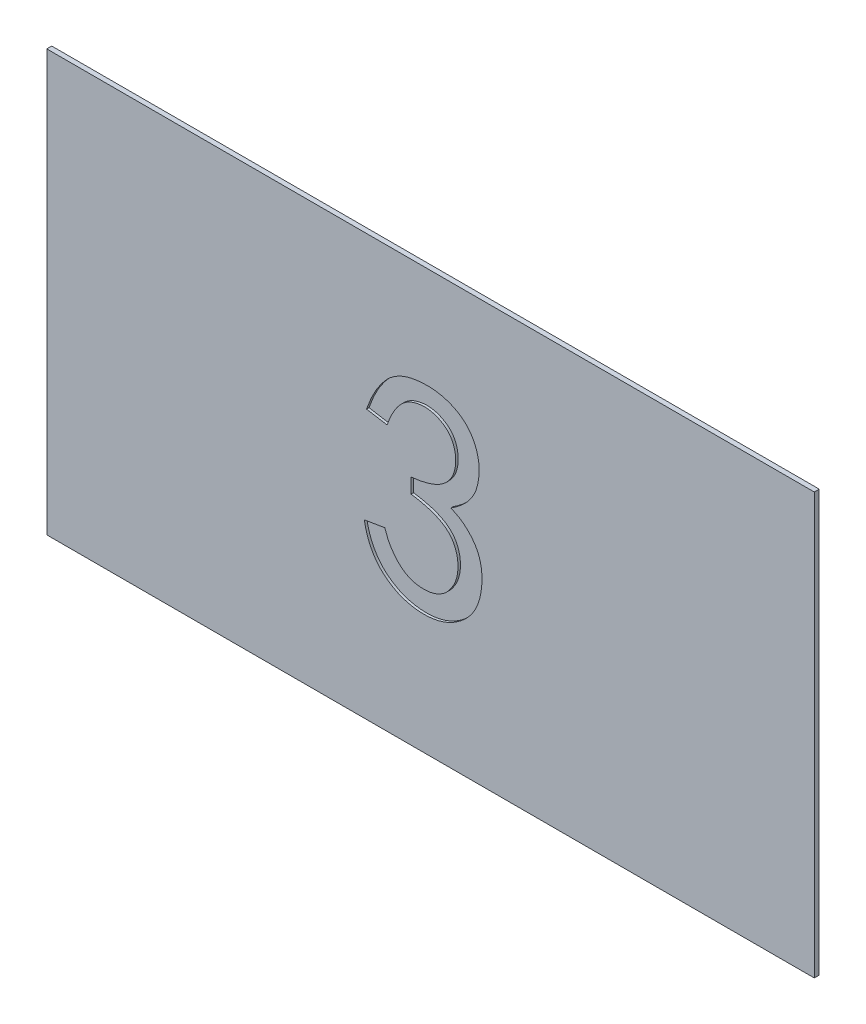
ISO-10303-21;
HEADER;
FILE_DESCRIPTION(('STEP AP214'),'2;1');
FILE_NAME('part.step','',(''),(''),'','','');
FILE_SCHEMA(('AUTOMOTIVE_DESIGN { 1 0 10303 214 1 1 1 1 }'));
ENDSEC;
DATA;
#1=APPLICATION_CONTEXT('core data for automotive mechanical design processes');
#2=APPLICATION_PROTOCOL_DEFINITION('international standard','automotive_design',2000,#1);
#3=PRODUCT_CONTEXT('',#1,'mechanical');
#4=PRODUCT('Part','Part','',(#3));
#5=PRODUCT_RELATED_PRODUCT_CATEGORY('part','',(#4));
#6=PRODUCT_DEFINITION_FORMATION('','',#4);
#7=PRODUCT_DEFINITION_CONTEXT('part definition',#1,'design');
#8=PRODUCT_DEFINITION('design','',#6,#7);
#9=PRODUCT_DEFINITION_SHAPE('','',#8);
#10=(LENGTH_UNIT() NAMED_UNIT(*) SI_UNIT(.MILLI.,.METRE.));
#11=(NAMED_UNIT(*) PLANE_ANGLE_UNIT() SI_UNIT($,.RADIAN.));
#12=(NAMED_UNIT(*) SI_UNIT($,.STERADIAN.) SOLID_ANGLE_UNIT());
#13=UNCERTAINTY_MEASURE_WITH_UNIT(LENGTH_MEASURE(1.E-05),#10,'distance_accuracy_value','');
#14=(GEOMETRIC_REPRESENTATION_CONTEXT(3) GLOBAL_UNCERTAINTY_ASSIGNED_CONTEXT((#13)) GLOBAL_UNIT_ASSIGNED_CONTEXT((#10,
#11,#12)) REPRESENTATION_CONTEXT('',''));
#15=CARTESIAN_POINT('',(0.,0.,0.));
#16=DIRECTION('',(0.,0.,1.));
#17=DIRECTION('',(1.,0.,0.));
#18=AXIS2_PLACEMENT_3D('',#15,#16,#17);
#19=CARTESIAN_POINT('',(0.991181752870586,-3.30692576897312,0.1));
#20=DIRECTION('',(0.,0.,1.));
#21=DIRECTION('',(0.,-1.,0.));
#22=AXIS2_PLACEMENT_3D('',#19,#20,#21);
#23=PLANE('',#22);
#24=CARTESIAN_POINT('',(-1.84665067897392,-1.42318815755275,0.0999999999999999));
#25=CARTESIAN_POINT('',(-1.84131235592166,-1.4389648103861,0.1));
#26=CARTESIAN_POINT('',(-1.83597390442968,-1.4547416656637,0.1));
#27=CARTESIAN_POINT('',(-1.82522817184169,-1.48627249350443,0.1));
#28=CARTESIAN_POINT('',(-1.8198208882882,-1.50202646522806,0.1));
#29=CARTESIAN_POINT('',(-1.80886116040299,-1.5335104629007,0.1));
#30=CARTESIAN_POINT('',(-1.803308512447,-1.54924041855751,0.1));
#31=CARTESIAN_POINT('',(-1.79199595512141,-1.58062694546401,0.1));
#32=CARTESIAN_POINT('',(-1.78623602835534,-1.59628351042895,0.1));
#33=CARTESIAN_POINT('',(-1.76981522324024,-1.63975196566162,0.1));
#34=CARTESIAN_POINT('',(-1.75885768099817,-1.66745430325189,0.0999999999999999));
#35=CARTESIAN_POINT('',(-1.73566598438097,-1.72232138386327,0.0999999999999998));
#36=CARTESIAN_POINT('',(-1.72343188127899,-1.74948614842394,0.0999999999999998));
#37=CARTESIAN_POINT('',(-1.69772730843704,-1.80323454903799,0.0999999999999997));
#38=CARTESIAN_POINT('',(-1.68425640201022,-1.82981797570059,0.0999999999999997));
#39=CARTESIAN_POINT('',(-1.65619960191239,-1.88239110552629,0.0999999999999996));
#40=CARTESIAN_POINT('',(-1.64161355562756,-1.908380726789,0.0999999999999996));
#41=CARTESIAN_POINT('',(-1.59630810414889,-1.98551066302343,0.0999999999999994));
#42=CARTESIAN_POINT('',(-1.56406465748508,-2.03576418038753,0.099999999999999));
#43=CARTESIAN_POINT('',(-1.49588492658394,-2.13369929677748,0.0999999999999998));
#44=CARTESIAN_POINT('',(-1.45994834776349,-2.18138069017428,0.100000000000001));
#45=CARTESIAN_POINT('',(-1.39600029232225,-2.25969549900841,0.1));
#46=CARTESIAN_POINT('',(-1.36891925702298,-2.29108903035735,0.0999999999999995));
#47=CARTESIAN_POINT('',(-1.31268834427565,-2.35195958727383,0.0999999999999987));
#48=CARTESIAN_POINT('',(-1.28353948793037,-2.38143754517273,0.0999999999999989));
#49=CARTESIAN_POINT('',(-1.2230549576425,-2.43783148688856,0.0999999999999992));
#50=CARTESIAN_POINT('',(-1.19172809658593,-2.46475686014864,0.0999999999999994));
#51=CARTESIAN_POINT('',(-1.143201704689,-2.50318593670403,0.0999999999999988));
#52=CARTESIAN_POINT('',(-1.12676844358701,-2.51567032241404,0.0999999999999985));
#53=CARTESIAN_POINT('',(-1.09340356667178,-2.53996701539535,0.0999999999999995));
#54=CARTESIAN_POINT('',(-1.07647181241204,-2.55177913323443,0.100000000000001));
#55=CARTESIAN_POINT('',(-1.04192090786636,-2.57486004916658,0.100000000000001));
#56=CARTESIAN_POINT('',(-1.02429566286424,-2.58611971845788,0.0999999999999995));
#57=CARTESIAN_POINT('',(-0.988562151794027,-2.60782886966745,0.0999999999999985));
#58=CARTESIAN_POINT('',(-0.97045414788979,-2.61827877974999,0.0999999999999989));
#59=CARTESIAN_POINT('',(-0.933639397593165,-2.63808821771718,0.0999999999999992));
#60=CARTESIAN_POINT('',(-0.914932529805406,-2.64744752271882,0.0999999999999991));
#61=CARTESIAN_POINT('',(-0.876935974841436,-2.6649124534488,0.099999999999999));
#62=CARTESIAN_POINT('',(-0.85764601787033,-2.67301748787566,0.099999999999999));
#63=CARTESIAN_POINT('',(-0.818703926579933,-2.68838242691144,0.0999999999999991));
#64=CARTESIAN_POINT('',(-0.799051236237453,-2.6956408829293,0.099999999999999));
#65=CARTESIAN_POINT('',(-0.759560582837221,-2.70963179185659,0.0999999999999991));
#66=CARTESIAN_POINT('',(-0.739722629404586,-2.71636427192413,0.0999999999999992));
#67=CARTESIAN_POINT('',(-0.69975860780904,-2.72896715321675,0.099999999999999));
#68=CARTESIAN_POINT('',(-0.679632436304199,-2.73483723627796,0.0999999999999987));
#69=CARTESIAN_POINT('',(-0.639056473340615,-2.74530214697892,0.0999999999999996));
#70=CARTESIAN_POINT('',(-0.61860680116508,-2.74989743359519,0.100000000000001));
#71=CARTESIAN_POINT('',(-0.575241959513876,-2.75842323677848,0.100000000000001));
#72=CARTESIAN_POINT('',(-0.552302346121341,-2.76222558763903,0.0999999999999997));
#73=CARTESIAN_POINT('',(-0.506281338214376,-2.7689143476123,0.0999999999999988));
#74=CARTESIAN_POINT('',(-0.483199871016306,-2.77180023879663,0.0999999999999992));
#75=CARTESIAN_POINT('',(-0.436933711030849,-2.77674255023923,0.0999999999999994));
#76=CARTESIAN_POINT('',(-0.413748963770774,-2.7787984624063,0.0999999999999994));
#77=CARTESIAN_POINT('',(-0.367326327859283,-2.78206396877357,0.0999999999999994));
#78=CARTESIAN_POINT('',(-0.344088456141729,-2.78327380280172,0.0999999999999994));
#79=CARTESIAN_POINT('',(-0.297537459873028,-2.78477772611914,0.0999999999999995));
#80=CARTESIAN_POINT('',(-0.274224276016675,-2.78507008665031,0.0999999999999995));
#81=CARTESIAN_POINT('',(-0.22760701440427,-2.78457109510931,0.0999999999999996));
#82=CARTESIAN_POINT('',(-0.20430293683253,-2.78377972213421,0.0999999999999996));
#83=CARTESIAN_POINT('',(-0.157779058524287,-2.78105901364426,0.0999999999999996));
#84=CARTESIAN_POINT('',(-0.134559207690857,-2.77913053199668,0.0999999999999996));
#85=CARTESIAN_POINT('',(-0.0882337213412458,-2.77421079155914,0.0999999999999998));
#86=CARTESIAN_POINT('',(-0.0651280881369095,-2.77121951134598,0.1));
#87=CARTESIAN_POINT('',(-0.00711243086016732,-2.76236810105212,0.1));
#88=CARTESIAN_POINT('',(0.0276957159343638,-2.75582486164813,0.1));
#89=CARTESIAN_POINT('',(0.0967576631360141,-2.74026128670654,0.0999999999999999));
#90=CARTESIAN_POINT('',(0.13101149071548,-2.73124107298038,0.1));
#91=CARTESIAN_POINT('',(0.198488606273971,-2.71034537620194,0.1));
#92=CARTESIAN_POINT('',(0.231715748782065,-2.69848256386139,0.100000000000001));
#93=CARTESIAN_POINT('',(0.296848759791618,-2.67154137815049,0.1));
#94=CARTESIAN_POINT('',(0.328754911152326,-2.65646369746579,0.0999999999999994));
#95=CARTESIAN_POINT('',(0.390853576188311,-2.62311336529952,0.0999999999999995));
#96=CARTESIAN_POINT('',(0.421045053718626,-2.60483880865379,0.1));
#97=CARTESIAN_POINT('',(0.465384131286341,-2.57600201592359,0.100000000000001));
#98=CARTESIAN_POINT('',(0.480010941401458,-2.56614842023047,0.100000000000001));
#99=CARTESIAN_POINT('',(0.508926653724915,-2.54595641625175,0.100000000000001));
#100=CARTESIAN_POINT('',(0.523215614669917,-2.53561809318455,0.100000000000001));
#101=CARTESIAN_POINT('',(0.551422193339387,-2.51428912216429,0.100000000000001));
#102=CARTESIAN_POINT('',(0.565337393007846,-2.50329525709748,0.100000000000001));
#103=CARTESIAN_POINT('',(0.592602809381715,-2.48062888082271,0.100000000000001));
#104=CARTESIAN_POINT('',(0.605953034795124,-2.46895638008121,0.100000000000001));
#105=CARTESIAN_POINT('',(0.645130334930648,-2.43302626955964,0.100000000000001));
#106=CARTESIAN_POINT('',(0.67010950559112,-2.40783678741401,0.0999999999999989));
#107=CARTESIAN_POINT('',(0.725125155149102,-2.34754162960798,0.0999999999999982));
#108=CARTESIAN_POINT('',(0.754395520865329,-2.31174671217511,0.100000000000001));
#109=CARTESIAN_POINT('',(0.810159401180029,-2.23800249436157,0.100000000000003));
#110=CARTESIAN_POINT('',(0.836648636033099,-2.20005000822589,0.100000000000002));
#111=CARTESIAN_POINT('',(0.886493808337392,-2.12218439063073,0.100000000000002));
#112=CARTESIAN_POINT('',(0.909853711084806,-2.08227382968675,0.100000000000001));
#113=CARTESIAN_POINT('',(0.942235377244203,-2.02104142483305,0.100000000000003));
#114=CARTESIAN_POINT('',(0.952582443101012,-2.00041182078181,0.100000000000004));
#115=CARTESIAN_POINT('',(0.972305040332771,-1.95869586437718,0.100000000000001));
#116=CARTESIAN_POINT('',(0.98168082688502,-1.93760963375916,0.0999999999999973));
#117=CARTESIAN_POINT('',(0.999087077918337,-1.89552453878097,0.0999999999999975));
#118=CARTESIAN_POINT('',(1.00714601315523,-1.87453745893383,0.100000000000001));
#119=CARTESIAN_POINT('',(1.02225953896,-1.83220100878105,0.100000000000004));
#120=CARTESIAN_POINT('',(1.02931383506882,-1.81085153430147,0.100000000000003));
#121=CARTESIAN_POINT('',(1.04262858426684,-1.76789918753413,0.100000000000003));
#122=CARTESIAN_POINT('',(1.04888871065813,-1.74629621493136,0.100000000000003));
#123=CARTESIAN_POINT('',(1.06059901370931,-1.70287253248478,0.100000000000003));
#124=CARTESIAN_POINT('',(1.06604930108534,-1.6810518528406,0.100000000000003));
#125=CARTESIAN_POINT('',(1.07589078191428,-1.63715634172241,0.100000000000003));
#126=CARTESIAN_POINT('',(1.08028135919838,-1.61508137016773,0.100000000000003));
#127=CARTESIAN_POINT('',(1.08794713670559,-1.57073438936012,0.100000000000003));
#128=CARTESIAN_POINT('',(1.09122201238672,-1.5484623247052,0.100000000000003));
#129=CARTESIAN_POINT('',(1.09690841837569,-1.50380422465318,0.100000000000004));
#130=CARTESIAN_POINT('',(1.09931965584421,-1.48141815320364,0.100000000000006));
#131=CARTESIAN_POINT('',(1.10341031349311,-1.43658204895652,0.100000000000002));
#132=CARTESIAN_POINT('',(1.10508983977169,-1.41413202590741,0.0999999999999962));
#133=CARTESIAN_POINT('',(1.10754526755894,-1.36929113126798,0.0999999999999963));
#134=CARTESIAN_POINT('',(1.10832559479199,-1.34690051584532,0.100000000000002));
#135=CARTESIAN_POINT('',(1.10886825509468,-1.30211832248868,0.100000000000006));
#136=CARTESIAN_POINT('',(1.10863109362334,-1.2797267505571,0.100000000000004));
#137=CARTESIAN_POINT('',(1.10730562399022,-1.2349742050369,0.100000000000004));
#138=CARTESIAN_POINT('',(1.1062173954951,-1.21261322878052,0.100000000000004));
#139=CARTESIAN_POINT('',(1.10340920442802,-1.16792471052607,0.100000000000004));
#140=CARTESIAN_POINT('',(1.10168904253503,-1.14559718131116,0.100000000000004));
#141=CARTESIAN_POINT('',(1.09749907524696,-1.1010084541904,0.100000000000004));
#142=CARTESIAN_POINT('',(1.09502923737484,-1.07874725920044,0.100000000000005));
#143=CARTESIAN_POINT('',(1.08905156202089,-1.03436873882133,0.100000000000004));
#144=CARTESIAN_POINT('',(1.08554407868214,-1.01225136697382,0.100000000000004));
#145=CARTESIAN_POINT('',(1.07740894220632,-0.968218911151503,0.100000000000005));
#146=CARTESIAN_POINT('',(1.07278101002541,-0.946303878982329,0.100000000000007));
#147=CARTESIAN_POINT('',(1.06254979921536,-0.902699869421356,0.100000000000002));
#148=CARTESIAN_POINT('',(1.05694632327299,-0.881010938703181,0.0999999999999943));
#149=CARTESIAN_POINT('',(1.04600551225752,-0.842040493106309,0.0999999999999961));
#150=CARTESIAN_POINT('',(1.04082484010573,-0.824714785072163,0.100000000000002));
#151=CARTESIAN_POINT('',(1.02987777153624,-0.790249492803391,0.100000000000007));
#152=CARTESIAN_POINT('',(1.02411137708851,-0.773109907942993,0.100000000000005));
#153=CARTESIAN_POINT('',(1.01202343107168,-0.739041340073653,0.100000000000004));
#154=CARTESIAN_POINT('',(1.0057022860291,-0.722112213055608,0.100000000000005));
#155=CARTESIAN_POINT('',(0.992399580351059,-0.688516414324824,0.100000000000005));
#156=CARTESIAN_POINT('',(0.985418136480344,-0.671849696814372,0.100000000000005));
#157=CARTESIAN_POINT('',(0.970649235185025,-0.63891940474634,0.100000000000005));
#158=CARTESIAN_POINT('',(0.962863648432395,-0.62265499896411,0.100000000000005));
#159=CARTESIAN_POINT('',(0.946399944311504,-0.59058331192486,0.100000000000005));
#160=CARTESIAN_POINT('',(0.937721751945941,-0.574776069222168,0.100000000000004));
#161=CARTESIAN_POINT('',(0.919625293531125,-0.543580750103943,0.100000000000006));
#162=CARTESIAN_POINT('',(0.910206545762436,-0.528192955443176,0.100000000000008));
#163=CARTESIAN_POINT('',(0.890767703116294,-0.497801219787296,0.100000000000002));
#164=CARTESIAN_POINT('',(0.880747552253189,-0.482797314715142,0.0999999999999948));
#165=CARTESIAN_POINT('',(0.860081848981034,-0.453141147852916,0.0999999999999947));
#166=CARTESIAN_POINT('',(0.849434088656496,-0.438490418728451,0.100000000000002));
#167=CARTESIAN_POINT('',(0.827515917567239,-0.409666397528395,0.100000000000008));
#168=CARTESIAN_POINT('',(0.816245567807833,-0.395493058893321,0.100000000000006));
#169=CARTESIAN_POINT('',(0.781505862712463,-0.35377666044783,0.100000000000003));
#170=CARTESIAN_POINT('',(0.757087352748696,-0.327007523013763,0.100000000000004));
#171=CARTESIAN_POINT('',(0.705716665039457,-0.275966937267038,0.100000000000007));
#172=CARTESIAN_POINT('',(0.678761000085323,-0.251699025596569,0.100000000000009));
#173=CARTESIAN_POINT('',(0.623024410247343,-0.205346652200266,0.100000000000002));
#174=CARTESIAN_POINT('',(0.594242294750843,-0.183263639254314,0.0999999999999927));
#175=CARTESIAN_POINT('',(0.543601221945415,-0.147096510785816,0.0999999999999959));
#176=CARTESIAN_POINT('',(0.522091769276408,-0.132519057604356,0.100000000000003));
#177=CARTESIAN_POINT('',(0.478388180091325,-0.104432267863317,0.100000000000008));
#178=CARTESIAN_POINT('',(0.45619411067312,-0.0909228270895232,0.100000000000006));
#179=CARTESIAN_POINT('',(0.411161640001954,-0.0650043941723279,0.100000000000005));
#180=CARTESIAN_POINT('',(0.38832301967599,-0.0525957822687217,0.100000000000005));
#181=CARTESIAN_POINT('',(0.342058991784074,-0.0289226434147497,0.100000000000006));
#182=CARTESIAN_POINT('',(0.318633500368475,-0.0176582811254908,0.100000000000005));
#183=CARTESIAN_POINT('',(0.271250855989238,0.00409151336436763,0.100000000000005));
#184=CARTESIAN_POINT('',(0.24729128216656,0.0145715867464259,0.100000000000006));
#185=CARTESIAN_POINT('',(0.199155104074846,0.0350189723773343,0.100000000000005));
#186=CARTESIAN_POINT('',(0.174978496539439,0.0449862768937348,0.100000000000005));
#187=CARTESIAN_POINT('',(0.126374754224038,0.0642928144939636,0.100000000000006));
#188=CARTESIAN_POINT('',(0.101947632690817,0.0736320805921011,0.100000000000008));
#189=CARTESIAN_POINT('',(0.0527898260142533,0.0914648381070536,0.100000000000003));
#190=CARTESIAN_POINT('',(0.0280591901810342,0.0999584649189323,0.0999999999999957));
#191=CARTESIAN_POINT('',(-0.0292431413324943,0.118620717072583,0.0999999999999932));
#192=CARTESIAN_POINT('',(-0.0619051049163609,0.128509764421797,0.100000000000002));
#193=CARTESIAN_POINT('',(-0.127475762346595,0.147452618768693,0.100000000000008));
#194=CARTESIAN_POINT('',(-0.160384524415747,0.156506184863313,0.100000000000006));
#195=CARTESIAN_POINT('',(-0.226400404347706,0.173923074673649,0.100000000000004));
#196=CARTESIAN_POINT('',(-0.259507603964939,0.182286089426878,0.100000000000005));
#197=CARTESIAN_POINT('',(-0.325895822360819,0.19826177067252,0.100000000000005));
#198=CARTESIAN_POINT('',(-0.359176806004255,0.205874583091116,0.100000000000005));
#199=CARTESIAN_POINT('',(-0.425138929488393,0.220187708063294,0.100000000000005));
#200=CARTESIAN_POINT('',(-0.457816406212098,0.226904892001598,0.100000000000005));
#201=CARTESIAN_POINT('',(-0.523322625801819,0.239583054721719,0.100000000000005));
#202=CARTESIAN_POINT('',(-0.556151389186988,0.245543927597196,0.100000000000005));
#203=CARTESIAN_POINT('',(-0.621871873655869,0.256801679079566,0.100000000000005));
#204=CARTESIAN_POINT('',(-0.654763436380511,0.262099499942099,0.100000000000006));
#205=CARTESIAN_POINT('',(-0.720587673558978,0.272379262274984,0.100000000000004));
#206=CARTESIAN_POINT('',(-0.753520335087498,0.277361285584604,0.100000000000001));
#207=CARTESIAN_POINT('',(-0.786447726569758,0.282355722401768,0.0999999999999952));
#208=B_SPLINE_CURVE_WITH_KNOTS('',3,(#24,#25,#26,#27,#28,#29,#30,#31,#32,#33,#34,#35,#36,#37,
#38,#39,#40,#41,#42,#43,#44,#45,#46,#47,#48,#49,#50,#51,#52,#53,#54,#55,#56,#57,#58,#59,#60,#61,
#62,#63,#64,#65,#66,#67,#68,#69,#70,#71,#72,#73,#74,#75,#76,#77,#78,#79,#80,#81,#82,#83,#84,#85,
#86,#87,#88,#89,#90,#91,#92,#93,#94,#95,#96,#97,#98,#99,#100,#101,#102,#103,#104,#105,#106,#107,
#108,#109,#110,#111,#112,#113,#114,#115,#116,#117,#118,#119,#120,#121,#122,#123,#124,#125,#126,
#127,#128,#129,#130,#131,#132,#133,#134,#135,#136,#137,#138,#139,#140,#141,#142,#143,#144,#145,
#146,#147,#148,#149,#150,#151,#152,#153,#154,#155,#156,#157,#158,#159,#160,#161,#162,#163,#164,
#165,#166,#167,#168,#169,#170,#171,#172,#173,#174,#175,#176,#177,#178,#179,#180,#181,#182,#183,
#184,#185,#186,#187,#188,#189,#190,#191,#192,#193,#194,#195,#196,#197,#198,#199,#200,#201,#202,
#203,#204,#205,#206,#207),.UNSPECIFIED.,.F.,.F.,(4,2,2,2,2,2,2,2,2,2,2,2,2,2,2,2,2,2,2,2,2,2,2,
2,2,2,2,2,2,2,2,2,2,2,2,2,2,2,2,2,2,2,2,2,2,2,2,2,2,2,2,2,2,2,2,2,2,2,2,2,2,2,2,2,2,2,2,2,2,2,2,
2,2,2,2,2,2,2,2,2,2,2,2,2,2,2,2,2,2,2,2,4),(0.,0.0499664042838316,0.0999345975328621,
0.149976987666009,0.200023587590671,0.289370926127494,0.378714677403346,0.468090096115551,
0.557477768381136,0.73641233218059,0.915361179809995,1.03967190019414,1.16392165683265,
1.28769503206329,1.34959453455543,1.41151139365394,1.47423821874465,1.53693164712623,
1.59963786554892,1.66237355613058,1.72521506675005,1.78805333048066,1.85091471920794,
1.91375344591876,1.98348333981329,2.05325257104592,2.12306444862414,2.19285652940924,
2.26278003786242,2.33270489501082,2.40257731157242,2.47245113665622,2.57861584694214,
2.68477533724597,2.79047015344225,2.89614221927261,3.00187747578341,3.05478355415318,
3.10768036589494,3.16086243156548,3.21404367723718,3.32031076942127,3.45883117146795,
3.59756170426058,3.73611474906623,3.80533310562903,3.87453323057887,3.94194780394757,
4.00938209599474,4.07684403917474,4.14429675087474,4.21178858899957,4.27930004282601,
4.34683436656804,4.41435889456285,4.48154963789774,4.54870700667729,4.61585808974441,
4.68303037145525,4.75020556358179,4.81735785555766,4.88452688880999,4.95170952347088,
5.00595057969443,5.06019145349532,5.11439290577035,5.16858479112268,5.22265333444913,
5.27672642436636,5.33083498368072,5.38494858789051,5.43926546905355,5.49357703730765,
5.60209228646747,5.71075892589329,5.81949714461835,5.89742038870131,5.97533601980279,
6.0532784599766,6.13123210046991,6.20967722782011,6.28812353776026,6.36656572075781,
6.44499532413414,6.54735340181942,6.64974090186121,6.75217396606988,6.8545870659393,
6.95466082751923,7.05474858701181,7.15469245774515,7.25461032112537),.UNSPECIFIED.);
#209=CARTESIAN_POINT('',(-1.84665067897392,-1.42318815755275,0.1));
#210=VERTEX_POINT('',#209);
#211=CARTESIAN_POINT('',(-0.786447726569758,0.282355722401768,0.0999999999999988));
#212=VERTEX_POINT('',#211);
#213=EDGE_CURVE('E144',#210,#212,#208,.T.);
#214=ORIENTED_EDGE('',*,*,#213,.F.);
#215=DIRECTION('',(0.986393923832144,0.164398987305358,0.));
#216=VECTOR('',#215,1.);
#217=CARTESIAN_POINT('',(-2.67637472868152,-1.56147549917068,0.1));
#218=LINE('',#217,#216);
#219=CARTESIAN_POINT('',(-2.67637472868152,-1.56147549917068,0.1));
#220=VERTEX_POINT('',#219);
#221=EDGE_CURVE('E148',#220,#210,#218,.T.);
#222=ORIENTED_EDGE('',*,*,#221,.F.);
#223=CARTESIAN_POINT('',(0.826904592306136,0.605026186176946,0.0999999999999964));
#224=CARTESIAN_POINT('',(0.841956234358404,0.597902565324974,0.100000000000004));
#225=CARTESIAN_POINT('',(0.857008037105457,0.590778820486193,0.100000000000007));
#226=CARTESIAN_POINT('',(0.887081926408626,0.576473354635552,0.100000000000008));
#227=CARTESIAN_POINT('',(0.902104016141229,0.569291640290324,0.100000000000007));
#228=CARTESIAN_POINT('',(0.932121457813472,0.554796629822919,0.100000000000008));
#229=CARTESIAN_POINT('',(0.947116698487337,0.547483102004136,0.10000000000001));
#230=CARTESIAN_POINT('',(0.977022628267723,0.532677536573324,0.100000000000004));
#231=CARTESIAN_POINT('',(0.991933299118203,0.525185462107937,0.0999999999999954));
#232=CARTESIAN_POINT('',(1.03269178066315,0.504306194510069,0.0999999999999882));
#233=CARTESIAN_POINT('',(1.05841972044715,0.49068180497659,0.100000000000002));
#234=CARTESIAN_POINT('',(1.10930421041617,0.462401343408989,0.100000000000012));
#235=CARTESIAN_POINT('',(1.13446080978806,0.447745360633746,0.100000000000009));
#236=CARTESIAN_POINT('',(1.18405121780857,0.417253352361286,0.100000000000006));
#237=CARTESIAN_POINT('',(1.20848499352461,0.401417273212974,0.100000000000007));
#238=CARTESIAN_POINT('',(1.25662267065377,0.368670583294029,0.100000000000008));
#239=CARTESIAN_POINT('',(1.28032646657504,0.351759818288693,0.100000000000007));
#240=CARTESIAN_POINT('',(1.35034910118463,0.299475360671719,0.100000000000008));
#241=CARTESIAN_POINT('',(1.39553963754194,0.262574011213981,0.100000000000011));
#242=CARTESIAN_POINT('',(1.48267363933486,0.185113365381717,0.100000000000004));
#243=CARTESIAN_POINT('',(1.524616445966,0.144553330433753,0.0999999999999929));
#244=CARTESIAN_POINT('',(1.6049982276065,0.0598058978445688,0.0999999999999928));
#245=CARTESIAN_POINT('',(1.64342363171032,0.0156056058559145,0.100000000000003));
#246=CARTESIAN_POINT('',(1.71632189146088,-0.0759730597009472,0.100000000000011));
#247=CARTESIAN_POINT('',(1.75079329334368,-0.123352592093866,0.100000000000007));
#248=CARTESIAN_POINT('',(1.79941021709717,-0.196390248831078,0.100000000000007));
#249=CARTESIAN_POINT('',(1.81508928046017,-0.221043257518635,0.100000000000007));
#250=CARTESIAN_POINT('',(1.84534033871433,-0.271007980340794,0.100000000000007));
#251=CARTESIAN_POINT('',(1.85991297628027,-0.296319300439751,0.100000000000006));
#252=CARTESIAN_POINT('',(1.88748640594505,-0.347751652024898,0.100000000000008));
#253=CARTESIAN_POINT('',(1.90048913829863,-0.373871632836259,0.10000000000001));
#254=CARTESIAN_POINT('',(1.9247617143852,-0.42690743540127,0.100000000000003));
#255=CARTESIAN_POINT('',(1.93603128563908,-0.453823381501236,0.0999999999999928));
#256=CARTESIAN_POINT('',(1.955624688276,-0.504572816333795,0.0999999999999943));
#257=CARTESIAN_POINT('',(1.96414083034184,-0.528332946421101,0.100000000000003));
#258=CARTESIAN_POINT('',(1.98010242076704,-0.576207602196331,0.10000000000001));
#259=CARTESIAN_POINT('',(1.98754795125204,-0.600322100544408,0.100000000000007));
#260=CARTESIAN_POINT('',(2.00145064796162,-0.648866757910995,0.100000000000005));
#261=CARTESIAN_POINT('',(2.00790651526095,-0.673297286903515,0.100000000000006));
#262=CARTESIAN_POINT('',(2.01989376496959,-0.722388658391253,0.100000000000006));
#263=CARTESIAN_POINT('',(2.0254249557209,-0.747049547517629,0.100000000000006));
#264=CARTESIAN_POINT('',(2.035611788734,-0.79657302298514,0.100000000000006));
#265=CARTESIAN_POINT('',(2.04026666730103,-0.821435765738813,0.100000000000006));
#266=CARTESIAN_POINT('',(2.04875555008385,-0.87130283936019,0.100000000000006));
#267=CARTESIAN_POINT('',(2.05258948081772,-0.89630718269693,0.100000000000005));
#268=CARTESIAN_POINT('',(2.059420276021,-0.946428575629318,0.100000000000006));
#269=CARTESIAN_POINT('',(2.06241720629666,-0.971545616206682,0.100000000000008));
#270=CARTESIAN_POINT('',(2.06751988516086,-1.02186797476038,0.100000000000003));
#271=CARTESIAN_POINT('',(2.06962570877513,-1.0470732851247,0.0999999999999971));
#272=CARTESIAN_POINT('',(2.07493103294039,-1.1275191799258,0.0999999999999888));
#273=CARTESIAN_POINT('',(2.07645815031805,-1.18287113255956,0.100000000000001));
#274=CARTESIAN_POINT('',(2.07667516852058,-1.26584107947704,0.100000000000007));
#275=CARTESIAN_POINT('',(2.07640266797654,-1.29347180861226,0.100000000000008));
#276=CARTESIAN_POINT('',(2.0751593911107,-1.3487165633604,0.100000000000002));
#277=CARTESIAN_POINT('',(2.07418870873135,-1.37633059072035,0.0999999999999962));
#278=CARTESIAN_POINT('',(2.07099670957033,-1.44188483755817,0.0999999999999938));
#279=CARTESIAN_POINT('',(2.06844265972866,-1.47980923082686,0.100000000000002));
#280=CARTESIAN_POINT('',(2.06194844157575,-1.55554595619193,0.100000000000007));
#281=CARTESIAN_POINT('',(2.05800794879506,-1.59335825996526,0.100000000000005));
#282=CARTESIAN_POINT('',(2.04895217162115,-1.66889868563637,0.100000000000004));
#283=CARTESIAN_POINT('',(2.04383511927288,-1.7066265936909,0.100000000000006));
#284=CARTESIAN_POINT('',(2.0322210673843,-1.78186978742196,0.100000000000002));
#285=CARTESIAN_POINT('',(2.02572431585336,-1.81938511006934,0.0999999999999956));
#286=CARTESIAN_POINT('',(2.01197586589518,-1.88817707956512,0.0999999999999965));
#287=CARTESIAN_POINT('',(2.00500268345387,-1.91950877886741,0.100000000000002));
#288=CARTESIAN_POINT('',(1.98965712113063,-1.98183174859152,0.100000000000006));
#289=CARTESIAN_POINT('',(1.98128450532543,-2.01282296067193,0.100000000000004));
#290=CARTESIAN_POINT('',(1.96329678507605,-2.07446445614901,0.100000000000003));
#291=CARTESIAN_POINT('',(1.95368081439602,-2.10511448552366,0.100000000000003));
#292=CARTESIAN_POINT('',(1.93325550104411,-2.16601320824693,0.100000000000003));
#293=CARTESIAN_POINT('',(1.92244622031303,-2.19626192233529,0.100000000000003));
#294=CARTESIAN_POINT('',(1.89955549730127,-2.25622059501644,0.100000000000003));
#295=CARTESIAN_POINT('',(1.88747616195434,-2.28593135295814,0.100000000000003));
#296=CARTESIAN_POINT('',(1.86197667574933,-2.34476819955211,0.100000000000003));
#297=CARTESIAN_POINT('',(1.84855652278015,-2.37389428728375,0.100000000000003));
#298=CARTESIAN_POINT('',(1.80625289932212,-2.46022139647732,0.100000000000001));
#299=CARTESIAN_POINT('',(1.77530111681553,-2.51643799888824,0.0999999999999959));
#300=CARTESIAN_POINT('',(1.72567780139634,-2.59674996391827,0.0999999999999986));
#301=CARTESIAN_POINT('',(1.70911878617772,-2.62217623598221,0.100000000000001));
#302=CARTESIAN_POINT('',(1.6747817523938,-2.67219450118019,0.100000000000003));
#303=CARTESIAN_POINT('',(1.65700377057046,-2.69678651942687,0.100000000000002));
#304=CARTESIAN_POINT('',(1.62037711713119,-2.74517004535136,0.100000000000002));
#305=CARTESIAN_POINT('',(1.60152801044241,-2.76896122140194,0.100000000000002));
#306=CARTESIAN_POINT('',(1.56299111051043,-2.8158587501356,0.100000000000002));
#307=CARTESIAN_POINT('',(1.54330316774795,-2.83896497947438,0.100000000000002));
#308=CARTESIAN_POINT('',(1.50306071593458,-2.88455794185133,0.100000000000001));
#309=CARTESIAN_POINT('',(1.48250339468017,-2.90704220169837,0.100000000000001));
#310=CARTESIAN_POINT('',(1.44044349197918,-2.95109910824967,0.100000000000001));
#311=CARTESIAN_POINT('',(1.41894121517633,-2.9726720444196,0.100000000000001));
#312=CARTESIAN_POINT('',(1.35293831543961,-3.03580171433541,0.100000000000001));
#313=CARTESIAN_POINT('',(1.30692842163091,-3.07578459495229,0.0999999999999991));
#314=CARTESIAN_POINT('',(1.23600722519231,-3.13355070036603,0.0999999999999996));
#315=CARTESIAN_POINT('',(1.21199347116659,-3.15247770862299,0.1));
#316=CARTESIAN_POINT('',(1.16336208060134,-3.18953990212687,0.100000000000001));
#317=CARTESIAN_POINT('',(1.13874454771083,-3.20767522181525,0.1));
#318=CARTESIAN_POINT('',(1.08885853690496,-3.24304602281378,0.1));
#319=CARTESIAN_POINT('',(1.0635898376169,-3.26028119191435,0.1));
#320=CARTESIAN_POINT('',(1.01241635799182,-3.29378311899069,0.1));
#321=CARTESIAN_POINT('',(0.986511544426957,-3.31004982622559,0.1));
#322=CARTESIAN_POINT('',(0.934201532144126,-3.34156325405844,0.0999999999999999));
#323=CARTESIAN_POINT('',(0.907798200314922,-3.35681307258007,0.0999999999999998));
#324=CARTESIAN_POINT('',(0.854454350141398,-3.38633851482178,0.0999999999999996));
#325=CARTESIAN_POINT('',(0.827513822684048,-3.40061412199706,0.0999999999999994));
#326=CARTESIAN_POINT('',(0.745914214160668,-3.44184722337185,0.0999999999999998));
#327=CARTESIAN_POINT('',(0.690441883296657,-3.46723236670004,0.100000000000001));
#328=CARTESIAN_POINT('',(0.602197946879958,-3.50324768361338,0.1));
#329=CARTESIAN_POINT('',(0.57007270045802,-3.51548575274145,0.0999999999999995));
#330=CARTESIAN_POINT('',(0.505278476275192,-3.53840649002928,0.0999999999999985));
#331=CARTESIAN_POINT('',(0.47260958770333,-3.54908941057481,0.0999999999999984));
#332=CARTESIAN_POINT('',(0.373862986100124,-3.57884522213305,0.0999999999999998));
#333=CARTESIAN_POINT('',(0.307074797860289,-3.59561319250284,0.100000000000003));
#334=CARTESIAN_POINT('',(0.206357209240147,-3.61641786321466,0.100000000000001));
#335=CARTESIAN_POINT('',(0.172847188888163,-3.62260998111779,0.099999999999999));
#336=CARTESIAN_POINT('',(0.105606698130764,-3.63366744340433,0.0999999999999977));
#337=CARTESIAN_POINT('',(0.0718762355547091,-3.63853283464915,0.0999999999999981));
#338=CARTESIAN_POINT('',(0.00422907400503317,-3.64689228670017,0.0999999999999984));
#339=CARTESIAN_POINT('',(-0.0296877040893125,-3.6503857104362,0.0999999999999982));
#340=CARTESIAN_POINT('',(-0.0976436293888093,-3.65583058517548,0.099999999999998));
#341=CARTESIAN_POINT('',(-0.13168276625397,-3.65778216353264,0.099999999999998));
#342=CARTESIAN_POINT('',(-0.199840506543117,-3.66020069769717,0.0999999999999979));
#343=CARTESIAN_POINT('',(-0.233959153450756,-3.66066635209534,0.0999999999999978));
#344=CARTESIAN_POINT('',(-0.302194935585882,-3.66037262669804,0.0999999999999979));
#345=CARTESIAN_POINT('',(-0.336312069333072,-3.65961301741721,0.0999999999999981));
#346=CARTESIAN_POINT('',(-0.40449058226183,-3.65690898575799,0.0999999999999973));
#347=CARTESIAN_POINT('',(-0.438551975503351,-3.65496493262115,0.0999999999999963));
#348=CARTESIAN_POINT('',(-0.506557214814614,-3.64964859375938,0.0999999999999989));
#349=CARTESIAN_POINT('',(-0.540501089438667,-3.64627668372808,0.100000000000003));
#350=CARTESIAN_POINT('',(-0.609010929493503,-3.63797248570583,0.100000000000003));
#351=CARTESIAN_POINT('',(-0.64357257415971,-3.63300511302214,0.0999999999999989));
#352=CARTESIAN_POINT('',(-0.712509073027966,-3.62195063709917,0.099999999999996));
#353=CARTESIAN_POINT('',(-0.746883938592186,-3.6158636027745,0.0999999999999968));
#354=CARTESIAN_POINT('',(-0.815399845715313,-3.60265204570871,0.0999999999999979));
#355=CARTESIAN_POINT('',(-0.849541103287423,-3.59552867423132,0.0999999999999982));
#356=CARTESIAN_POINT('',(-0.900482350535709,-3.58366634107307,0.0999999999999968));
#357=CARTESIAN_POINT('',(-0.917418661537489,-3.57951573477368,0.099999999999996));
#358=CARTESIAN_POINT('',(-0.951174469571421,-3.57076431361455,0.0999999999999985));
#359=CARTESIAN_POINT('',(-0.967993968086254,-3.56616350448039,0.100000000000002));
#360=CARTESIAN_POINT('',(-1.01616238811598,-3.55231263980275,0.100000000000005));
#361=CARTESIAN_POINT('',(-1.0473543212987,-3.54251534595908,0.0999999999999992));
#362=CARTESIAN_POINT('',(-1.10935264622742,-3.52175145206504,0.0999999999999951));
#363=CARTESIAN_POINT('',(-1.14015889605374,-3.51078443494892,0.0999999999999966));
#364=CARTESIAN_POINT('',(-1.20140696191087,-3.48781966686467,0.0999999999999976));
#365=CARTESIAN_POINT('',(-1.23184856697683,-3.47582134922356,0.0999999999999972));
#366=CARTESIAN_POINT('',(-1.2921481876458,-3.4504576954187,0.0999999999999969));
#367=CARTESIAN_POINT('',(-1.32200644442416,-3.43709293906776,0.099999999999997));
#368=CARTESIAN_POINT('',(-1.38108898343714,-3.40881927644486,0.099999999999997));
#369=CARTESIAN_POINT('',(-1.41031113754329,-3.3939059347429,0.099999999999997));
#370=CARTESIAN_POINT('',(-1.46812198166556,-3.36288447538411,0.0999999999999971));
#371=CARTESIAN_POINT('',(-1.49671043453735,-3.34677591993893,0.0999999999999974));
#372=CARTESIAN_POINT('',(-1.55330157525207,-3.3135643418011,0.0999999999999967));
#373=CARTESIAN_POINT('',(-1.58130430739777,-3.29646139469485,0.0999999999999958));
#374=CARTESIAN_POINT('',(-1.63663268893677,-3.26120664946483,0.0999999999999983));
#375=CARTESIAN_POINT('',(-1.66395846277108,-3.243055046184,0.100000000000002));
#376=CARTESIAN_POINT('',(-1.74685259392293,-3.1855631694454,0.100000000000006));
#377=CARTESIAN_POINT('',(-1.80119611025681,-3.14442577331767,0.0999999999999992));
#378=CARTESIAN_POINT('',(-1.90584079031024,-3.05725465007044,0.0999999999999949));
#379=CARTESIAN_POINT('',(-1.95614155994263,-3.01122044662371,0.0999999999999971));
#380=CARTESIAN_POINT('',(-2.05170948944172,-2.91455700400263,0.0999999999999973));
#381=CARTESIAN_POINT('',(-2.09699409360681,-2.86394487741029,0.0999999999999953));
#382=CARTESIAN_POINT('',(-2.18307114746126,-2.7590683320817,0.0999999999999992));
#383=CARTESIAN_POINT('',(-2.22386777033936,-2.70480738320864,0.100000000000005));
#384=CARTESIAN_POINT('',(-2.27797311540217,-2.62345006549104,0.100000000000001));
#385=CARTESIAN_POINT('',(-2.29391272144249,-2.59809958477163,0.0999999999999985));
#386=CARTESIAN_POINT('',(-2.32471322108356,-2.54675475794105,0.0999999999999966));
#387=CARTESIAN_POINT('',(-2.33957400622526,-2.52076034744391,0.0999999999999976));
#388=CARTESIAN_POINT('',(-2.36856537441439,-2.46833808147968,0.0999999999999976));
#389=CARTESIAN_POINT('',(-2.38269524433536,-2.44190983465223,0.0999999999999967));
#390=CARTESIAN_POINT('',(-2.41025185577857,-2.38869475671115,0.0999999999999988));
#391=CARTESIAN_POINT('',(-2.4236787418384,-2.36190800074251,0.100000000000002));
#392=CARTESIAN_POINT('',(-2.45124578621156,-2.30432209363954,0.100000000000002));
#393=CARTESIAN_POINT('',(-2.46524924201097,-2.27345670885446,0.0999999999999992));
#394=CARTESIAN_POINT('',(-2.49175435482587,-2.21108130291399,0.0999999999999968));
#395=CARTESIAN_POINT('',(-2.50425568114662,-2.179571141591,0.0999999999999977));
#396=CARTESIAN_POINT('',(-2.52809707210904,-2.11608669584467,0.0999999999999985));
#397=CARTESIAN_POINT('',(-2.53943600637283,-2.08411199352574,0.0999999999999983));
#398=CARTESIAN_POINT('',(-2.56128987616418,-2.01988608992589,0.0999999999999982));
#399=CARTESIAN_POINT('',(-2.57180487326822,-1.98763490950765,0.0999999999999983));
#400=CARTESIAN_POINT('',(-2.59181976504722,-1.92293229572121,0.0999999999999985));
#401=CARTESIAN_POINT('',(-2.60132290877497,-1.8904818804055,0.0999999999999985));
#402=CARTESIAN_POINT('',(-2.61465877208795,-1.8415552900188,0.0999999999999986));
#403=CARTESIAN_POINT('',(-2.61895106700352,-1.82520395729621,0.0999999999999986));
#404=CARTESIAN_POINT('',(-2.62719966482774,-1.79241667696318,0.0999999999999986));
#405=CARTESIAN_POINT('',(-2.63115596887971,-1.77598072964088,0.0999999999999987));
#406=CARTESIAN_POINT('',(-2.64259777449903,-1.72666390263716,0.0999999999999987));
#407=CARTESIAN_POINT('',(-2.64967843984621,-1.69369062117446,0.0999999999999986));
#408=CARTESIAN_POINT('',(-2.66329786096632,-1.62763331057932,0.0999999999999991));
#409=CARTESIAN_POINT('',(-2.6698366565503,-1.59454928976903,0.0999999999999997));
#410=CARTESIAN_POINT('',(-2.67637472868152,-1.56147549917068,0.100000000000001));
#411=B_SPLINE_CURVE_WITH_KNOTS('',3,(#223,#224,#225,#226,#227,#228,#229,#230,#231,#232,#233,
#234,#235,#236,#237,#238,#239,#240,#241,#242,#243,#244,#245,#246,#247,#248,#249,#250,#251,#252,
#253,#254,#255,#256,#257,#258,#259,#260,#261,#262,#263,#264,#265,#266,#267,#268,#269,#270,#271,
#272,#273,#274,#275,#276,#277,#278,#279,#280,#281,#282,#283,#284,#285,#286,#287,#288,#289,#290,
#291,#292,#293,#294,#295,#296,#297,#298,#299,#300,#301,#302,#303,#304,#305,#306,#307,#308,#309,
#310,#311,#312,#313,#314,#315,#316,#317,#318,#319,#320,#321,#322,#323,#324,#325,#326,#327,#328,
#329,#330,#331,#332,#333,#334,#335,#336,#337,#338,#339,#340,#341,#342,#343,#344,#345,#346,#347,
#348,#349,#350,#351,#352,#353,#354,#355,#356,#357,#358,#359,#360,#361,#362,#363,#364,#365,#366,
#367,#368,#369,#370,#371,#372,#373,#374,#375,#376,#377,#378,#379,#380,#381,#382,#383,#384,#385,
#386,#387,#388,#389,#390,#391,#392,#393,#394,#395,#396,#397,#398,#399,#400,#401,#402,#403,#404,
#405,#406,#407,#408,#409,#410),.UNSPECIFIED.,.F.,.F.,(4,2,2,2,2,2,2,2,2,2,2,2,2,2,2,2,2,2,2,2,2,
2,2,2,2,2,2,2,2,2,2,2,2,2,2,2,2,2,2,2,2,2,2,2,2,2,2,2,2,2,2,2,2,2,2,2,2,2,2,2,2,2,2,2,2,2,2,2,2,
2,2,2,2,2,2,2,2,2,2,2,2,2,2,2,2,2,2,2,2,2,2,2,2,4),(0.,0.0499571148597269,0.0999085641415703,
0.149958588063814,0.20001903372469,0.287340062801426,0.374653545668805,0.461971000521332,
0.549301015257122,0.724100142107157,0.898934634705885,1.07441750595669,1.24996469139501,
1.33759525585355,1.42517452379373,1.51264441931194,1.60012805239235,1.6758234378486,
1.75151301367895,1.82730109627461,1.90310486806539,1.97897439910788,2.05485071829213,
2.13072107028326,2.20658503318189,2.37256820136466,2.45546220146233,2.53834505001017,
2.6523482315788,2.76637811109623,2.88058047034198,2.99476231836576,3.09102370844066,
3.18730134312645,3.28364641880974,3.37998649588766,3.47616920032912,3.57235205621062,
3.76450461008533,3.85550620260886,3.94650505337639,4.03754113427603,4.12859351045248,
4.21996712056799,4.31131148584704,4.49393989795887,4.58566362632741,4.67737171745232,
4.76911140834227,4.86085590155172,4.95230675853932,5.04375916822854,5.2265406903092,
5.32963796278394,5.43271848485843,5.63897455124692,5.74118821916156,5.84339827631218,
5.94565573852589,6.04790475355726,6.15024329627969,6.25260100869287,6.35492682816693,
6.45722574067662,6.56194896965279,6.66666575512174,6.77126708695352,6.82357399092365,
6.87588022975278,6.97392916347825,7.07201317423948,7.1701514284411,7.26824821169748,
7.36663414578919,7.46505629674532,7.56347097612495,7.66186742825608,7.86606351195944,
8.07027947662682,8.27376134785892,8.47705238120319,8.56685335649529,8.65666334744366,
8.74655937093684,8.83643683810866,8.93807935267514,9.03974420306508,9.14150699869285,
9.24326218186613,9.34468009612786,9.39539300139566,9.44610573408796,9.54727235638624,
9.64843153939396),.UNSPECIFIED.);
#412=CARTESIAN_POINT('',(0.826904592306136,0.605026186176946,0.100000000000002));
#413=VERTEX_POINT('',#412);
#414=EDGE_CURVE('E122',#413,#220,#411,.T.);
#415=ORIENTED_EDGE('',*,*,#414,.F.);
#416=CARTESIAN_POINT('',(-2.5841831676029,2.35666584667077,0.0999999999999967));
#417=CARTESIAN_POINT('',(-2.57283075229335,2.38800798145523,0.10000000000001));
#418=CARTESIAN_POINT('',(-2.56147600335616,2.41934856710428,0.10000000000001));
#419=CARTESIAN_POINT('',(-2.53858777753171,2.48196313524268,0.100000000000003));
#420=CARTESIAN_POINT('',(-2.52705430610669,2.51323711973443,0.0999999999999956));
#421=CARTESIAN_POINT('',(-2.49182225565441,2.60713716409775,0.0999999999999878));
#422=CARTESIAN_POINT('',(-2.46758734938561,2.66956871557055,0.100000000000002));
#423=CARTESIAN_POINT('',(-2.41619659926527,2.79322583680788,0.100000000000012));
#424=CARTESIAN_POINT('',(-2.38904104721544,2.85445152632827,0.100000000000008));
#425=CARTESIAN_POINT('',(-2.33155381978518,2.9755617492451,0.100000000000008));
#426=CARTESIAN_POINT('',(-2.301215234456,3.0354430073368,0.100000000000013));
#427=CARTESIAN_POINT('',(-2.23735565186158,3.15348616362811,0.100000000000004));
#428=CARTESIAN_POINT('',(-2.20383460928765,3.21164803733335,0.0999999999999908));
#429=CARTESIAN_POINT('',(-2.13349982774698,3.32639334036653,0.0999999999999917));
#430=CARTESIAN_POINT('',(-2.09666886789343,3.38296623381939,0.100000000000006));
#431=CARTESIAN_POINT('',(-2.03917397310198,3.46627576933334,0.100000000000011));
#432=CARTESIAN_POINT('',(-2.01963062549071,3.49379202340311,0.10000000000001));
#433=CARTESIAN_POINT('',(-1.97973042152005,3.54826692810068,0.100000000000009));
#434=CARTESIAN_POINT('',(-1.95937288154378,3.57522508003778,0.10000000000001));
#435=CARTESIAN_POINT('',(-1.91787925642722,3.6283825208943,0.10000000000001));
#436=CARTESIAN_POINT('',(-1.89674619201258,3.65458416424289,0.10000000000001));
#437=CARTESIAN_POINT('',(-1.85360692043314,3.70626929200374,0.10000000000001));
#438=CARTESIAN_POINT('',(-1.83160049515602,3.73175259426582,0.100000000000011));
#439=CARTESIAN_POINT('',(-1.78663418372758,3.78180635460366,0.100000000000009));
#440=CARTESIAN_POINT('',(-1.76367579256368,3.80637813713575,0.100000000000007));
#441=CARTESIAN_POINT('',(-1.7281835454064,3.84218226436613,0.100000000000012));
#442=CARTESIAN_POINT('',(-1.71617989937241,3.85393880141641,0.100000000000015));
#443=CARTESIAN_POINT('',(-1.69177402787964,3.87703029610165,0.100000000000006));
#444=CARTESIAN_POINT('',(-1.67937181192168,3.88836526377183,0.0999999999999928));
#445=CARTESIAN_POINT('',(-1.64633034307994,3.91760950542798,0.099999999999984));
#446=CARTESIAN_POINT('',(-1.62539875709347,3.93518829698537,0.100000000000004));
#447=CARTESIAN_POINT('',(-1.58284455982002,3.96950673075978,0.100000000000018));
#448=CARTESIAN_POINT('',(-1.56122153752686,3.98624585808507,0.100000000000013));
#449=CARTESIAN_POINT('',(-1.51738696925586,4.01897491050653,0.100000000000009));
#450=CARTESIAN_POINT('',(-1.49517498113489,4.0349642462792,0.10000000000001));
#451=CARTESIAN_POINT('',(-1.45005283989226,4.06590522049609,0.100000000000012));
#452=CARTESIAN_POINT('',(-1.42714305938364,4.0808573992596,0.100000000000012));
#453=CARTESIAN_POINT('',(-1.35727402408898,4.12390628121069,0.10000000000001));
#454=CARTESIAN_POINT('',(-1.3091864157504,4.15018660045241,0.100000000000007));
#455=CARTESIAN_POINT('',(-1.23566916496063,4.18669477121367,0.100000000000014));
#456=CARTESIAN_POINT('',(-1.21093245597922,4.19837877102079,0.100000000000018));
#457=CARTESIAN_POINT('',(-1.1609931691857,4.22069863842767,0.100000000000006));
#458=CARTESIAN_POINT('',(-1.13579074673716,4.2313348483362,0.0999999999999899));
#459=CARTESIAN_POINT('',(-1.07912938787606,4.25368550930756,0.0999999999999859));
#460=CARTESIAN_POINT('',(-1.04755016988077,4.26509571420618,0.100000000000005));
#461=CARTESIAN_POINT('',(-0.983834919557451,4.28625630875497,0.100000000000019));
#462=CARTESIAN_POINT('',(-0.951698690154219,4.29600609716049,0.100000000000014));
#463=CARTESIAN_POINT('',(-0.887043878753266,4.31418513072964,0.10000000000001));
#464=CARTESIAN_POINT('',(-0.854525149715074,4.32261384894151,0.100000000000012));
#465=CARTESIAN_POINT('',(-0.789186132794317,4.33817778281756,0.100000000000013));
#466=CARTESIAN_POINT('',(-0.756365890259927,4.34531318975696,0.100000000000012));
#467=CARTESIAN_POINT('',(-0.657351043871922,4.36480716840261,0.100000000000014));
#468=CARTESIAN_POINT('',(-0.590761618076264,4.37520887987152,0.100000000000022));
#469=CARTESIAN_POINT('',(-0.457048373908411,4.39124861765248,0.100000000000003));
#470=CARTESIAN_POINT('',(-0.389924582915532,4.39688688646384,0.0999999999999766));
#471=CARTESIAN_POINT('',(-0.287536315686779,4.40304903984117,0.0999999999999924));
#472=CARTESIAN_POINT('',(-0.252331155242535,4.40472974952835,0.100000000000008));
#473=CARTESIAN_POINT('',(-0.181892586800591,4.40691410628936,0.100000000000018));
#474=CARTESIAN_POINT('',(-0.146659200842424,4.40741832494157,0.100000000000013));
#475=CARTESIAN_POINT('',(-0.0762992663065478,4.4067839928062,0.100000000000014));
#476=CARTESIAN_POINT('',(-0.0411726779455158,4.40564970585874,0.100000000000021));
#477=CARTESIAN_POINT('',(0.029033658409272,4.4022481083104,0.100000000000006));
#478=CARTESIAN_POINT('',(0.0641133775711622,4.39998027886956,0.0999999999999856));
#479=CARTESIAN_POINT('',(0.13339277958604,4.39471056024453,0.0999999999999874));
#480=CARTESIAN_POINT('',(0.167593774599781,4.39172716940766,0.100000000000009));
#481=CARTESIAN_POINT('',(0.218775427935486,4.38617919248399,0.100000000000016));
#482=CARTESIAN_POINT('',(0.235812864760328,4.38415152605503,0.100000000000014));
#483=CARTESIAN_POINT('',(0.269830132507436,4.3796611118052,0.100000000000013));
#484=CARTESIAN_POINT('',(0.286809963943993,4.37719836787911,0.100000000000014));
#485=CARTESIAN_POINT('',(0.337723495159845,4.36915865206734,0.100000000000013));
#486=CARTESIAN_POINT('',(0.3715568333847,4.36293813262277,0.10000000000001));
#487=CARTESIAN_POINT('',(0.422100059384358,4.3525932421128,0.100000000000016));
#488=CARTESIAN_POINT('',(0.438917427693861,4.34897491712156,0.10000000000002));
#489=CARTESIAN_POINT('',(0.472480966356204,4.34142480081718,0.100000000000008));
#490=CARTESIAN_POINT('',(0.489227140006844,4.33749302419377,0.0999999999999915));
#491=CARTESIAN_POINT('',(0.537347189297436,4.32564990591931,0.0999999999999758));
#492=CARTESIAN_POINT('',(0.568612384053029,4.31728385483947,0.100000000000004));
#493=CARTESIAN_POINT('',(0.630677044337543,4.29894677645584,0.100000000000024));
#494=CARTESIAN_POINT('',(0.661476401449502,4.288975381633,0.100000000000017));
#495=CARTESIAN_POINT('',(0.72261956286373,4.26770705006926,0.100000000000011));
#496=CARTESIAN_POINT('',(0.752963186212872,4.25640960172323,0.100000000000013));
#497=CARTESIAN_POINT('',(0.813282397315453,4.23288857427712,0.100000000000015));
#498=CARTESIAN_POINT('',(0.843258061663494,4.22066519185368,0.100000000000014));
#499=CARTESIAN_POINT('',(0.902603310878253,4.19488864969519,0.100000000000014));
#500=CARTESIAN_POINT('',(0.931973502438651,4.18133690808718,0.100000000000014));
#501=CARTESIAN_POINT('',(0.989952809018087,4.15266772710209,0.100000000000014));
#502=CARTESIAN_POINT('',(1.01856162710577,4.13754968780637,0.100000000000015));
#503=CARTESIAN_POINT('',(1.0609627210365,4.11398203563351,0.100000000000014));
#504=CARTESIAN_POINT('',(1.0750076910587,4.10597978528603,0.100000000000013));
#505=CARTESIAN_POINT('',(1.10294232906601,4.08970874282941,0.100000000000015));
#506=CARTESIAN_POINT('',(1.11683199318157,4.08143994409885,0.100000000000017));
#507=CARTESIAN_POINT('',(1.15819013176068,4.05615939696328,0.100000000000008));
#508=CARTESIAN_POINT('',(1.18536994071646,4.0386613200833,0.0999999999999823));
#509=CARTESIAN_POINT('',(1.23143802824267,4.00664621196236,0.0999999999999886));
#510=CARTESIAN_POINT('',(1.25062406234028,3.99255851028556,0.100000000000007));
#511=CARTESIAN_POINT('',(1.28831792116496,3.96349167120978,0.100000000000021));
#512=CARTESIAN_POINT('',(1.30682539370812,3.94851208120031,0.100000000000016));
#513=CARTESIAN_POINT('',(1.3433638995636,3.91800999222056,0.100000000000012));
#514=CARTESIAN_POINT('',(1.36139521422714,3.90248782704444,0.100000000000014));
#515=CARTESIAN_POINT('',(1.39697892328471,3.87091319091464,0.100000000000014));
#516=CARTESIAN_POINT('',(1.41453151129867,3.85486094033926,0.100000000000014));
#517=CARTESIAN_POINT('',(1.44879012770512,3.82188710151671,0.100000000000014));
#518=CARTESIAN_POINT('',(1.46549670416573,3.80496609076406,0.100000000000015));
#519=CARTESIAN_POINT('',(1.49783119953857,3.77012116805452,0.100000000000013));
#520=CARTESIAN_POINT('',(1.51345896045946,3.75219710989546,0.100000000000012));
#521=CARTESIAN_POINT('',(1.54389769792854,3.71567133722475,0.100000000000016));
#522=CARTESIAN_POINT('',(1.55870848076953,3.69706946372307,0.100000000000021));
#523=CARTESIAN_POINT('',(1.58776142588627,3.65942374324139,0.100000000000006));
#524=CARTESIAN_POINT('',(1.60200350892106,3.64037983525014,0.0999999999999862));
#525=CARTESIAN_POINT('',(1.6297666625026,3.60184747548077,0.0999999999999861));
#526=CARTESIAN_POINT('',(1.64328956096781,3.58236035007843,0.100000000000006));
#527=CARTESIAN_POINT('',(1.66950607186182,3.54284251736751,0.100000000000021));
#528=CARTESIAN_POINT('',(1.68219985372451,3.52281192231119,0.100000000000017));
#529=CARTESIAN_POINT('',(1.71891876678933,3.46192815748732,0.100000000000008));
#530=CARTESIAN_POINT('',(1.74160372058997,3.42025255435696,0.10000000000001));
#531=CARTESIAN_POINT('',(1.78333192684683,3.33506114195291,0.100000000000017));
#532=CARTESIAN_POINT('',(1.80236878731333,3.29154226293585,0.100000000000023));
#533=CARTESIAN_POINT('',(1.83767470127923,3.20336013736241,0.100000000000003));
#534=CARTESIAN_POINT('',(1.85394181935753,3.15869611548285,0.0999999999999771));
#535=CARTESIAN_POINT('',(1.87619840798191,3.08927679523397,0.099999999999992));
#536=CARTESIAN_POINT('',(1.88344876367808,3.06492526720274,0.100000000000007));
#537=CARTESIAN_POINT('',(1.8970137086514,3.01595833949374,0.100000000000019));
#538=CARTESIAN_POINT('',(1.90332805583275,2.99134287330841,0.100000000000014));
#539=CARTESIAN_POINT('',(1.91518119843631,2.94193994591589,0.100000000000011));
#540=CARTESIAN_POINT('',(1.92072037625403,2.91715257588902,0.100000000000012));
#541=CARTESIAN_POINT('',(1.9309643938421,2.86740933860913,0.100000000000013));
#542=CARTESIAN_POINT('',(1.9356694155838,2.84245350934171,0.100000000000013));
#543=CARTESIAN_POINT('',(1.94399801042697,2.79241142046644,0.100000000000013));
#544=CARTESIAN_POINT('',(1.9476237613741,2.76732552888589,0.100000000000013));
#545=CARTESIAN_POINT('',(1.95373999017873,2.7170144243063,0.100000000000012));
#546=CARTESIAN_POINT('',(1.9562303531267,2.69178919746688,0.100000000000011));
#547=CARTESIAN_POINT('',(1.96024248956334,2.64126613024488,0.100000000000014));
#548=CARTESIAN_POINT('',(1.96176433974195,2.61596829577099,0.100000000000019));
#549=CARTESIAN_POINT('',(1.96394116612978,2.56533531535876,0.100000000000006));
#550=CARTESIAN_POINT('',(1.96459612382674,2.5400001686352,0.0999999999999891));
#551=CARTESIAN_POINT('',(1.96504516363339,2.48675964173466,0.0999999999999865));
#552=CARTESIAN_POINT('',(1.96474552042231,2.45885335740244,0.100000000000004));
#553=CARTESIAN_POINT('',(1.96307328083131,2.40307592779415,0.10000000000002));
#554=CARTESIAN_POINT('',(1.96170072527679,2.37520478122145,0.100000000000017));
#555=CARTESIAN_POINT('',(1.95603947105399,2.29166591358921,0.100000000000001));
#556=CARTESIAN_POINT('',(1.95020704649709,2.23609553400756,0.0999999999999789));
#557=CARTESIAN_POINT('',(1.93868410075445,2.15271906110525,0.0999999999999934));
#558=CARTESIAN_POINT('',(1.93433771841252,2.1247147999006,0.100000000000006));
#559=CARTESIAN_POINT('',(1.92481350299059,2.06884868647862,0.100000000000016));
#560=CARTESIAN_POINT('',(1.91963565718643,2.04098683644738,0.100000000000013));
#561=CARTESIAN_POINT('',(1.90274551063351,1.95769402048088,0.100000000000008));
#562=CARTESIAN_POINT('',(1.8896717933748,1.90252035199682,0.10000000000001));
#563=CARTESIAN_POINT('',(1.86656487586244,1.82085078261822,0.100000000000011));
#564=CARTESIAN_POINT('',(1.85829624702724,1.79385278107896,0.100000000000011));
#565=CARTESIAN_POINT('',(1.84035694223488,1.74032554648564,0.10000000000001));
#566=CARTESIAN_POINT('',(1.83068647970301,1.71379624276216,0.100000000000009));
#567=CARTESIAN_POINT('',(1.80986897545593,1.66133119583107,0.100000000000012));
#568=CARTESIAN_POINT('',(1.79872227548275,1.63539531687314,0.100000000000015));
#569=CARTESIAN_POINT('',(1.77511103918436,1.58412966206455,0.100000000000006));
#570=CARTESIAN_POINT('',(1.76264626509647,1.55879999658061,0.0999999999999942));
#571=CARTESIAN_POINT('',(1.72393773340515,1.48471159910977,0.0999999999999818));
#572=CARTESIAN_POINT('',(1.69596953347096,1.43684410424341,0.100000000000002));
#573=CARTESIAN_POINT('',(1.63596874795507,1.34371452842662,0.100000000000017));
#574=CARTESIAN_POINT('',(1.60393410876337,1.29845378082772,0.100000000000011));
#575=CARTESIAN_POINT('',(1.55314806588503,1.23240285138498,0.100000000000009));
#576=CARTESIAN_POINT('',(1.53568627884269,1.21060689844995,0.100000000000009));
#577=CARTESIAN_POINT('',(1.49994012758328,1.1676990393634,0.100000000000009));
#578=CARTESIAN_POINT('',(1.48165577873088,1.14658712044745,0.100000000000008));
#579=CARTESIAN_POINT('',(1.44429817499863,1.10508420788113,0.10000000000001));
#580=CARTESIAN_POINT('',(1.42522514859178,1.08469300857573,0.100000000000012));
#581=CARTESIAN_POINT('',(1.3863031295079,1.04466830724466,0.100000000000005));
#582=CARTESIAN_POINT('',(1.3664541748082,1.02503476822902,0.0999999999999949));
#583=CARTESIAN_POINT('',(1.30634640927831,0.967614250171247,0.0999999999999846));
#584=CARTESIAN_POINT('',(1.26511027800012,0.930850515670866,0.100000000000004));
#585=CARTESIAN_POINT('',(1.20202434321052,0.877164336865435,0.10000000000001));
#586=CARTESIAN_POINT('',(1.18078421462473,0.859507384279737,0.100000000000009));
#587=CARTESIAN_POINT('',(1.13786362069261,0.82474029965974,0.100000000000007));
#588=CARTESIAN_POINT('',(1.11618323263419,0.807630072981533,0.100000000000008));
#589=CARTESIAN_POINT('',(1.07271506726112,0.774308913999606,0.100000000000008));
#590=CARTESIAN_POINT('',(1.05093516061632,0.758087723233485,0.100000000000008));
#591=CARTESIAN_POINT('',(1.00690482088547,0.726289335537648,0.100000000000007));
#592=CARTESIAN_POINT('',(0.984654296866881,0.710712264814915,0.100000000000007));
#593=CARTESIAN_POINT('',(0.939887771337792,0.68000575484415,0.100000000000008));
#594=CARTESIAN_POINT('',(0.917372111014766,0.664875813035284,0.100000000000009));
#595=CARTESIAN_POINT('',(0.872205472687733,0.634838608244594,0.100000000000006));
#596=CARTESIAN_POINT('',(0.849554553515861,0.619931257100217,0.100000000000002));
#597=CARTESIAN_POINT('',(0.826904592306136,0.605026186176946,0.0999999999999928));
#598=B_SPLINE_CURVE_WITH_KNOTS('',3,(#416,#417,#418,#419,#420,#421,#422,#423,#424,#425,#426,
#427,#428,#429,#430,#431,#432,#433,#434,#435,#436,#437,#438,#439,#440,#441,#442,#443,#444,#445,
#446,#447,#448,#449,#450,#451,#452,#453,#454,#455,#456,#457,#458,#459,#460,#461,#462,#463,#464,
#465,#466,#467,#468,#469,#470,#471,#472,#473,#474,#475,#476,#477,#478,#479,#480,#481,#482,#483,
#484,#485,#486,#487,#488,#489,#490,#491,#492,#493,#494,#495,#496,#497,#498,#499,#500,#501,#502,
#503,#504,#505,#506,#507,#508,#509,#510,#511,#512,#513,#514,#515,#516,#517,#518,#519,#520,#521,
#522,#523,#524,#525,#526,#527,#528,#529,#530,#531,#532,#533,#534,#535,#536,#537,#538,#539,#540,
#541,#542,#543,#544,#545,#546,#547,#548,#549,#550,#551,#552,#553,#554,#555,#556,#557,#558,#559,
#560,#561,#562,#563,#564,#565,#566,#567,#568,#569,#570,#571,#572,#573,#574,#575,#576,#577,#578,
#579,#580,#581,#582,#583,#584,#585,#586,#587,#588,#589,#590,#591,#592,#593,#594,#595,#596,#597),
.UNSPECIFIED.,.F.,.F.,(4,2,2,2,2,2,2,2,2,2,2,2,2,2,2,2,2,2,2,2,2,2,2,2,2,2,2,2,2,2,2,2,2,2,2,2,
2,2,2,2,2,2,2,2,2,2,2,2,2,2,2,2,2,2,2,2,2,2,2,2,2,2,2,2,2,2,2,2,2,2,2,2,2,2,2,2,2,2,2,2,2,2,2,2,
2,2,2,2,2,2,4),(0.,0.100002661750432,0.200002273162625,0.400867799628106,0.601713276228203,
0.803004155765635,1.00429790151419,1.20670737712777,1.30794778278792,1.40927505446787,
1.51024257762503,1.61123547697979,1.71207537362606,1.76247216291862,1.81286775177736,
1.89483805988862,1.97685803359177,2.05894142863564,2.14098173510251,2.305105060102,
2.38716663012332,2.46920130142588,2.5698782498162,2.67059157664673,2.77134497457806,
2.87208345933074,3.0740552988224,3.27601685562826,3.38174579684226,3.48742336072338,
3.59282641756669,3.69827776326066,3.80125156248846,3.85271942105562,3.90418681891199,
4.00734580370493,4.0589505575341,4.11055289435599,4.20760981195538,4.30468898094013,
4.40180572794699,4.49890190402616,4.59589552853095,4.69292644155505,4.74141818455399,
4.78991113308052,4.8868211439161,4.95819685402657,5.02960909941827,5.10097815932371,
5.17231791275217,5.24361084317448,5.31491419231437,5.38623437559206,5.45756446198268,
5.52870361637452,5.59982818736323,5.74196455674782,5.88434773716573,6.02683000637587,
6.10303267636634,6.17925502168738,6.25543963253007,6.33160760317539,6.40762081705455,
6.48364172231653,6.55965660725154,6.6356731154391,6.71937461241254,6.80307292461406,
6.97053768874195,7.05554592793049,7.14055546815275,7.31046741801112,7.39514623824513,
7.47981217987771,7.56445855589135,7.64912022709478,7.81518897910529,7.98134193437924,
8.06510937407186,8.14887524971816,8.23261702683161,8.31635471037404,8.48198016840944,
8.56483987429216,8.647685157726,8.7291438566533,8.81061844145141,8.89199767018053,
8.97334376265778),.UNSPECIFIED.);
#599=CARTESIAN_POINT('',(-2.5841831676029,2.35666584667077,0.100000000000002));
#600=VERTEX_POINT('',#599);
#601=EDGE_CURVE('E24',#600,#413,#598,.T.);
#602=ORIENTED_EDGE('',*,*,#601,.F.);
#603=DIRECTION('',(0.986393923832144,-0.164398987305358,0.));
#604=VECTOR('',#603,1.);
#605=CARTESIAN_POINT('',(-2.5841831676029,2.35666584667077,0.100000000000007));
#606=LINE('',#605,#604);
#607=CARTESIAN_POINT('',(-1.75445911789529,2.21837850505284,0.100000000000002));
#608=VERTEX_POINT('',#607);
#609=EDGE_CURVE('E105',#600,#608,#606,.T.);
#610=ORIENTED_EDGE('',*,*,#609,.T.);
#611=CARTESIAN_POINT('',(-0.786447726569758,0.881600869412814,0.0999999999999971));
#612=CARTESIAN_POINT('',(-0.769896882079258,0.883291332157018,0.100000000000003));
#613=CARTESIAN_POINT('',(-0.753345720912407,0.884981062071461,0.100000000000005));
#614=CARTESIAN_POINT('',(-0.720247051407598,0.888425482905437,0.100000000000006));
#615=CARTESIAN_POINT('',(-0.703699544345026,0.890180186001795,0.100000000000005));
#616=CARTESIAN_POINT('',(-0.670560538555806,0.893826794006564,0.100000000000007));
#617=CARTESIAN_POINT('',(-0.653969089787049,0.895719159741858,0.100000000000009));
#618=CARTESIAN_POINT('',(-0.620810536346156,0.899693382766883,0.100000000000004));
#619=CARTESIAN_POINT('',(-0.604243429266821,0.901775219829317,0.0999999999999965));
#620=CARTESIAN_POINT('',(-0.554266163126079,0.9084891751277,0.0999999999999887));
#621=CARTESIAN_POINT('',(-0.520912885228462,0.913556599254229,0.100000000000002));
#622=CARTESIAN_POINT('',(-0.454390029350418,0.924805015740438,0.100000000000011));
#623=CARTESIAN_POINT('',(-0.421220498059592,0.930986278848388,0.100000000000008));
#624=CARTESIAN_POINT('',(-0.355006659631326,0.944052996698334,0.100000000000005));
#625=CARTESIAN_POINT('',(-0.321962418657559,0.950938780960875,0.100000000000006));
#626=CARTESIAN_POINT('',(-0.256035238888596,0.96543872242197,0.100000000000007));
#627=CARTESIAN_POINT('',(-0.22315228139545,0.973052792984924,0.100000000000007));
#628=CARTESIAN_POINT('',(-0.157739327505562,0.989463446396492,0.100000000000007));
#629=CARTESIAN_POINT('',(-0.125208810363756,0.998257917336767,0.100000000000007));
#630=CARTESIAN_POINT('',(-0.0605562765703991,1.01723119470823,0.100000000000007));
#631=CARTESIAN_POINT('',(-0.0284342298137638,1.02740989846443,0.100000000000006));
#632=CARTESIAN_POINT('',(0.0353324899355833,1.049088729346,0.100000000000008));
#633=CARTESIAN_POINT('',(0.0669775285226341,1.06058777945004,0.100000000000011));
#634=CARTESIAN_POINT('',(0.12973908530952,1.08498079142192,0.100000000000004));
#635=CARTESIAN_POINT('',(0.160855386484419,1.09787531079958,0.0999999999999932));
#636=CARTESIAN_POINT('',(0.227950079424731,1.12754844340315,0.0999999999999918));
#637=CARTESIAN_POINT('',(0.263805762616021,1.1446096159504,0.100000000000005));
#638=CARTESIAN_POINT('',(0.316600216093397,1.17207757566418,0.100000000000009));
#639=CARTESIAN_POINT('',(0.334029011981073,1.18154349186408,0.100000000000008));
#640=CARTESIAN_POINT('',(0.368480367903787,1.20118684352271,0.100000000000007));
#641=CARTESIAN_POINT('',(0.38550293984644,1.21136425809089,0.100000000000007));
#642=CARTESIAN_POINT('',(0.435893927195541,1.24295644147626,0.100000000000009));
#643=CARTESIAN_POINT('',(0.468601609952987,1.26543938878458,0.100000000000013));
#644=CARTESIAN_POINT('',(0.532024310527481,1.31306717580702,0.100000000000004));
#645=CARTESIAN_POINT('',(0.562738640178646,1.33821292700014,0.0999999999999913));
#646=CARTESIAN_POINT('',(0.622226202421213,1.39125335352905,0.0999999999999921));
#647=CARTESIAN_POINT('',(0.650978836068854,1.41917131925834,0.100000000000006));
#648=CARTESIAN_POINT('',(0.692072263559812,1.4629523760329,0.10000000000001));
#649=CARTESIAN_POINT('',(0.705433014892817,1.47786623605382,0.100000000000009));
#650=CARTESIAN_POINT('',(0.731398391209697,1.50834006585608,0.100000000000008));
#651=CARTESIAN_POINT('',(0.744003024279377,1.52390002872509,0.100000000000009));
#652=CARTESIAN_POINT('',(0.768423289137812,1.55558999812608,0.100000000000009));
#653=CARTESIAN_POINT('',(0.780240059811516,1.57171912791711,0.100000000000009));
#654=CARTESIAN_POINT('',(0.803104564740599,1.60451217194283,0.10000000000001));
#655=CARTESIAN_POINT('',(0.814152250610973,1.62117611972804,0.100000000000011));
#656=CARTESIAN_POINT('',(0.846065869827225,1.67191169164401,0.100000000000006));
#657=CARTESIAN_POINT('',(0.865726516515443,1.70675835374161,0.0999999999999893));
#658=CARTESIAN_POINT('',(0.899207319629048,1.77419322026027,0.0999999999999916));
#659=CARTESIAN_POINT('',(0.913439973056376,1.80657652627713,0.100000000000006));
#660=CARTESIAN_POINT('',(0.932466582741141,1.85604614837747,0.100000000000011));
#661=CARTESIAN_POINT('',(0.938423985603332,1.87269319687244,0.10000000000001));
#662=CARTESIAN_POINT('',(0.949588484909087,1.90623802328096,0.100000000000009));
#663=CARTESIAN_POINT('',(0.954795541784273,1.92313581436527,0.10000000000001));
#664=CARTESIAN_POINT('',(0.964568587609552,1.95715867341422,0.10000000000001));
#665=CARTESIAN_POINT('',(0.969132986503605,1.97428419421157,0.100000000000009));
#666=CARTESIAN_POINT('',(0.977720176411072,2.00866960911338,0.100000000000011));
#667=CARTESIAN_POINT('',(0.981742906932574,2.02592951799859,0.100000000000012));
#668=CARTESIAN_POINT('',(0.992911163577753,2.07787698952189,0.100000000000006));
#669=CARTESIAN_POINT('',(0.999168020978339,2.11277139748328,0.0999999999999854));
#670=CARTESIAN_POINT('',(1.00673605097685,2.17088961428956,0.0999999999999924));
#671=CARTESIAN_POINT('',(1.00900858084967,2.19399004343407,0.100000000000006));
#672=CARTESIAN_POINT('',(1.01237959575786,2.24028206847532,0.100000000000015));
#673=CARTESIAN_POINT('',(1.01347745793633,2.2634737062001,0.100000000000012));
#674=CARTESIAN_POINT('',(1.01486549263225,2.30992033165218,0.100000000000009));
#675=CARTESIAN_POINT('',(1.01515420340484,2.33317535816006,0.10000000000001));
#676=CARTESIAN_POINT('',(1.01496194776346,2.37967898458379,0.100000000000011));
#677=CARTESIAN_POINT('',(1.01448111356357,2.40292758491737,0.100000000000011));
#678=CARTESIAN_POINT('',(1.01267353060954,2.44940834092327,0.100000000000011));
#679=CARTESIAN_POINT('',(1.01134621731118,2.472640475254,0.100000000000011));
#680=CARTESIAN_POINT('',(1.00775160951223,2.51903317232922,0.100000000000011));
#681=CARTESIAN_POINT('',(1.00548434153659,2.54219373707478,0.10000000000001));
#682=CARTESIAN_POINT('',(0.999811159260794,2.58832588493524,0.100000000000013));
#683=CARTESIAN_POINT('',(0.996407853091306,2.61129777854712,0.100000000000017));
#684=CARTESIAN_POINT('',(0.988284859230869,2.65700581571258,0.100000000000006));
#685=CARTESIAN_POINT('',(0.98356526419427,2.67974197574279,0.0999999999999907));
#686=CARTESIAN_POINT('',(0.971017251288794,2.732736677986,0.0999999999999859));
#687=CARTESIAN_POINT('',(0.962678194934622,2.76287591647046,0.100000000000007));
#688=CARTESIAN_POINT('',(0.948553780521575,2.80758322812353,0.100000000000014));
#689=CARTESIAN_POINT('',(0.943572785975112,2.82241101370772,0.100000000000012));
#690=CARTESIAN_POINT('',(0.933062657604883,2.85188095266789,0.100000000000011));
#691=CARTESIAN_POINT('',(0.927533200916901,2.86652299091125,0.100000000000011));
#692=CARTESIAN_POINT('',(0.91022070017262,2.90999677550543,0.100000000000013));
#693=CARTESIAN_POINT('',(0.897665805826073,2.9385263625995,0.100000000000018));
#694=CARTESIAN_POINT('',(0.870167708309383,2.99440180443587,0.100000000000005));
#695=CARTESIAN_POINT('',(0.85522690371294,3.02174881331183,0.0999999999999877));
#696=CARTESIAN_POINT('',(0.822287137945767,3.074772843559,0.0999999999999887));
#697=CARTESIAN_POINT('',(0.804270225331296,3.10043876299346,0.100000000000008));
#698=CARTESIAN_POINT('',(0.77560694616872,3.13766749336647,0.100000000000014));
#699=CARTESIAN_POINT('',(0.765770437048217,3.14987525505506,0.100000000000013));
#700=CARTESIAN_POINT('',(0.745634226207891,3.17390357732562,0.100000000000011));
#701=CARTESIAN_POINT('',(0.735334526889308,3.18572413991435,0.100000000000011));
#702=CARTESIAN_POINT('',(0.703652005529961,3.22063363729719,0.100000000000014));
#703=CARTESIAN_POINT('',(0.681552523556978,3.2430836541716,0.100000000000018));
#704=CARTESIAN_POINT('',(0.635453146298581,3.2858765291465,0.100000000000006));
#705=CARTESIAN_POINT('',(0.611455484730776,3.30622180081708,0.0999999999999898));
#706=CARTESIAN_POINT('',(0.556366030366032,3.34916553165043,0.0999999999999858));
#707=CARTESIAN_POINT('',(0.52488257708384,3.37126048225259,0.100000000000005));
#708=CARTESIAN_POINT('',(0.459992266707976,3.41252545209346,0.100000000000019));
#709=CARTESIAN_POINT('',(0.426582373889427,3.43169067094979,0.100000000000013));
#710=CARTESIAN_POINT('',(0.375394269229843,3.45832786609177,0.100000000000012));
#711=CARTESIAN_POINT('',(0.358154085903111,3.46685457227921,0.100000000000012));
#712=CARTESIAN_POINT('',(0.323370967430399,3.48327505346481,0.100000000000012));
#713=CARTESIAN_POINT('',(0.305827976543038,3.49116871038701,0.10000000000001));
#714=CARTESIAN_POINT('',(0.270530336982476,3.50639830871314,0.100000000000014));
#715=CARTESIAN_POINT('',(0.252776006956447,3.51373499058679,0.100000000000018));
#716=CARTESIAN_POINT('',(0.217014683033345,3.52775897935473,0.100000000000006));
#717=CARTESIAN_POINT('',(0.199007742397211,3.53444642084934,0.0999999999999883));
#718=CARTESIAN_POINT('',(0.16222212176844,3.54713631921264,0.0999999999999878));
#719=CARTESIAN_POINT('',(0.143435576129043,3.55311627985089,0.100000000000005));
#720=CARTESIAN_POINT('',(0.105554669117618,3.56400953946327,0.100000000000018));
#721=CARTESIAN_POINT('',(0.0864602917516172,3.568922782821,0.100000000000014));
#722=CARTESIAN_POINT('',(0.0480372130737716,3.57781582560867,0.10000000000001));
#723=CARTESIAN_POINT('',(0.0287082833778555,3.58179462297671,0.100000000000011));
#724=CARTESIAN_POINT('',(-0.0100991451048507,3.58894277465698,0.100000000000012));
#725=CARTESIAN_POINT('',(-0.0295776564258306,3.59211206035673,0.100000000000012));
#726=CARTESIAN_POINT('',(-0.068609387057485,3.5976758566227,0.100000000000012));
#727=CARTESIAN_POINT('',(-0.0881624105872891,3.60007174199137,0.100000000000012));
#728=CARTESIAN_POINT('',(-0.127348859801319,3.60408556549,0.100000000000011));
#729=CARTESIAN_POINT('',(-0.146982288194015,3.60570347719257,0.10000000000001));
#730=CARTESIAN_POINT('',(-0.186276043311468,3.6081453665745,0.100000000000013));
#731=CARTESIAN_POINT('',(-0.205936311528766,3.60897027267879,0.100000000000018));
#732=CARTESIAN_POINT('',(-0.245272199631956,3.6097058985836,0.100000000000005));
#733=CARTESIAN_POINT('',(-0.264947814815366,3.60961683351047,0.0999999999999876));
#734=CARTESIAN_POINT('',(-0.302790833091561,3.60842061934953,0.0999999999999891));
#735=CARTESIAN_POINT('',(-0.32096062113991,3.60739036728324,0.100000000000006));
#736=CARTESIAN_POINT('',(-0.357231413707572,3.60446439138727,0.100000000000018));
#737=CARTESIAN_POINT('',(-0.37533240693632,3.60256853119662,0.100000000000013));
#738=CARTESIAN_POINT('',(-0.411456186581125,3.59806537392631,0.10000000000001));
#739=CARTESIAN_POINT('',(-0.429478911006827,3.59545759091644,0.100000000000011));
#740=CARTESIAN_POINT('',(-0.465431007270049,3.58967224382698,0.100000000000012));
#741=CARTESIAN_POINT('',(-0.483360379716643,3.58649468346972,0.100000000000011));
#742=CARTESIAN_POINT('',(-0.53702858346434,3.57611288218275,0.100000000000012));
#743=CARTESIAN_POINT('',(-0.572608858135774,3.56806451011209,0.100000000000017));
#744=CARTESIAN_POINT('',(-0.643155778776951,3.54960653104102,0.100000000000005));
#745=CARTESIAN_POINT('',(-0.678122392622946,3.53919680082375,0.0999999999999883));
#746=CARTESIAN_POINT('',(-0.744252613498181,3.51689714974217,0.0999999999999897));
#747=CARTESIAN_POINT('',(-0.775484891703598,3.50521118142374,0.100000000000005));
#748=CARTESIAN_POINT('',(-0.836932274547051,3.4794483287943,0.100000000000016));
#749=CARTESIAN_POINT('',(-0.867148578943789,3.46537439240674,0.100000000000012));
#750=CARTESIAN_POINT('',(-0.911190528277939,3.44200895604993,0.10000000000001));
#751=CARTESIAN_POINT('',(-0.925626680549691,3.4338653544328,0.10000000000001));
#752=CARTESIAN_POINT('',(-0.954057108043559,3.41683976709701,0.100000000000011));
#753=CARTESIAN_POINT('',(-0.968051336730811,3.4079577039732,0.100000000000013));
#754=CARTESIAN_POINT('',(-1.00941279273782,3.38031882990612,0.100000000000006));
#755=CARTESIAN_POINT('',(-1.03613182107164,3.36058389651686,0.0999999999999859));
#756=CARTESIAN_POINT('',(-1.07905090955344,3.32616001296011,0.0999999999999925));
#757=CARTESIAN_POINT('',(-1.09572606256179,3.31205059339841,0.100000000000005));
#758=CARTESIAN_POINT('',(-1.12840687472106,3.28307085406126,0.100000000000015));
#759=CARTESIAN_POINT('',(-1.14441242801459,3.26820041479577,0.100000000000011));
#760=CARTESIAN_POINT('',(-1.17581308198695,3.23784415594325,0.100000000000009));
#761=CARTESIAN_POINT('',(-1.19120842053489,3.22235858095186,0.100000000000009));
#762=CARTESIAN_POINT('',(-1.22143824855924,3.19085016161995,0.10000000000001));
#763=CARTESIAN_POINT('',(-1.23627275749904,3.174827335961,0.10000000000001));
#764=CARTESIAN_POINT('',(-1.26550150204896,3.1419924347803,0.100000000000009));
#765=CARTESIAN_POINT('',(-1.27988706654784,3.12517261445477,0.100000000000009));
#766=CARTESIAN_POINT('',(-1.30791655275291,3.09092911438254,0.10000000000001));
#767=CARTESIAN_POINT('',(-1.32156057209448,3.07350551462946,0.100000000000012));
#768=CARTESIAN_POINT('',(-1.36134820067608,3.02037327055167,0.100000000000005));
#769=CARTESIAN_POINT('',(-1.3863450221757,2.98380582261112,0.0999999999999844));
#770=CARTESIAN_POINT('',(-1.42269810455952,2.92740210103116,0.0999999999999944));
#771=CARTESIAN_POINT('',(-1.43480322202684,2.90802969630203,0.100000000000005));
#772=CARTESIAN_POINT('',(-1.45860041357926,2.86903252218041,0.100000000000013));
#773=CARTESIAN_POINT('',(-1.47029251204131,2.84940776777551,0.10000000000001));
#774=CARTESIAN_POINT('',(-1.5047195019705,2.79012917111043,0.100000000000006));
#775=CARTESIAN_POINT('',(-1.5267938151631,2.75008855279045,0.100000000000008));
#776=CARTESIAN_POINT('',(-1.56903330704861,2.66899022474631,0.100000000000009));
#777=CARTESIAN_POINT('',(-1.58919759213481,2.6279320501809,0.100000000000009));
#778=CARTESIAN_POINT('',(-1.62689944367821,2.54643260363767,0.100000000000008));
#779=CARTESIAN_POINT('',(-1.64450588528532,2.50602323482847,0.100000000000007));
#780=CARTESIAN_POINT('',(-1.67795611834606,2.4245216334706,0.100000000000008));
#781=CARTESIAN_POINT('',(-1.69380100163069,2.38342984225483,0.100000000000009));
#782=CARTESIAN_POINT('',(-1.7245821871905,2.30100993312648,0.100000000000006));
#783=CARTESIAN_POINT('',(-1.73952046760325,2.25968256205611,0.100000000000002));
#784=CARTESIAN_POINT('',(-1.75445911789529,2.21837850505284,0.0999999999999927));
#785=B_SPLINE_CURVE_WITH_KNOTS('',3,(#611,#612,#613,#614,#615,#616,#617,#618,#619,#620,#621,
#622,#623,#624,#625,#626,#627,#628,#629,#630,#631,#632,#633,#634,#635,#636,#637,#638,#639,#640,
#641,#642,#643,#644,#645,#646,#647,#648,#649,#650,#651,#652,#653,#654,#655,#656,#657,#658,#659,
#660,#661,#662,#663,#664,#665,#666,#667,#668,#669,#670,#671,#672,#673,#674,#675,#676,#677,#678,
#679,#680,#681,#682,#683,#684,#685,#686,#687,#688,#689,#690,#691,#692,#693,#694,#695,#696,#697,
#698,#699,#700,#701,#702,#703,#704,#705,#706,#707,#708,#709,#710,#711,#712,#713,#714,#715,#716,
#717,#718,#719,#720,#721,#722,#723,#724,#725,#726,#727,#728,#729,#730,#731,#732,#733,#734,#735,
#736,#737,#738,#739,#740,#741,#742,#743,#744,#745,#746,#747,#748,#749,#750,#751,#752,#753,#754,
#755,#756,#757,#758,#759,#760,#761,#762,#763,#764,#765,#766,#767,#768,#769,#770,#771,#772,#773,
#774,#775,#776,#777,#778,#779,#780,#781,#782,#783,#784),.UNSPECIFIED.,.F.,.F.,(4,2,2,2,2,2,2,2,
2,2,2,2,2,2,2,2,2,2,2,2,2,2,2,2,2,2,2,2,2,2,2,2,2,2,2,2,2,2,2,2,2,2,2,2,2,2,2,2,2,2,2,2,2,2,2,2,
2,2,2,2,2,2,2,2,2,2,2,2,2,2,2,2,2,2,2,2,2,2,2,2,2,2,2,2,2,2,4),(0.,0.0499112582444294,
0.0998319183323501,0.149928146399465,0.200019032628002,0.301203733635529,0.402413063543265,
0.503669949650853,0.604914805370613,0.705980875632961,0.807039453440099,0.908016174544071,
1.0090333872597,1.12806852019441,1.18755441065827,1.24703855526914,1.36595303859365,
1.48490835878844,1.60496476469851,1.66501434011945,1.72506327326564,1.78502343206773,
1.8449873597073,1.96479704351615,2.07075037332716,2.12377708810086,2.17680659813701,
2.22996509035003,2.28312951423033,2.38933645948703,2.45893259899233,2.5285656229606,
2.59832435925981,2.66807111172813,2.73786442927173,2.80765577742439,2.87728798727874,
2.94691529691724,3.04063506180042,3.08755252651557,3.13449777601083,3.22791662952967,
3.32124215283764,3.41513218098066,3.46215754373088,3.50918266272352,3.60356034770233,
3.69782857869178,3.81303852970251,3.92843527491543,3.98612458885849,4.04382463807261,
4.10144658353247,4.15905655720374,4.21817363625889,4.27729379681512,4.33647706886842,
4.39566535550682,4.45474784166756,4.51383233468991,4.57284756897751,4.63184891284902,
4.68642288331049,4.74100545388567,4.79562537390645,4.8502449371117,4.95960075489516,
5.06896228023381,5.16892989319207,5.26877498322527,5.3184765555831,5.36818334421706,
5.4676884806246,5.53319844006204,5.59871871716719,5.66421319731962,5.72970540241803,
5.79608360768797,5.86245305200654,5.99520252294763,6.06373246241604,6.13225835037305,
6.26937266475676,6.4065508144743,6.53873811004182,6.67084301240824,6.802648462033),.UNSPECIFIED.);
#786=CARTESIAN_POINT('',(-0.786447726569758,0.881600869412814,0.100000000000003));
#787=VERTEX_POINT('',#786);
#788=EDGE_CURVE('E133',#787,#608,#785,.T.);
#789=ORIENTED_EDGE('',*,*,#788,.F.);
#790=DIRECTION('',(0.,1.,0.));
#791=VECTOR('',#790,1.);
#792=CARTESIAN_POINT('',(-0.786447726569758,0.282355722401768,0.1));
#793=LINE('',#792,#791);
#794=EDGE_CURVE('E140',#212,#787,#793,.T.);
#795=ORIENTED_EDGE('',*,*,#794,.F.);
#796=EDGE_LOOP('',(#214,#222,#415,#602,#610,#789,#795));
#797=FACE_BOUND('',#796,.T.);
#798=ADVANCED_FACE('F17',(#797),#23,.T.);
#799=CARTESIAN_POINT('',(-2.5841831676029,2.35666584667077,0.1));
#800=CARTESIAN_POINT('',(-2.5841831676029,2.35666584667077,0.2));
#801=CARTESIAN_POINT('',(-2.53581617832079,2.49017624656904,0.1));
#802=CARTESIAN_POINT('',(-2.53581617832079,2.49017624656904,0.2));
#803=CARTESIAN_POINT('',(-2.44156874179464,2.75033329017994,0.1));
#804=CARTESIAN_POINT('',(-2.44156874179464,2.75033329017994,0.2));
#805=CARTESIAN_POINT('',(-2.26545090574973,3.1161557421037,0.1));
#806=CARTESIAN_POINT('',(-2.26545090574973,3.1161557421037,0.2));
#807=CARTESIAN_POINT('',(-2.06105445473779,3.44584075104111,0.1));
#808=CARTESIAN_POINT('',(-2.06105445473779,3.44584075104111,0.2));
#809=CARTESIAN_POINT('',(-1.86944336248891,3.69466504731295,0.1));
#810=CARTESIAN_POINT('',(-1.86944336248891,3.69466504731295,0.2));
#811=CARTESIAN_POINT('',(-1.70114472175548,3.87336367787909,0.1));
#812=CARTESIAN_POINT('',(-1.70114472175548,3.87336367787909,0.2));
#813=CARTESIAN_POINT('',(-1.56158019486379,3.98855587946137,0.0999999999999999));
#814=CARTESIAN_POINT('',(-1.56158019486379,3.98855587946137,0.2));
#815=CARTESIAN_POINT('',(-1.413634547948,4.09325133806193,0.1));
#816=CARTESIAN_POINT('',(-1.413634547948,4.09325133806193,0.2));
#817=CARTESIAN_POINT('',(-1.25343948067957,4.18084602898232,0.1));
#818=CARTESIAN_POINT('',(-1.25343948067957,4.18084602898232,0.2));
#819=CARTESIAN_POINT('',(-1.0828949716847,4.25555420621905,0.1));
#820=CARTESIAN_POINT('',(-1.0828949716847,4.25555420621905,0.2));
#821=CARTESIAN_POINT('',(-0.901158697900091,4.31270586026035,0.1));
#822=CARTESIAN_POINT('',(-0.901158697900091,4.31270586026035,0.2));
#823=CARTESIAN_POINT('',(-0.709373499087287,4.35717315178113,0.1));
#824=CARTESIAN_POINT('',(-0.709373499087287,4.35717315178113,0.2));
#825=CARTESIAN_POINT('',(-0.509530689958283,4.38734598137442,0.1));
#826=CARTESIAN_POINT('',(-0.509530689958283,4.38734598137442,0.2));
#827=CARTESIAN_POINT('',(-0.308162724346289,4.40333375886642,0.1));
#828=CARTESIAN_POINT('',(-0.308162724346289,4.40333375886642,0.2));
#829=CARTESIAN_POINT('',(-0.110299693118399,4.40983281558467,0.1));
#830=CARTESIAN_POINT('',(-0.110299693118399,4.40983281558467,0.2));
#831=CARTESIAN_POINT('',(0.0811718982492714,4.39987113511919,0.1));
#832=CARTESIAN_POINT('',(0.0811718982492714,4.39987113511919,0.2));
#833=CARTESIAN_POINT('',(0.266863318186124,4.38292604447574,0.1));
#834=CARTESIAN_POINT('',(0.266863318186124,4.38292604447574,0.2));
#835=CARTESIAN_POINT('',(0.445265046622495,4.34946768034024,0.1));
#836=CARTESIAN_POINT('',(0.445265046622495,4.34946768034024,0.2));
#837=CARTESIAN_POINT('',(0.61743097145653,4.30566592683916,0.1));
#838=CARTESIAN_POINT('',(0.61743097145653,4.30566592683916,0.2));
#839=CARTESIAN_POINT('',(0.782281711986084,4.24672148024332,0.1));
#840=CARTESIAN_POINT('',(0.782281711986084,4.24672148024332,0.2));
#841=CARTESIAN_POINT('',(0.941724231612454,4.17943212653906,0.1));
#842=CARTESIAN_POINT('',(0.941724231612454,4.17943212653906,0.2));
#843=CARTESIAN_POINT('',(1.09070393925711,4.09895449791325,0.1));
#844=CARTESIAN_POINT('',(1.09070393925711,4.09895449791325,0.2));
#845=CARTESIAN_POINT('',(1.23102844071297,4.01082009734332,0.1));
#846=CARTESIAN_POINT('',(1.23102844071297,4.01082009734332,0.2));
#847=CARTESIAN_POINT('',(1.35660619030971,3.90849532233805,0.1));
#848=CARTESIAN_POINT('',(1.35660619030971,3.90849532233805,0.2));
#849=CARTESIAN_POINT('',(1.47476660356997,3.80032846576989,0.1));
#850=CARTESIAN_POINT('',(1.47476660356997,3.80032846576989,0.2));
#851=CARTESIAN_POINT('',(1.57620748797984,3.67729465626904,0.1));
#852=CARTESIAN_POINT('',(1.57620748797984,3.67729465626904,0.2));
#853=CARTESIAN_POINT('',(1.66987918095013,3.54681443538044,0.1));
#854=CARTESIAN_POINT('',(1.66987918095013,3.54681443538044,0.2));
#855=CARTESIAN_POINT('',(1.75155569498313,3.40578997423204,0.1));
#856=CARTESIAN_POINT('',(1.75155569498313,3.40578997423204,0.2));
#857=CARTESIAN_POINT('',(1.81925199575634,3.25488641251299,0.1));
#858=CARTESIAN_POINT('',(1.81925199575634,3.25488641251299,0.2));
#859=CARTESIAN_POINT('',(1.87579656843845,3.09861717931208,0.1));
#860=CARTESIAN_POINT('',(1.87579656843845,3.09861717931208,0.2));
#861=CARTESIAN_POINT('',(1.91810945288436,2.93677550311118,0.1));
#862=CARTESIAN_POINT('',(1.91810945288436,2.93677550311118,0.2));
#863=CARTESIAN_POINT('',(1.94967821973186,2.77206767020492,0.1));
#864=CARTESIAN_POINT('',(1.94967821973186,2.77206767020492,0.2));
#865=CARTESIAN_POINT('',(1.96448963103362,2.60283328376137,0.1));
#866=CARTESIAN_POINT('',(1.96448963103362,2.60283328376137,0.2));
#867=CARTESIAN_POINT('',(1.96622306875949,2.43101765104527,0.1));
#868=CARTESIAN_POINT('',(1.96622306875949,2.43101765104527,0.2));
#869=CARTESIAN_POINT('',(1.95393777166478,2.25523614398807,0.1));
#870=CARTESIAN_POINT('',(1.95393777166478,2.25523614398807,0.2));
#871=CARTESIAN_POINT('',(1.92797781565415,2.07614521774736,0.1));
#872=CARTESIAN_POINT('',(1.92797781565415,2.07614521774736,0.2));
#873=CARTESIAN_POINT('',(1.8895443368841,1.89420072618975,0.1));
#874=CARTESIAN_POINT('',(1.8895443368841,1.89420072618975,0.2));
#875=CARTESIAN_POINT('',(1.83423402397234,1.71236729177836,0.1));
#876=CARTESIAN_POINT('',(1.83423402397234,1.71236729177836,0.2));
#877=CARTESIAN_POINT('',(1.75459204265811,1.53552239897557,0.1));
#878=CARTESIAN_POINT('',(1.75459204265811,1.53552239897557,0.2));
#879=CARTESIAN_POINT('',(1.65336644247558,1.36466701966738,0.1));
#880=CARTESIAN_POINT('',(1.65336644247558,1.36466701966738,0.2));
#881=CARTESIAN_POINT('',(1.53074587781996,1.1995502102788,0.1));
#882=CARTESIAN_POINT('',(1.53074587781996,1.1995502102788,0.2));
#883=CARTESIAN_POINT('',(1.38692392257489,1.04033227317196,0.1));
#884=CARTESIAN_POINT('',(1.38692392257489,1.04033227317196,0.2));
#885=CARTESIAN_POINT('',(1.21975853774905,0.889012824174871,0.1));
#886=CARTESIAN_POINT('',(1.21975853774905,0.889012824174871,0.2));
#887=CARTESIAN_POINT('',(1.03329009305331,0.740850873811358,0.1));
#888=CARTESIAN_POINT('',(1.03329009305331,0.740850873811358,0.2));
#889=CARTESIAN_POINT('',(0.897081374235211,0.65121033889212,0.1));
#890=CARTESIAN_POINT('',(0.897081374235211,0.65121033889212,0.2));
#891=CARTESIAN_POINT('',(0.826904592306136,0.605026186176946,0.1));
#892=CARTESIAN_POINT('',(0.826904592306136,0.605026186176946,0.2));
#893=B_SPLINE_SURFACE_WITH_KNOTS('',3,1,((#799,#800),(#801,#802),(#803,#804),(#805,#806),(#807,
#808),(#809,#810),(#811,#812),(#813,#814),(#815,#816),(#817,#818),(#819,#820),(#821,#822),(#823,
#824),(#825,#826),(#827,#828),(#829,#830),(#831,#832),(#833,#834),(#835,#836),(#837,#838),(#839,
#840),(#841,#842),(#843,#844),(#845,#846),(#847,#848),(#849,#850),(#851,#852),(#853,#854),(#855,
#856),(#857,#858),(#859,#860),(#861,#862),(#863,#864),(#865,#866),(#867,#868),(#869,#870),(#871,
#872),(#873,#874),(#875,#876),(#877,#878),(#879,#880),(#881,#882),(#883,#884),(#885,#886),(#887,
#888),(#889,#890),(#891,#892)),.UNSPECIFIED.,.F.,.F.,.F.,(4,1,1,1,1,1,1,1,1,1,1,1,1,1,1,1,1,1,1,
1,1,1,1,1,1,1,1,1,1,1,1,1,1,1,1,1,1,1,1,1,1,1,1,1,4),(2,2),(0.,0.0474644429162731,
0.0924887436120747,0.135475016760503,0.176967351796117,0.197290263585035,0.217416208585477,
0.237371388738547,0.257814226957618,0.278354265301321,0.299538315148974,0.321418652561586,
0.344133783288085,0.367048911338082,0.388940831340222,0.410275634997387,0.431123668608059,
0.451242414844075,0.4709050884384,0.490465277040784,0.509730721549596,0.528715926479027,
0.547033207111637,0.565043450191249,0.582813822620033,0.600503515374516,0.61824533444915,
0.636491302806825,0.654886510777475,0.673486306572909,0.691996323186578,0.710770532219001,
0.729498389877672,0.748719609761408,0.76817584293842,0.78836018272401,0.809187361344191,
0.830314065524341,0.851780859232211,0.873876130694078,0.89659843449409,0.920446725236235,
0.945498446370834,0.971919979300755,1.),(0.,1.),.UNSPECIFIED.);
#894=DIRECTION('',(0.,0.,-1.));
#895=VECTOR('',#894,1.);
#896=CARTESIAN_POINT('',(0.826904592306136,0.605026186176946,0.15));
#897=LINE('',#896,#895);
#898=CARTESIAN_POINT('',(0.826904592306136,0.605026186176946,0.2));
#899=VERTEX_POINT('',#898);
#900=EDGE_CURVE('E126',#899,#413,#897,.T.);
#901=CARTESIAN_POINT('',(-2.5841831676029,2.35666584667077,0.2));
#902=CARTESIAN_POINT('',(-2.57283075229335,2.38800798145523,0.2));
#903=CARTESIAN_POINT('',(-2.56147600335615,2.41934856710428,0.2));
#904=CARTESIAN_POINT('',(-2.53858777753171,2.48196313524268,0.2));
#905=CARTESIAN_POINT('',(-2.52705430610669,2.51323711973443,0.2));
#906=CARTESIAN_POINT('',(-2.49182225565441,2.60713716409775,0.2));
#907=CARTESIAN_POINT('',(-2.46758734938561,2.66956871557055,0.2));
#908=CARTESIAN_POINT('',(-2.41619659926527,2.79322583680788,0.2));
#909=CARTESIAN_POINT('',(-2.38904104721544,2.85445152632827,0.2));
#910=CARTESIAN_POINT('',(-2.33155381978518,2.9755617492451,0.2));
#911=CARTESIAN_POINT('',(-2.301215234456,3.0354430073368,0.2));
#912=CARTESIAN_POINT('',(-2.23735565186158,3.15348616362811,0.2));
#913=CARTESIAN_POINT('',(-2.20383460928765,3.21164803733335,0.2));
#914=CARTESIAN_POINT('',(-2.13349982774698,3.32639334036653,0.2));
#915=CARTESIAN_POINT('',(-2.09666886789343,3.38296623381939,0.2));
#916=CARTESIAN_POINT('',(-2.03917397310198,3.46627576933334,0.2));
#917=CARTESIAN_POINT('',(-2.01963062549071,3.49379202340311,0.2));
#918=CARTESIAN_POINT('',(-1.97973042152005,3.54826692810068,0.2));
#919=CARTESIAN_POINT('',(-1.95937288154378,3.57522508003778,0.2));
#920=CARTESIAN_POINT('',(-1.91787925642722,3.6283825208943,0.2));
#921=CARTESIAN_POINT('',(-1.89674619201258,3.65458416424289,0.2));
#922=CARTESIAN_POINT('',(-1.85360692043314,3.70626929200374,0.2));
#923=CARTESIAN_POINT('',(-1.83160049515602,3.73175259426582,0.2));
#924=CARTESIAN_POINT('',(-1.78663418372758,3.78180635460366,0.2));
#925=CARTESIAN_POINT('',(-1.76367579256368,3.80637813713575,0.2));
#926=CARTESIAN_POINT('',(-1.7281835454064,3.84218226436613,0.2));
#927=CARTESIAN_POINT('',(-1.71617989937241,3.85393880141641,0.2));
#928=CARTESIAN_POINT('',(-1.69177402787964,3.87703029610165,0.2));
#929=CARTESIAN_POINT('',(-1.67937181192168,3.88836526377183,0.2));
#930=CARTESIAN_POINT('',(-1.64633034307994,3.91760950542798,0.2));
#931=CARTESIAN_POINT('',(-1.62539875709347,3.93518829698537,0.2));
#932=CARTESIAN_POINT('',(-1.58284455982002,3.96950673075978,0.2));
#933=CARTESIAN_POINT('',(-1.56122153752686,3.98624585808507,0.2));
#934=CARTESIAN_POINT('',(-1.51738696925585,4.01897491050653,0.2));
#935=CARTESIAN_POINT('',(-1.49517498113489,4.03496424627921,0.2));
#936=CARTESIAN_POINT('',(-1.45005283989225,4.0659052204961,0.2));
#937=CARTESIAN_POINT('',(-1.42714305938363,4.08085739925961,0.2));
#938=CARTESIAN_POINT('',(-1.35727402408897,4.12390628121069,0.2));
#939=CARTESIAN_POINT('',(-1.30918641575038,4.15018660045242,0.2));
#940=CARTESIAN_POINT('',(-1.23566916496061,4.18669477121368,0.2));
#941=CARTESIAN_POINT('',(-1.2109324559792,4.1983787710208,0.2));
#942=CARTESIAN_POINT('',(-1.16099316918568,4.22069863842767,0.2));
#943=CARTESIAN_POINT('',(-1.13579074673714,4.23133484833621,0.2));
#944=CARTESIAN_POINT('',(-1.07912938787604,4.25368550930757,0.2));
#945=CARTESIAN_POINT('',(-1.04755016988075,4.26509571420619,0.2));
#946=CARTESIAN_POINT('',(-0.983834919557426,4.28625630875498,0.2));
#947=CARTESIAN_POINT('',(-0.951698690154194,4.2960060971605,0.2));
#948=CARTESIAN_POINT('',(-0.887043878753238,4.31418513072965,0.2));
#949=CARTESIAN_POINT('',(-0.854525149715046,4.32261384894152,0.2));
#950=CARTESIAN_POINT('',(-0.789186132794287,4.33817778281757,0.2));
#951=CARTESIAN_POINT('',(-0.756365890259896,4.34531318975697,0.2));
#952=CARTESIAN_POINT('',(-0.657351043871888,4.36480716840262,0.2));
#953=CARTESIAN_POINT('',(-0.590761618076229,4.37520887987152,0.2));
#954=CARTESIAN_POINT('',(-0.457048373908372,4.39124861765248,0.2));
#955=CARTESIAN_POINT('',(-0.389924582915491,4.39688688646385,0.2));
#956=CARTESIAN_POINT('',(-0.287536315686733,4.40304903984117,0.2));
#957=CARTESIAN_POINT('',(-0.252331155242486,4.40472974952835,0.2));
#958=CARTESIAN_POINT('',(-0.181892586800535,4.40691410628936,0.2));
#959=CARTESIAN_POINT('',(-0.146659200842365,4.40741832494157,0.2));
#960=CARTESIAN_POINT('',(-0.0762992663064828,4.4067839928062,0.2));
#961=CARTESIAN_POINT('',(-0.0411726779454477,4.40564970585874,0.2));
#962=CARTESIAN_POINT('',(0.0290336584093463,4.40224810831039,0.2));
#963=CARTESIAN_POINT('',(0.0641133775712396,4.39998027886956,0.2));
#964=CARTESIAN_POINT('',(0.133392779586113,4.39471056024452,0.2));
#965=CARTESIAN_POINT('',(0.167593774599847,4.39172716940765,0.2));
#966=CARTESIAN_POINT('',(0.218775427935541,4.38617919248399,0.2));
#967=CARTESIAN_POINT('',(0.23581286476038,4.38415152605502,0.2));
#968=CARTESIAN_POINT('',(0.269830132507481,4.3796611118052,0.2));
#969=CARTESIAN_POINT('',(0.286809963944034,4.3771983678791,0.2));
#970=CARTESIAN_POINT('',(0.337723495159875,4.36915865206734,0.2));
#971=CARTESIAN_POINT('',(0.371556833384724,4.36293813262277,0.2));
#972=CARTESIAN_POINT('',(0.422100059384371,4.3525932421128,0.2));
#973=CARTESIAN_POINT('',(0.43891742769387,4.34897491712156,0.2));
#974=CARTESIAN_POINT('',(0.472480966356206,4.34142480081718,0.2));
#975=CARTESIAN_POINT('',(0.489227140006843,4.33749302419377,0.2));
#976=CARTESIAN_POINT('',(0.537347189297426,4.32564990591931,0.2));
#977=CARTESIAN_POINT('',(0.568612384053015,4.31728385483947,0.2));
#978=CARTESIAN_POINT('',(0.630677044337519,4.29894677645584,0.2));
#979=CARTESIAN_POINT('',(0.661476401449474,4.28897538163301,0.2));
#980=CARTESIAN_POINT('',(0.722619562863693,4.26770705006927,0.2));
#981=CARTESIAN_POINT('',(0.752963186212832,4.25640960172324,0.2));
#982=CARTESIAN_POINT('',(0.813282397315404,4.23288857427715,0.2));
#983=CARTESIAN_POINT('',(0.843258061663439,4.22066519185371,0.2));
#984=CARTESIAN_POINT('',(0.90260331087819,4.19488864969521,0.2));
#985=CARTESIAN_POINT('',(0.931973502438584,4.18133690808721,0.2));
#986=CARTESIAN_POINT('',(0.989952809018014,4.15266772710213,0.2));
#987=CARTESIAN_POINT('',(1.0185616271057,4.13754968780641,0.2));
#988=CARTESIAN_POINT('',(1.06096272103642,4.11398203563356,0.2));
#989=CARTESIAN_POINT('',(1.07500769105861,4.10597978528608,0.2));
#990=CARTESIAN_POINT('',(1.10294232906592,4.08970874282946,0.2));
#991=CARTESIAN_POINT('',(1.11683199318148,4.08143994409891,0.2));
#992=CARTESIAN_POINT('',(1.15819013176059,4.05615939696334,0.2));
#993=CARTESIAN_POINT('',(1.18536994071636,4.03866132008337,0.2));
#994=CARTESIAN_POINT('',(1.23143802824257,4.00664621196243,0.2));
#995=CARTESIAN_POINT('',(1.25062406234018,3.99255851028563,0.2));
#996=CARTESIAN_POINT('',(1.28831792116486,3.96349167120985,0.2));
#997=CARTESIAN_POINT('',(1.30682539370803,3.94851208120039,0.2));
#998=CARTESIAN_POINT('',(1.34336389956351,3.91800999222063,0.2));
#999=CARTESIAN_POINT('',(1.36139521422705,3.90248782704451,0.2));
#1000=CARTESIAN_POINT('',(1.39697892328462,3.87091319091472,0.2));
#1001=CARTESIAN_POINT('',(1.41453151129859,3.85486094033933,0.2));
#1002=CARTESIAN_POINT('',(1.44879012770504,3.82188710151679,0.2));
#1003=CARTESIAN_POINT('',(1.46549670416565,3.80496609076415,0.2));
#1004=CARTESIAN_POINT('',(1.49783119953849,3.77012116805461,0.2));
#1005=CARTESIAN_POINT('',(1.51345896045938,3.75219710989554,0.2));
#1006=CARTESIAN_POINT('',(1.54389769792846,3.71567133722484,0.2));
#1007=CARTESIAN_POINT('',(1.55870848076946,3.69706946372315,0.2));
#1008=CARTESIAN_POINT('',(1.5877614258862,3.65942374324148,0.2));
#1009=CARTESIAN_POINT('',(1.60200350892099,3.64037983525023,0.2));
#1010=CARTESIAN_POINT('',(1.62976666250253,3.60184747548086,0.2));
#1011=CARTESIAN_POINT('',(1.64328956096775,3.58236035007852,0.2));
#1012=CARTESIAN_POINT('',(1.66950607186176,3.5428425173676,0.2));
#1013=CARTESIAN_POINT('',(1.68219985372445,3.52281192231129,0.2));
#1014=CARTESIAN_POINT('',(1.71891876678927,3.46192815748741,0.2));
#1015=CARTESIAN_POINT('',(1.74160372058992,3.42025255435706,0.2));
#1016=CARTESIAN_POINT('',(1.78333192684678,3.33506114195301,0.2));
#1017=CARTESIAN_POINT('',(1.80236878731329,3.29154226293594,0.2));
#1018=CARTESIAN_POINT('',(1.83767470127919,3.20336013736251,0.2));
#1019=CARTESIAN_POINT('',(1.85394181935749,3.15869611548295,0.2));
#1020=CARTESIAN_POINT('',(1.87619840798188,3.08927679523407,0.2));
#1021=CARTESIAN_POINT('',(1.88344876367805,3.06492526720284,0.2));
#1022=CARTESIAN_POINT('',(1.89701370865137,3.01595833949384,0.2));
#1023=CARTESIAN_POINT('',(1.90332805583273,2.99134287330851,0.2));
#1024=CARTESIAN_POINT('',(1.91518119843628,2.94193994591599,0.2));
#1025=CARTESIAN_POINT('',(1.92072037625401,2.91715257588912,0.2));
#1026=CARTESIAN_POINT('',(1.93096439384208,2.86740933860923,0.2));
#1027=CARTESIAN_POINT('',(1.93566941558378,2.84245350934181,0.2));
#1028=CARTESIAN_POINT('',(1.94399801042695,2.79241142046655,0.2));
#1029=CARTESIAN_POINT('',(1.94762376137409,2.76732552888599,0.2));
#1030=CARTESIAN_POINT('',(1.95373999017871,2.7170144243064,0.2));
#1031=CARTESIAN_POINT('',(1.95623035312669,2.69178919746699,0.2));
#1032=CARTESIAN_POINT('',(1.96024248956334,2.64126613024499,0.2));
#1033=CARTESIAN_POINT('',(1.96176433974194,2.61596829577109,0.2));
#1034=CARTESIAN_POINT('',(1.96394116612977,2.56533531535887,0.2));
#1035=CARTESIAN_POINT('',(1.96459612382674,2.54000016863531,0.2));
#1036=CARTESIAN_POINT('',(1.96504516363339,2.48675964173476,0.2));
#1037=CARTESIAN_POINT('',(1.96474552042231,2.45885335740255,0.2));
#1038=CARTESIAN_POINT('',(1.96307328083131,2.40307592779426,0.2));
#1039=CARTESIAN_POINT('',(1.9617007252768,2.37520478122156,0.2));
#1040=CARTESIAN_POINT('',(1.956039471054,2.29166591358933,0.2));
#1041=CARTESIAN_POINT('',(1.9502070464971,2.23609553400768,0.2));
#1042=CARTESIAN_POINT('',(1.93868410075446,2.15271906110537,0.2));
#1043=CARTESIAN_POINT('',(1.93433771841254,2.12471479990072,0.2));
#1044=CARTESIAN_POINT('',(1.92481350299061,2.06884868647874,0.2));
#1045=CARTESIAN_POINT('',(1.91963565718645,2.0409868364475,0.2));
#1046=CARTESIAN_POINT('',(1.90274551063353,1.957694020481,0.2));
#1047=CARTESIAN_POINT('',(1.88967179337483,1.90252035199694,0.2));
#1048=CARTESIAN_POINT('',(1.86656487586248,1.82085078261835,0.2));
#1049=CARTESIAN_POINT('',(1.85829624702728,1.79385278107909,0.2));
#1050=CARTESIAN_POINT('',(1.84035694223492,1.74032554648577,0.2));
#1051=CARTESIAN_POINT('',(1.83068647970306,1.71379624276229,0.2));
#1052=CARTESIAN_POINT('',(1.80986897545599,1.6613311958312,0.2));
#1053=CARTESIAN_POINT('',(1.7987222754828,1.63539531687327,0.2));
#1054=CARTESIAN_POINT('',(1.77511103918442,1.58412966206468,0.2));
#1055=CARTESIAN_POINT('',(1.76264626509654,1.55879999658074,0.2));
#1056=CARTESIAN_POINT('',(1.72393773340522,1.48471159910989,0.2));
#1057=CARTESIAN_POINT('',(1.69596953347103,1.43684410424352,0.2));
#1058=CARTESIAN_POINT('',(1.63596874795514,1.34371452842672,0.2));
#1059=CARTESIAN_POINT('',(1.60393410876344,1.29845378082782,0.2));
#1060=CARTESIAN_POINT('',(1.55314806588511,1.23240285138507,0.2));
#1061=CARTESIAN_POINT('',(1.53568627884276,1.21060689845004,0.2));
#1062=CARTESIAN_POINT('',(1.49994012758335,1.16769903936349,0.2));
#1063=CARTESIAN_POINT('',(1.48165577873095,1.14658712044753,0.2));
#1064=CARTESIAN_POINT('',(1.4442981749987,1.10508420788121,0.2));
#1065=CARTESIAN_POINT('',(1.42522514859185,1.0846930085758,0.2));
#1066=CARTESIAN_POINT('',(1.38630312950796,1.04466830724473,0.2));
#1067=CARTESIAN_POINT('',(1.36645417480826,1.02503476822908,0.2));
#1068=CARTESIAN_POINT('',(1.30634640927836,0.967614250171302,0.2));
#1069=CARTESIAN_POINT('',(1.26511027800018,0.930850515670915,0.2));
#1070=CARTESIAN_POINT('',(1.20202434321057,0.877164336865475,0.2));
#1071=CARTESIAN_POINT('',(1.18078421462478,0.859507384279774,0.2));
#1072=CARTESIAN_POINT('',(1.13786362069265,0.824740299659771,0.2));
#1073=CARTESIAN_POINT('',(1.11618323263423,0.807630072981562,0.2));
#1074=CARTESIAN_POINT('',(1.07271506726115,0.77430891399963,0.2));
#1075=CARTESIAN_POINT('',(1.05093516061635,0.758087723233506,0.2));
#1076=CARTESIAN_POINT('',(1.0069048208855,0.726289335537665,0.2));
#1077=CARTESIAN_POINT('',(0.984654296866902,0.710712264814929,0.2));
#1078=CARTESIAN_POINT('',(0.939887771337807,0.68000575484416,0.2));
#1079=CARTESIAN_POINT('',(0.917372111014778,0.664875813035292,0.2));
#1080=CARTESIAN_POINT('',(0.872205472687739,0.634838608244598,0.2));
#1081=CARTESIAN_POINT('',(0.849554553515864,0.619931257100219,0.2));
#1082=CARTESIAN_POINT('',(0.826904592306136,0.605026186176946,0.2));
#1083=B_SPLINE_CURVE_WITH_KNOTS('',3,(#901,#902,#903,#904,#905,#906,#907,#908,#909,#910,#911,
#912,#913,#914,#915,#916,#917,#918,#919,#920,#921,#922,#923,#924,#925,#926,#927,#928,#929,#930,
#931,#932,#933,#934,#935,#936,#937,#938,#939,#940,#941,#942,#943,#944,#945,#946,#947,#948,#949,
#950,#951,#952,#953,#954,#955,#956,#957,#958,#959,#960,#961,#962,#963,#964,#965,#966,#967,#968,
#969,#970,#971,#972,#973,#974,#975,#976,#977,#978,#979,#980,#981,#982,#983,#984,#985,#986,#987,
#988,#989,#990,#991,#992,#993,#994,#995,#996,#997,#998,#999,#1000,#1001,#1002,#1003,#1004,#1005,
#1006,#1007,#1008,#1009,#1010,#1011,#1012,#1013,#1014,#1015,#1016,#1017,#1018,#1019,#1020,#1021,
#1022,#1023,#1024,#1025,#1026,#1027,#1028,#1029,#1030,#1031,#1032,#1033,#1034,#1035,#1036,#1037,
#1038,#1039,#1040,#1041,#1042,#1043,#1044,#1045,#1046,#1047,#1048,#1049,#1050,#1051,#1052,#1053,
#1054,#1055,#1056,#1057,#1058,#1059,#1060,#1061,#1062,#1063,#1064,#1065,#1066,#1067,#1068,#1069,
#1070,#1071,#1072,#1073,#1074,#1075,#1076,#1077,#1078,#1079,#1080,#1081,#1082),.UNSPECIFIED.,
.F.,.F.,(4,2,2,2,2,2,2,2,2,2,2,2,2,2,2,2,2,2,2,2,2,2,2,2,2,2,2,2,2,2,2,2,2,2,2,2,2,2,2,2,2,2,2,
2,2,2,2,2,2,2,2,2,2,2,2,2,2,2,2,2,2,2,2,2,2,2,2,2,2,2,2,2,2,2,2,2,2,2,2,2,2,2,2,2,2,2,2,2,2,2,
4),(0.,0.100002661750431,0.200002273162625,0.400867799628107,0.601713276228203,
0.803004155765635,1.00429790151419,1.20670737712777,1.30794778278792,1.40927505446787,
1.51024257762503,1.61123547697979,1.71207537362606,1.76247216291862,1.81286775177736,
1.89483805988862,1.97685803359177,2.05894142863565,2.14098173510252,2.30510506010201,
2.38716663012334,2.4692013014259,2.56987824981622,2.67059157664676,2.77134497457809,
2.87208345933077,3.07405529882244,3.2760168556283,3.38174579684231,3.48742336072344,
3.59282641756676,3.69827776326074,3.80125156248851,3.85271942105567,3.90418681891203,
4.00734580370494,4.05895055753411,4.11055289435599,4.20760981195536,4.30468898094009,
4.40180572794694,4.49890190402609,4.59589552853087,4.69292644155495,4.74141818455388,
4.78991113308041,4.88682114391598,4.95819685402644,5.02960909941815,5.10097815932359,
5.17231791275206,5.24361084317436,5.31491419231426,5.38623437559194,5.45756446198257,
5.52870361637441,5.59982818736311,5.74196455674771,5.88434773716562,6.02683000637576,
6.10303267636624,6.17925502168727,6.25543963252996,6.33160760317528,6.40762081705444,
6.48364172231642,6.55965660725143,6.63567311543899,6.71937461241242,6.80307292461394,
6.97053768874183,7.05554592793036,7.14055546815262,7.31046741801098,7.39514623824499,
7.47981217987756,7.5644585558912,7.64912022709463,7.81518897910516,7.98134193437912,
8.06510937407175,8.14887524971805,8.23261702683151,8.31635471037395,8.48198016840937,
8.5648398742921,8.64768515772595,8.72914385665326,8.81061844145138,8.89199767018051,
8.97334376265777),.UNSPECIFIED.);
#1084=CARTESIAN_POINT('',(-2.5841831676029,2.35666584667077,0.2));
#1085=VERTEX_POINT('',#1084);
#1086=EDGE_CURVE('E129',#1085,#899,#1083,.T.);
#1087=DIRECTION('',(0.,0.,1.));
#1088=VECTOR('',#1087,1.);
#1089=CARTESIAN_POINT('',(-2.5841831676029,2.35666584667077,0.1));
#1090=LINE('',#1089,#1088);
#1091=EDGE_CURVE('E110',#600,#1085,#1090,.T.);
#1092=ORIENTED_EDGE('',*,*,#601,.T.);
#1093=ORIENTED_EDGE('',*,*,#900,.F.);
#1094=ORIENTED_EDGE('',*,*,#1086,.F.);
#1095=ORIENTED_EDGE('',*,*,#1091,.F.);
#1096=EDGE_LOOP('',(#1092,#1093,#1094,#1095));
#1097=FACE_BOUND('',#1096,.T.);
#1098=ADVANCED_FACE('F128',(#1097),#893,.T.);
#1099=CARTESIAN_POINT('',(0.826904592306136,0.605026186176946,0.1));
#1100=CARTESIAN_POINT('',(0.826904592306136,0.605026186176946,0.2));
#1101=CARTESIAN_POINT('',(0.929899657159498,0.556280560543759,0.1));
#1102=CARTESIAN_POINT('',(0.929899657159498,0.556280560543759,0.2));
#1103=CARTESIAN_POINT('',(1.13153515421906,0.460850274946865,0.1));
#1104=CARTESIAN_POINT('',(1.13153515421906,0.460850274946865,0.2));
#1105=CARTESIAN_POINT('',(1.40116815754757,0.267785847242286,0.1));
#1106=CARTESIAN_POINT('',(1.40116815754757,0.267785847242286,0.2));
#1107=CARTESIAN_POINT('',(1.63263530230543,0.0401490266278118,0.1));
#1108=CARTESIAN_POINT('',(1.63263530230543,0.0401490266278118,0.2));
#1109=CARTESIAN_POINT('',(1.79283047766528,-0.177732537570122,0.1));
#1110=CARTESIAN_POINT('',(1.79283047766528,-0.177732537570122,0.2));
#1111=CARTESIAN_POINT('',(1.9010845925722,-0.367745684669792,0.1));
#1112=CARTESIAN_POINT('',(1.9010845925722,-0.367745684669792,0.2));
#1113=CARTESIAN_POINT('',(1.96552761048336,-0.523924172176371,0.1));
#1114=CARTESIAN_POINT('',(1.96552761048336,-0.523924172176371,0.2));
#1115=CARTESIAN_POINT('',(2.0147935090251,-0.690594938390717,0.1));
#1116=CARTESIAN_POINT('',(2.0147935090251,-0.690594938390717,0.2));
#1117=CARTESIAN_POINT('',(2.05039311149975,-0.867142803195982,0.1));
#1118=CARTESIAN_POINT('',(2.05039311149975,-0.867142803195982,0.2));
#1119=CARTESIAN_POINT('',(2.07298812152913,-1.05437168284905,0.0999999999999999));
#1120=CARTESIAN_POINT('',(2.07298812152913,-1.05437168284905,0.2));
#1121=CARTESIAN_POINT('',(2.07864679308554,-1.25247669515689,0.1));
#1122=CARTESIAN_POINT('',(2.07864679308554,-1.25247669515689,0.2));
#1123=CARTESIAN_POINT('',(2.07203722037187,-1.46181408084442,0.1));
#1124=CARTESIAN_POINT('',(2.07203722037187,-1.46181408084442,0.2));
#1125=CARTESIAN_POINT('',(2.04977096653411,-1.67796589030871,0.1));
#1126=CARTESIAN_POINT('',(2.04977096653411,-1.67796589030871,0.2));
#1127=CARTESIAN_POINT('',(2.01417543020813,-1.89495101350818,0.1));
#1128=CARTESIAN_POINT('',(2.01417543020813,-1.89495101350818,0.2));
#1129=CARTESIAN_POINT('',(1.95705517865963,-2.1038742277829,0.1));
#1130=CARTESIAN_POINT('',(1.95705517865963,-2.1038742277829,0.2));
#1131=CARTESIAN_POINT('',(1.88401123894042,-2.30243832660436,0.1));
#1132=CARTESIAN_POINT('',(1.88401123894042,-2.30243832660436,0.2));
#1133=CARTESIAN_POINT('',(1.79265419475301,-2.4910093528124,0.1));
#1134=CARTESIAN_POINT('',(1.79265419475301,-2.4910093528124,0.2));
#1135=CARTESIAN_POINT('',(1.68223568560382,-2.66794010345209,0.1));
#1136=CARTESIAN_POINT('',(1.68223568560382,-2.66794010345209,0.2));
#1137=CARTESIAN_POINT('',(1.5518286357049,-2.83287000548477,0.1));
#1138=CARTESIAN_POINT('',(1.5518286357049,-2.83287000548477,0.2));
#1139=CARTESIAN_POINT('',(1.40724739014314,-2.98944594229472,0.1));
#1140=CARTESIAN_POINT('',(1.40724739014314,-2.98944594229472,0.2));
#1141=CARTESIAN_POINT('',(1.24322403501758,-3.13099580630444,0.1));
#1142=CARTESIAN_POINT('',(1.24322403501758,-3.13099580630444,0.2));
#1143=CARTESIAN_POINT('',(1.06944411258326,-3.25995344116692,0.0999999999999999));
#1144=CARTESIAN_POINT('',(1.06944411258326,-3.25995344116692,0.2));
#1145=CARTESIAN_POINT('',(0.887067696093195,-3.371673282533,0.1));
#1146=CARTESIAN_POINT('',(0.887067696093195,-3.371673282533,0.2));
#1147=CARTESIAN_POINT('',(0.699378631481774,-3.46591986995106,0.1));
#1148=CARTESIAN_POINT('',(0.699378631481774,-3.46591986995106,0.2));
#1149=CARTESIAN_POINT('',(0.505642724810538,-3.54149766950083,0.1));
#1150=CARTESIAN_POINT('',(0.505642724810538,-3.54149766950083,0.2));
#1151=CARTESIAN_POINT('',(0.306000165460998,-3.59797381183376,0.1));
#1152=CARTESIAN_POINT('',(0.306000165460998,-3.59797381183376,0.2));
#1153=CARTESIAN_POINT('',(0.100903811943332,-3.63698255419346,0.1));
#1154=CARTESIAN_POINT('',(0.100903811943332,-3.63698255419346,0.2));
#1155=CARTESIAN_POINT('',(-0.110366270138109,-3.65982000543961,0.1));
#1156=CARTESIAN_POINT('',(-0.110366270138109,-3.65982000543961,0.2));
#1157=CARTESIAN_POINT('',(-0.325114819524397,-3.66225307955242,0.1));
#1158=CARTESIAN_POINT('',(-0.325114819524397,-3.66225307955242,0.2));
#1159=CARTESIAN_POINT('',(-0.539306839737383,-3.64948480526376,0.1));
#1160=CARTESIAN_POINT('',(-0.539306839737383,-3.64948480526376,0.2));
#1161=CARTESIAN_POINT('',(-0.747826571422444,-3.61746186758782,0.1));
#1162=CARTESIAN_POINT('',(-0.747826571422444,-3.61746186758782,0.2));
#1163=CARTESIAN_POINT('',(-0.950053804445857,-3.57475682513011,0.1));
#1164=CARTESIAN_POINT('',(-0.950053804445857,-3.57475682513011,0.2));
#1165=CARTESIAN_POINT('',(-1.1441729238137,-3.51152277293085,0.1));
#1166=CARTESIAN_POINT('',(-1.1441729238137,-3.51152277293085,0.2));
#1167=CARTESIAN_POINT('',(-1.33240287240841,-3.43596395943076,0.1));
#1168=CARTESIAN_POINT('',(-1.33240287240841,-3.43596395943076,0.2));
#1169=CARTESIAN_POINT('',(-1.51140059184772,-3.34092596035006,0.1));
#1170=CARTESIAN_POINT('',(-1.51140059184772,-3.34092596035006,0.2));
#1171=CARTESIAN_POINT('',(-1.68413656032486,-3.23247099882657,0.1));
#1172=CARTESIAN_POINT('',(-1.68413656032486,-3.23247099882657,0.2));
#1173=CARTESIAN_POINT('',(-1.84887494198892,-3.10893527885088,0.1));
#1174=CARTESIAN_POINT('',(-1.84887494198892,-3.10893527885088,0.2));
#1175=CARTESIAN_POINT('',(-2.00313027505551,-2.96873525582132,0.1));
#1176=CARTESIAN_POINT('',(-2.00313027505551,-2.96873525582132,0.2));
#1177=CARTESIAN_POINT('',(-2.14337966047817,-2.81234322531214,0.1));
#1178=CARTESIAN_POINT('',(-2.14337966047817,-2.81234322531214,0.2));
#1179=CARTESIAN_POINT('',(-2.27092506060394,-2.64188463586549,0.1));
#1180=CARTESIAN_POINT('',(-2.27092506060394,-2.64188463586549,0.2));
#1181=CARTESIAN_POINT('',(-2.37880970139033,-2.45349479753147,0.1));
#1182=CARTESIAN_POINT('',(-2.37880970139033,-2.45349479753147,0.2));
#1183=CARTESIAN_POINT('',(-2.47825696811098,-2.253314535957,0.1));
#1184=CARTESIAN_POINT('',(-2.47825696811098,-2.253314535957,0.2));
#1185=CARTESIAN_POINT('',(-2.55824067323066,-2.03580104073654,0.1));
#1186=CARTESIAN_POINT('',(-2.55824067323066,-2.03580104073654,0.2));
#1187=CARTESIAN_POINT('',(-2.62829955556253,-1.80469913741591,0.1));
#1188=CARTESIAN_POINT('',(-2.62829955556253,-1.80469913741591,0.2));
#1189=CARTESIAN_POINT('',(-2.66011051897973,-1.64375997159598,0.1));
#1190=CARTESIAN_POINT('',(-2.66011051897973,-1.64375997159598,0.2));
#1191=CARTESIAN_POINT('',(-2.67637472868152,-1.56147549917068,0.1));
#1192=CARTESIAN_POINT('',(-2.67637472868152,-1.56147549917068,0.2));
#1193=B_SPLINE_SURFACE_WITH_KNOTS('',3,1,((#1099,#1100),(#1101,#1102),(#1103,#1104),(#1105,
#1106),(#1107,#1108),(#1109,#1110),(#1111,#1112),(#1113,#1114),(#1115,#1116),(#1117,#1118),
(#1119,#1120),(#1121,#1122),(#1123,#1124),(#1125,#1126),(#1127,#1128),(#1129,#1130),(#1131,
#1132),(#1133,#1134),(#1135,#1136),(#1137,#1138),(#1139,#1140),(#1141,#1142),(#1143,#1144),
(#1145,#1146),(#1147,#1148),(#1149,#1150),(#1151,#1152),(#1153,#1154),(#1155,#1156),(#1157,
#1158),(#1159,#1160),(#1161,#1162),(#1163,#1164),(#1165,#1166),(#1167,#1168),(#1169,#1170),
(#1171,#1172),(#1173,#1174),(#1175,#1176),(#1177,#1178),(#1179,#1180),(#1181,#1182),(#1183,
#1184),(#1185,#1186),(#1187,#1188),(#1189,#1190),(#1191,#1192)),.UNSPECIFIED.,.F.,.F.,.F.,(4,1,
1,1,1,1,1,1,1,1,1,1,1,1,1,1,1,1,1,1,1,1,1,1,1,1,1,1,1,1,1,1,1,1,1,1,1,1,1,1,1,1,1,1,4),(2,2),
(0.,0.0353832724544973,0.0692705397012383,0.102562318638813,0.13597995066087,0.153016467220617,
0.170470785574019,0.188390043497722,0.206995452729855,0.226424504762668,0.246967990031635,
0.268572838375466,0.291520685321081,0.314508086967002,0.336877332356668,0.358773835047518,
0.380225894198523,0.40193272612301,0.423494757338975,0.445534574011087,0.468112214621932,
0.490768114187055,0.512775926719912,0.534543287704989,0.55600629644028,0.577352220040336,
0.598978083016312,0.620869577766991,0.643350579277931,0.665696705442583,0.687523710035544,
0.70890995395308,0.729900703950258,0.750936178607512,0.771915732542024,0.792834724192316,
0.814321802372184,0.835871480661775,0.857552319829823,0.879570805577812,0.901942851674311,
0.924977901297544,0.949008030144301,0.97392898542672,1.),(0.,1.),.UNSPECIFIED.);
#1194=DIRECTION('',(0.,0.,1.));
#1195=VECTOR('',#1194,1.);
#1196=CARTESIAN_POINT('',(-2.67637472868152,-1.56147549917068,0.1));
#1197=LINE('',#1196,#1195);
#1198=CARTESIAN_POINT('',(-2.67637472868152,-1.56147549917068,0.2));
#1199=VERTEX_POINT('',#1198);
#1200=EDGE_CURVE('E149',#1199,#220,#1197,.F.);
#1201=CARTESIAN_POINT('',(0.826904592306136,0.605026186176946,0.2));
#1202=CARTESIAN_POINT('',(0.841956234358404,0.597902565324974,0.2));
#1203=CARTESIAN_POINT('',(0.857008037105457,0.590778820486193,0.2));
#1204=CARTESIAN_POINT('',(0.887081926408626,0.576473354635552,0.2));
#1205=CARTESIAN_POINT('',(0.902104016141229,0.569291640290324,0.2));
#1206=CARTESIAN_POINT('',(0.932121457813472,0.554796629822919,0.2));
#1207=CARTESIAN_POINT('',(0.947116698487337,0.547483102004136,0.2));
#1208=CARTESIAN_POINT('',(0.977022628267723,0.532677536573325,0.2));
#1209=CARTESIAN_POINT('',(0.991933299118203,0.525185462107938,0.2));
#1210=CARTESIAN_POINT('',(1.03269178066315,0.50430619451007,0.2));
#1211=CARTESIAN_POINT('',(1.05841972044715,0.49068180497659,0.2));
#1212=CARTESIAN_POINT('',(1.10930421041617,0.462401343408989,0.2));
#1213=CARTESIAN_POINT('',(1.13446080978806,0.447745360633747,0.2));
#1214=CARTESIAN_POINT('',(1.18405121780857,0.417253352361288,0.2));
#1215=CARTESIAN_POINT('',(1.20848499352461,0.401417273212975,0.2));
#1216=CARTESIAN_POINT('',(1.25662267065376,0.368670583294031,0.2));
#1217=CARTESIAN_POINT('',(1.28032646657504,0.351759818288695,0.2));
#1218=CARTESIAN_POINT('',(1.35034910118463,0.299475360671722,0.2));
#1219=CARTESIAN_POINT('',(1.39553963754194,0.262574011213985,0.2));
#1220=CARTESIAN_POINT('',(1.48267363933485,0.185113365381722,0.2));
#1221=CARTESIAN_POINT('',(1.524616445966,0.144553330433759,0.2));
#1222=CARTESIAN_POINT('',(1.60499822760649,0.0598058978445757,0.2));
#1223=CARTESIAN_POINT('',(1.64342363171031,0.0156056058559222,0.2));
#1224=CARTESIAN_POINT('',(1.71632189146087,-0.0759730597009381,0.2));
#1225=CARTESIAN_POINT('',(1.75079329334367,-0.123352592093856,0.2));
#1226=CARTESIAN_POINT('',(1.79941021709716,-0.196390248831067,0.2));
#1227=CARTESIAN_POINT('',(1.81508928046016,-0.221043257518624,0.2));
#1228=CARTESIAN_POINT('',(1.84534033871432,-0.271007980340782,0.2));
#1229=CARTESIAN_POINT('',(1.85991297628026,-0.296319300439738,0.2));
#1230=CARTESIAN_POINT('',(1.88748640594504,-0.347751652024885,0.2));
#1231=CARTESIAN_POINT('',(1.90048913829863,-0.373871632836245,0.2));
#1232=CARTESIAN_POINT('',(1.9247617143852,-0.426907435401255,0.2));
#1233=CARTESIAN_POINT('',(1.93603128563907,-0.45382338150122,0.2));
#1234=CARTESIAN_POINT('',(1.95562468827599,-0.504572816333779,0.2));
#1235=CARTESIAN_POINT('',(1.96414083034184,-0.528332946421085,0.2));
#1236=CARTESIAN_POINT('',(1.98010242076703,-0.576207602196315,0.2));
#1237=CARTESIAN_POINT('',(1.98754795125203,-0.600322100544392,0.2));
#1238=CARTESIAN_POINT('',(2.00145064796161,-0.648866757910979,0.2));
#1239=CARTESIAN_POINT('',(2.00790651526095,-0.673297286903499,0.2));
#1240=CARTESIAN_POINT('',(2.01989376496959,-0.722388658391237,0.2));
#1241=CARTESIAN_POINT('',(2.02542495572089,-0.747049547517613,0.2));
#1242=CARTESIAN_POINT('',(2.035611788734,-0.796573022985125,0.2));
#1243=CARTESIAN_POINT('',(2.04026666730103,-0.821435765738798,0.2));
#1244=CARTESIAN_POINT('',(2.04875555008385,-0.871302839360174,0.2));
#1245=CARTESIAN_POINT('',(2.05258948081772,-0.896307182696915,0.2));
#1246=CARTESIAN_POINT('',(2.05942027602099,-0.946428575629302,0.2));
#1247=CARTESIAN_POINT('',(2.06241720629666,-0.971545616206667,0.2));
#1248=CARTESIAN_POINT('',(2.06751988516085,-1.02186797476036,0.2));
#1249=CARTESIAN_POINT('',(2.06962570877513,-1.04707328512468,0.2));
#1250=CARTESIAN_POINT('',(2.07493103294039,-1.12751917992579,0.2));
#1251=CARTESIAN_POINT('',(2.07645815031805,-1.18287113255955,0.2));
#1252=CARTESIAN_POINT('',(2.07667516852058,-1.26584107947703,0.2));
#1253=CARTESIAN_POINT('',(2.07640266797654,-1.29347180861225,0.2));
#1254=CARTESIAN_POINT('',(2.0751593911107,-1.34871656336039,0.2));
#1255=CARTESIAN_POINT('',(2.07418870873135,-1.37633059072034,0.2));
#1256=CARTESIAN_POINT('',(2.07099670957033,-1.44188483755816,0.2));
#1257=CARTESIAN_POINT('',(2.06844265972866,-1.47980923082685,0.2));
#1258=CARTESIAN_POINT('',(2.06194844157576,-1.55554595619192,0.2));
#1259=CARTESIAN_POINT('',(2.05800794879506,-1.59335825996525,0.2));
#1260=CARTESIAN_POINT('',(2.04895217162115,-1.66889868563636,0.2));
#1261=CARTESIAN_POINT('',(2.04383511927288,-1.70662659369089,0.2));
#1262=CARTESIAN_POINT('',(2.0322210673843,-1.78186978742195,0.2));
#1263=CARTESIAN_POINT('',(2.02572431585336,-1.81938511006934,0.2));
#1264=CARTESIAN_POINT('',(2.01197586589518,-1.88817707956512,0.2));
#1265=CARTESIAN_POINT('',(2.00500268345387,-1.9195087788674,0.2));
#1266=CARTESIAN_POINT('',(1.98965712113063,-1.98183174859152,0.2));
#1267=CARTESIAN_POINT('',(1.98128450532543,-2.01282296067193,0.2));
#1268=CARTESIAN_POINT('',(1.96329678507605,-2.074464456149,0.2));
#1269=CARTESIAN_POINT('',(1.95368081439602,-2.10511448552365,0.2));
#1270=CARTESIAN_POINT('',(1.93325550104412,-2.16601320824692,0.2));
#1271=CARTESIAN_POINT('',(1.92244622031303,-2.19626192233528,0.2));
#1272=CARTESIAN_POINT('',(1.89955549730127,-2.25622059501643,0.2));
#1273=CARTESIAN_POINT('',(1.88747616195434,-2.28593135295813,0.2));
#1274=CARTESIAN_POINT('',(1.86197667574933,-2.3447681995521,0.2));
#1275=CARTESIAN_POINT('',(1.84855652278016,-2.37389428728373,0.2));
#1276=CARTESIAN_POINT('',(1.80625289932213,-2.4602213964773,0.2));
#1277=CARTESIAN_POINT('',(1.77530111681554,-2.51643799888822,0.2));
#1278=CARTESIAN_POINT('',(1.72567780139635,-2.59674996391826,0.2));
#1279=CARTESIAN_POINT('',(1.70911878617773,-2.62217623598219,0.2));
#1280=CARTESIAN_POINT('',(1.67478175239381,-2.67219450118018,0.2));
#1281=CARTESIAN_POINT('',(1.65700377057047,-2.69678651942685,0.2));
#1282=CARTESIAN_POINT('',(1.6203771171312,-2.74517004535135,0.2));
#1283=CARTESIAN_POINT('',(1.60152801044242,-2.76896122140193,0.2));
#1284=CARTESIAN_POINT('',(1.56299111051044,-2.81585875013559,0.2));
#1285=CARTESIAN_POINT('',(1.54330316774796,-2.83896497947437,0.2));
#1286=CARTESIAN_POINT('',(1.50306071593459,-2.88455794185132,0.2));
#1287=CARTESIAN_POINT('',(1.48250339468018,-2.90704220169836,0.2));
#1288=CARTESIAN_POINT('',(1.44044349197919,-2.95109910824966,0.2));
#1289=CARTESIAN_POINT('',(1.41894121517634,-2.97267204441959,0.2));
#1290=CARTESIAN_POINT('',(1.35293831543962,-3.0358017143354,0.2));
#1291=CARTESIAN_POINT('',(1.30692842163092,-3.07578459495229,0.2));
#1292=CARTESIAN_POINT('',(1.23600722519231,-3.13355070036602,0.2));
#1293=CARTESIAN_POINT('',(1.2119934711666,-3.15247770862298,0.2));
#1294=CARTESIAN_POINT('',(1.16336208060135,-3.18953990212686,0.2));
#1295=CARTESIAN_POINT('',(1.13874454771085,-3.20767522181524,0.2));
#1296=CARTESIAN_POINT('',(1.08885853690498,-3.24304602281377,0.2));
#1297=CARTESIAN_POINT('',(1.06358983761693,-3.26028119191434,0.2));
#1298=CARTESIAN_POINT('',(1.01241635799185,-3.29378311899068,0.2));
#1299=CARTESIAN_POINT('',(0.986511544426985,-3.31004982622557,0.2));
#1300=CARTESIAN_POINT('',(0.934201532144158,-3.34156325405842,0.2));
#1301=CARTESIAN_POINT('',(0.907798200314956,-3.35681307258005,0.2));
#1302=CARTESIAN_POINT('',(0.854454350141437,-3.38633851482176,0.2));
#1303=CARTESIAN_POINT('',(0.82751382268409,-3.40061412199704,0.2));
#1304=CARTESIAN_POINT('',(0.745914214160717,-3.44184722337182,0.2));
#1305=CARTESIAN_POINT('',(0.690441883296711,-3.46723236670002,0.2));
#1306=CARTESIAN_POINT('',(0.602197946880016,-3.50324768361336,0.2));
#1307=CARTESIAN_POINT('',(0.570072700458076,-3.51548575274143,0.2));
#1308=CARTESIAN_POINT('',(0.505278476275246,-3.53840649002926,0.2));
#1309=CARTESIAN_POINT('',(0.472609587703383,-3.54908941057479,0.2));
#1310=CARTESIAN_POINT('',(0.373862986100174,-3.57884522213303,0.2));
#1311=CARTESIAN_POINT('',(0.307074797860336,-3.59561319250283,0.2));
#1312=CARTESIAN_POINT('',(0.206357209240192,-3.61641786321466,0.2));
#1313=CARTESIAN_POINT('',(0.172847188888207,-3.62260998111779,0.2));
#1314=CARTESIAN_POINT('',(0.105606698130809,-3.63366744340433,0.2));
#1315=CARTESIAN_POINT('',(0.0718762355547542,-3.63853283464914,0.2));
#1316=CARTESIAN_POINT('',(0.00422907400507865,-3.64689228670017,0.2));
#1317=CARTESIAN_POINT('',(-0.0296877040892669,-3.6503857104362,0.2));
#1318=CARTESIAN_POINT('',(-0.0976436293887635,-3.65583058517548,0.2));
#1319=CARTESIAN_POINT('',(-0.131682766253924,-3.65778216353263,0.2));
#1320=CARTESIAN_POINT('',(-0.199840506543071,-3.66020069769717,0.2));
#1321=CARTESIAN_POINT('',(-0.233959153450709,-3.66066635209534,0.2));
#1322=CARTESIAN_POINT('',(-0.302194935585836,-3.66037262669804,0.2));
#1323=CARTESIAN_POINT('',(-0.336312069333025,-3.65961301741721,0.2));
#1324=CARTESIAN_POINT('',(-0.404490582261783,-3.65690898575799,0.2));
#1325=CARTESIAN_POINT('',(-0.438551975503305,-3.65496493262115,0.2));
#1326=CARTESIAN_POINT('',(-0.506557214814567,-3.64964859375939,0.2));
#1327=CARTESIAN_POINT('',(-0.54050108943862,-3.64627668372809,0.2));
#1328=CARTESIAN_POINT('',(-0.609010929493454,-3.63797248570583,0.2));
#1329=CARTESIAN_POINT('',(-0.64357257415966,-3.63300511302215,0.2));
#1330=CARTESIAN_POINT('',(-0.712509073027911,-3.62195063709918,0.2));
#1331=CARTESIAN_POINT('',(-0.74688393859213,-3.61586360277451,0.2));
#1332=CARTESIAN_POINT('',(-0.815399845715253,-3.60265204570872,0.2));
#1333=CARTESIAN_POINT('',(-0.849541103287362,-3.59552867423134,0.2));
#1334=CARTESIAN_POINT('',(-0.900482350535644,-3.58366634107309,0.2));
#1335=CARTESIAN_POINT('',(-0.917418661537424,-3.57951573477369,0.2));
#1336=CARTESIAN_POINT('',(-0.951174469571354,-3.57076431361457,0.2));
#1337=CARTESIAN_POINT('',(-0.967993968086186,-3.56616350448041,0.2));
#1338=CARTESIAN_POINT('',(-1.01616238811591,-3.55231263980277,0.2));
#1339=CARTESIAN_POINT('',(-1.04735432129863,-3.54251534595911,0.2));
#1340=CARTESIAN_POINT('',(-1.10935264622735,-3.52175145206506,0.2));
#1341=CARTESIAN_POINT('',(-1.14015889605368,-3.51078443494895,0.2));
#1342=CARTESIAN_POINT('',(-1.2014069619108,-3.4878196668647,0.2));
#1343=CARTESIAN_POINT('',(-1.23184856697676,-3.47582134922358,0.2));
#1344=CARTESIAN_POINT('',(-1.29214818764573,-3.45045769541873,0.2));
#1345=CARTESIAN_POINT('',(-1.32200644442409,-3.43709293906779,0.2));
#1346=CARTESIAN_POINT('',(-1.38108898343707,-3.40881927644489,0.2));
#1347=CARTESIAN_POINT('',(-1.41031113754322,-3.39390593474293,0.2));
#1348=CARTESIAN_POINT('',(-1.46812198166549,-3.36288447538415,0.2));
#1349=CARTESIAN_POINT('',(-1.49671043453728,-3.34677591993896,0.2));
#1350=CARTESIAN_POINT('',(-1.55330157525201,-3.31356434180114,0.2));
#1351=CARTESIAN_POINT('',(-1.58130430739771,-3.29646139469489,0.2));
#1352=CARTESIAN_POINT('',(-1.63663268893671,-3.26120664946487,0.2));
#1353=CARTESIAN_POINT('',(-1.66395846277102,-3.24305504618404,0.2));
#1354=CARTESIAN_POINT('',(-1.74685259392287,-3.18556316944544,0.2));
#1355=CARTESIAN_POINT('',(-1.80119611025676,-3.14442577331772,0.2));
#1356=CARTESIAN_POINT('',(-1.9058407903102,-3.05725465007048,0.2));
#1357=CARTESIAN_POINT('',(-1.95614155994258,-3.01122044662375,0.2));
#1358=CARTESIAN_POINT('',(-2.05170948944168,-2.91455700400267,0.2));
#1359=CARTESIAN_POINT('',(-2.09699409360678,-2.86394487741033,0.2));
#1360=CARTESIAN_POINT('',(-2.18307114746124,-2.75906833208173,0.2));
#1361=CARTESIAN_POINT('',(-2.22386777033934,-2.70480738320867,0.2));
#1362=CARTESIAN_POINT('',(-2.27797311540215,-2.62345006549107,0.2));
#1363=CARTESIAN_POINT('',(-2.29391272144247,-2.59809958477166,0.2));
#1364=CARTESIAN_POINT('',(-2.32471322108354,-2.54675475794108,0.2));
#1365=CARTESIAN_POINT('',(-2.33957400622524,-2.52076034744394,0.2));
#1366=CARTESIAN_POINT('',(-2.36856537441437,-2.46833808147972,0.2));
#1367=CARTESIAN_POINT('',(-2.38269524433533,-2.44190983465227,0.2));
#1368=CARTESIAN_POINT('',(-2.41025185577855,-2.38869475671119,0.2));
#1369=CARTESIAN_POINT('',(-2.42367874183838,-2.36190800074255,0.2));
#1370=CARTESIAN_POINT('',(-2.45124578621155,-2.30432209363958,0.2));
#1371=CARTESIAN_POINT('',(-2.46524924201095,-2.2734567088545,0.2));
#1372=CARTESIAN_POINT('',(-2.49175435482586,-2.21108130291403,0.2));
#1373=CARTESIAN_POINT('',(-2.50425568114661,-2.17957114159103,0.2));
#1374=CARTESIAN_POINT('',(-2.52809707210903,-2.1160866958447,0.2));
#1375=CARTESIAN_POINT('',(-2.53943600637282,-2.08411199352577,0.2));
#1376=CARTESIAN_POINT('',(-2.56128987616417,-2.01988608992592,0.2));
#1377=CARTESIAN_POINT('',(-2.57180487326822,-1.98763490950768,0.2));
#1378=CARTESIAN_POINT('',(-2.59181976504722,-1.92293229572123,0.2));
#1379=CARTESIAN_POINT('',(-2.60132290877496,-1.89048188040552,0.2));
#1380=CARTESIAN_POINT('',(-2.61465877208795,-1.84155529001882,0.2));
#1381=CARTESIAN_POINT('',(-2.61895106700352,-1.82520395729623,0.2));
#1382=CARTESIAN_POINT('',(-2.62719966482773,-1.7924166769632,0.2));
#1383=CARTESIAN_POINT('',(-2.63115596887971,-1.77598072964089,0.2));
#1384=CARTESIAN_POINT('',(-2.64259777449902,-1.72666390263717,0.2));
#1385=CARTESIAN_POINT('',(-2.64967843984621,-1.69369062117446,0.2));
#1386=CARTESIAN_POINT('',(-2.66329786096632,-1.62763331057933,0.2));
#1387=CARTESIAN_POINT('',(-2.6698366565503,-1.59454928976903,0.2));
#1388=CARTESIAN_POINT('',(-2.67637472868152,-1.56147549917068,0.2));
#1389=B_SPLINE_CURVE_WITH_KNOTS('',3,(#1201,#1202,#1203,#1204,#1205,#1206,#1207,#1208,#1209,
#1210,#1211,#1212,#1213,#1214,#1215,#1216,#1217,#1218,#1219,#1220,#1221,#1222,#1223,#1224,#1225,
#1226,#1227,#1228,#1229,#1230,#1231,#1232,#1233,#1234,#1235,#1236,#1237,#1238,#1239,#1240,#1241,
#1242,#1243,#1244,#1245,#1246,#1247,#1248,#1249,#1250,#1251,#1252,#1253,#1254,#1255,#1256,#1257,
#1258,#1259,#1260,#1261,#1262,#1263,#1264,#1265,#1266,#1267,#1268,#1269,#1270,#1271,#1272,#1273,
#1274,#1275,#1276,#1277,#1278,#1279,#1280,#1281,#1282,#1283,#1284,#1285,#1286,#1287,#1288,#1289,
#1290,#1291,#1292,#1293,#1294,#1295,#1296,#1297,#1298,#1299,#1300,#1301,#1302,#1303,#1304,#1305,
#1306,#1307,#1308,#1309,#1310,#1311,#1312,#1313,#1314,#1315,#1316,#1317,#1318,#1319,#1320,#1321,
#1322,#1323,#1324,#1325,#1326,#1327,#1328,#1329,#1330,#1331,#1332,#1333,#1334,#1335,#1336,#1337,
#1338,#1339,#1340,#1341,#1342,#1343,#1344,#1345,#1346,#1347,#1348,#1349,#1350,#1351,#1352,#1353,
#1354,#1355,#1356,#1357,#1358,#1359,#1360,#1361,#1362,#1363,#1364,#1365,#1366,#1367,#1368,#1369,
#1370,#1371,#1372,#1373,#1374,#1375,#1376,#1377,#1378,#1379,#1380,#1381,#1382,#1383,#1384,#1385,
#1386,#1387,#1388),.UNSPECIFIED.,.F.,.F.,(4,2,2,2,2,2,2,2,2,2,2,2,2,2,2,2,2,2,2,2,2,2,2,2,2,2,2,
2,2,2,2,2,2,2,2,2,2,2,2,2,2,2,2,2,2,2,2,2,2,2,2,2,2,2,2,2,2,2,2,2,2,2,2,2,2,2,2,2,2,2,2,2,2,2,2,
2,2,2,2,2,2,2,2,2,2,2,2,2,2,2,2,2,2,4),(0.,0.0499571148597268,0.0999085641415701,
0.149958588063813,0.20001903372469,0.287340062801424,0.374653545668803,0.461971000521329,
0.549301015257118,0.724100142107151,0.898934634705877,1.07441750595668,1.249964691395,
1.33759525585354,1.42517452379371,1.51264441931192,1.60012805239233,1.67582343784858,
1.75151301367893,1.82730109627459,1.90310486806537,1.97897439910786,2.05485071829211,
2.13072107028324,2.20658503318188,2.37256820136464,2.45546220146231,2.53834505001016,
2.65234823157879,2.76637811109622,2.88058047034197,2.99476231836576,3.09102370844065,
3.18730134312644,3.28364641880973,3.37998649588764,3.4761692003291,3.57235205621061,
3.76450461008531,3.85550620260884,3.94650505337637,4.03754113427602,4.12859351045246,
4.21996712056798,4.31131148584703,4.49393989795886,4.58566362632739,4.67737171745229,
4.76911140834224,4.86085590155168,4.95230675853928,5.04375916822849,5.22654069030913,
5.32963796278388,5.43271848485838,5.63897455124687,5.74118821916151,5.84339827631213,
5.94565573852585,6.04790475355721,6.15024329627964,6.25260100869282,6.35492682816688,
6.45722574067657,6.56194896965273,6.66666575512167,6.77126708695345,6.82357399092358,
6.87588022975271,6.97392916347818,7.07201317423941,7.17015142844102,7.2682482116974,
7.36663414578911,7.46505629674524,7.56347097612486,7.661867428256,7.86606351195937,
8.07027947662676,8.27376134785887,8.47705238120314,8.56685335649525,8.65666334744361,
8.74655937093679,8.83643683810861,8.93807935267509,9.03974420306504,9.14150699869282,
9.2432621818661,9.34468009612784,9.39539300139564,9.44610573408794,9.54727235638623,
9.64843153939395),.UNSPECIFIED.);
#1390=EDGE_CURVE('E131',#899,#1199,#1389,.T.);
#1391=ORIENTED_EDGE('',*,*,#414,.T.);
#1392=ORIENTED_EDGE('',*,*,#1200,.F.);
#1393=ORIENTED_EDGE('',*,*,#1390,.F.);
#1394=ORIENTED_EDGE('',*,*,#900,.T.);
#1395=EDGE_LOOP('',(#1391,#1392,#1393,#1394));
#1396=FACE_BOUND('',#1395,.T.);
#1397=ADVANCED_FACE('F189',(#1396),#1193,.T.);
#1398=CARTESIAN_POINT('',(-2.67637472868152,-1.56147549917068,0.1));
#1399=DIRECTION('',(0.164398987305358,-0.986393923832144,0.));
#1400=DIRECTION('',(0.986393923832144,0.164398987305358,0.));
#1401=AXIS2_PLACEMENT_3D('',#1398,#1399,#1400);
#1402=PLANE('',#1401);
#1403=ORIENTED_EDGE('',*,*,#221,.T.);
#1404=DIRECTION('',(0.,0.,-1.));
#1405=VECTOR('',#1404,1.);
#1406=CARTESIAN_POINT('',(-1.84665067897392,-1.42318815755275,0.15));
#1407=LINE('',#1406,#1405);
#1408=CARTESIAN_POINT('',(-1.84665067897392,-1.42318815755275,0.2));
#1409=VERTEX_POINT('',#1408);
#1410=EDGE_CURVE('E145',#1409,#210,#1407,.T.);
#1411=ORIENTED_EDGE('',*,*,#1410,.F.);
#1412=DIRECTION('',(0.986393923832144,0.164398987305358,0.));
#1413=VECTOR('',#1412,1.);
#1414=CARTESIAN_POINT('',(-2.67637472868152,-1.56147549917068,0.2));
#1415=LINE('',#1414,#1413);
#1416=EDGE_CURVE('E184',#1199,#1409,#1415,.T.);
#1417=ORIENTED_EDGE('',*,*,#1416,.F.);
#1418=ORIENTED_EDGE('',*,*,#1200,.T.);
#1419=EDGE_LOOP('',(#1403,#1411,#1417,#1418));
#1420=FACE_BOUND('',#1419,.T.);
#1421=ADVANCED_FACE('F194',(#1420),#1402,.T.);
#1422=CARTESIAN_POINT('',(-1.84665067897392,-1.42318815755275,0.1));
#1423=CARTESIAN_POINT('',(-1.84665067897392,-1.42318815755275,0.2));
#1424=CARTESIAN_POINT('',(-1.81394462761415,-1.5198453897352,0.1));
#1425=CARTESIAN_POINT('',(-1.81394462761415,-1.5198453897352,0.2));
#1426=CARTESIAN_POINT('',(-1.74970553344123,-1.70969322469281,0.1));
#1427=CARTESIAN_POINT('',(-1.74970553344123,-1.70969322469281,0.2));
#1428=CARTESIAN_POINT('',(-1.61090101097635,-1.97188365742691,0.1));
#1429=CARTESIAN_POINT('',(-1.61090101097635,-1.97188365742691,0.2));
#1430=CARTESIAN_POINT('',(-1.4449950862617,-2.20845535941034,0.0999999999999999));
#1431=CARTESIAN_POINT('',(-1.4449950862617,-2.20845535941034,0.2));
#1432=CARTESIAN_POINT('',(-1.28582697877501,-2.38561869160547,0.1));
#1433=CARTESIAN_POINT('',(-1.28582697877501,-2.38561869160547,0.2));
#1434=CARTESIAN_POINT('',(-1.14195615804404,-2.50659946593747,0.1));
#1435=CARTESIAN_POINT('',(-1.14195615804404,-2.50659946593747,0.2));
#1436=CARTESIAN_POINT('',(-1.02848187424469,-2.58576607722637,0.1));
#1437=CARTESIAN_POINT('',(-1.02848187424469,-2.58576607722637,0.2));
#1438=CARTESIAN_POINT('',(-0.909225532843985,-2.6536814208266,0.1));
#1439=CARTESIAN_POINT('',(-0.909225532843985,-2.6536814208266,0.2));
#1440=CARTESIAN_POINT('',(-0.780825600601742,-2.70351055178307,0.1));
#1441=CARTESIAN_POINT('',(-0.780825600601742,-2.70351055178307,0.2));
#1442=CARTESIAN_POINT('',(-0.64801567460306,-2.74638965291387,0.1));
#1443=CARTESIAN_POINT('',(-0.64801567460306,-2.74638965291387,0.2));
#1444=CARTESIAN_POINT('',(-0.507212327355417,-2.77045790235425,0.1));
#1445=CARTESIAN_POINT('',(-0.507212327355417,-2.77045790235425,0.2));
#1446=CARTESIAN_POINT('',(-0.361123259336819,-2.78420894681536,0.1));
#1447=CARTESIAN_POINT('',(-0.361123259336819,-2.78420894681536,0.2));
#1448=CARTESIAN_POINT('',(-0.210805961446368,-2.78657412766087,0.1));
#1449=CARTESIAN_POINT('',(-0.210805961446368,-2.78657412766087,0.2));
#1450=CARTESIAN_POINT('',(-0.0609872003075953,-2.77287769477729,0.1));
#1451=CARTESIAN_POINT('',(-0.0609872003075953,-2.77287769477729,0.2));
#1452=CARTESIAN_POINT('',(0.0837002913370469,-2.74549662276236,0.0999999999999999));
#1453=CARTESIAN_POINT('',(0.0837002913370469,-2.74549662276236,0.2));
#1454=CARTESIAN_POINT('',(0.220966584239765,-2.7050199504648,0.1));
#1455=CARTESIAN_POINT('',(0.220966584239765,-2.7050199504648,0.2));
#1456=CARTESIAN_POINT('',(0.350238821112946,-2.64849282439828,0.1));
#1457=CARTESIAN_POINT('',(0.350238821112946,-2.64849282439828,0.2));
#1458=CARTESIAN_POINT('',(0.469691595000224,-2.57524528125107,0.0999999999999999));
#1459=CARTESIAN_POINT('',(0.469691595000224,-2.57524528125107,0.2));
#1460=CARTESIAN_POINT('',(0.583926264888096,-2.49194823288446,0.1));
#1461=CARTESIAN_POINT('',(0.583926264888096,-2.49194823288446,0.2));
#1462=CARTESIAN_POINT('',(0.688551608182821,-2.3918098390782,0.1));
#1463=CARTESIAN_POINT('',(0.688551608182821,-2.3918098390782,0.2));
#1464=CARTESIAN_POINT('',(0.7825666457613,-2.27789256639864,0.1));
#1465=CARTESIAN_POINT('',(0.7825666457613,-2.27789256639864,0.2));
#1466=CARTESIAN_POINT('',(0.867596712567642,-2.15561151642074,0.1));
#1467=CARTESIAN_POINT('',(0.867596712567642,-2.15561151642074,0.2));
#1468=CARTESIAN_POINT('',(0.941081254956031,-2.02783754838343,0.1));
#1469=CARTESIAN_POINT('',(0.941081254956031,-2.02783754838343,0.2));
#1470=CARTESIAN_POINT('',(1.00178475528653,-1.89542679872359,0.1));
#1471=CARTESIAN_POINT('',(1.00178475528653,-1.89542679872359,0.2));
#1472=CARTESIAN_POINT('',(1.04713593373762,-1.75832625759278,0.1));
#1473=CARTESIAN_POINT('',(1.04713593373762,-1.75832625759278,0.2));
#1474=CARTESIAN_POINT('',(1.08240786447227,-1.61752222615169,0.1));
#1475=CARTESIAN_POINT('',(1.08240786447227,-1.61752222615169,0.2));
#1476=CARTESIAN_POINT('',(1.10187305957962,-1.47212549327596,0.1));
#1477=CARTESIAN_POINT('',(1.10187305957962,-1.47212549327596,0.2));
#1478=CARTESIAN_POINT('',(1.11120690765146,-1.32254026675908,0.1));
#1479=CARTESIAN_POINT('',(1.11120690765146,-1.32254026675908,0.2));
#1480=CARTESIAN_POINT('',(1.10509493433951,-1.17068230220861,0.1));
#1481=CARTESIAN_POINT('',(1.10509493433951,-1.17068230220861,0.2));
#1482=CARTESIAN_POINT('',(1.08963266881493,-1.02073878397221,0.1));
#1483=CARTESIAN_POINT('',(1.08963266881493,-1.02073878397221,0.2));
#1484=CARTESIAN_POINT('',(1.05804586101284,-0.877420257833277,0.1));
#1485=CARTESIAN_POINT('',(1.05804586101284,-0.877420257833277,0.2));
#1486=CARTESIAN_POINT('',(1.01555540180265,-0.743254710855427,0.1));
#1487=CARTESIAN_POINT('',(1.01555540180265,-0.743254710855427,0.2));
#1488=CARTESIAN_POINT('',(0.962813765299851,-0.615719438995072,0.1));
#1489=CARTESIAN_POINT('',(0.962813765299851,-0.615719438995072,0.2));
#1490=CARTESIAN_POINT('',(0.894098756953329,-0.499202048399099,0.1));
#1491=CARTESIAN_POINT('',(0.894098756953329,-0.499202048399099,0.2));
#1492=CARTESIAN_POINT('',(0.814980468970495,-0.390217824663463,0.1));
#1493=CARTESIAN_POINT('',(0.814980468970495,-0.390217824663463,0.2));
#1494=CARTESIAN_POINT('',(0.723769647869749,-0.290102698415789,0.1));
#1495=CARTESIAN_POINT('',(0.723769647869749,-0.290102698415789,0.2));
#1496=CARTESIAN_POINT('',(0.618245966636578,-0.199419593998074,0.1));
#1497=CARTESIAN_POINT('',(0.618245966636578,-0.199419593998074,0.2));
#1498=CARTESIAN_POINT('',(0.499484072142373,-0.115241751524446,0.1));
#1499=CARTESIAN_POINT('',(0.499484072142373,-0.115241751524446,0.2));
#1500=CARTESIAN_POINT('',(0.364857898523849,-0.0375085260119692,0.1));
#1501=CARTESIAN_POINT('',(0.364857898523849,-0.0375085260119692,0.2));
#1502=CARTESIAN_POINT('',(0.212478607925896,0.0307685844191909,0.1));
#1503=CARTESIAN_POINT('',(0.212478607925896,0.0307685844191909,0.2));
#1504=CARTESIAN_POINT('',(0.0455664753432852,0.0965874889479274,0.1));
#1505=CARTESIAN_POINT('',(0.0455664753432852,0.0965874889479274,0.2));
#1506=CARTESIAN_POINT('',(-0.139291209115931,0.15203910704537,0.1));
#1507=CARTESIAN_POINT('',(-0.139291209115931,0.15203910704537,0.2));
#1508=CARTESIAN_POINT('',(-0.339713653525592,0.203048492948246,0.1));
#1509=CARTESIAN_POINT('',(-0.339713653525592,0.203048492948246,0.2));
#1510=CARTESIAN_POINT('',(-0.557332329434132,0.247664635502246,0.1));
#1511=CARTESIAN_POINT('',(-0.557332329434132,0.247664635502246,0.2));
#1512=CARTESIAN_POINT('',(-0.708365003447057,0.270532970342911,0.1));
#1513=CARTESIAN_POINT('',(-0.708365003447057,0.270532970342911,0.2));
#1514=CARTESIAN_POINT('',(-0.786447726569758,0.282355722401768,0.1));
#1515=CARTESIAN_POINT('',(-0.786447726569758,0.282355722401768,0.2));
#1516=B_SPLINE_SURFACE_WITH_KNOTS('',3,1,((#1422,#1423),(#1424,#1425),(#1426,#1427),(#1428,
#1429),(#1430,#1431),(#1432,#1433),(#1434,#1435),(#1436,#1437),(#1438,#1439),(#1440,#1441),
(#1442,#1443),(#1444,#1445),(#1446,#1447),(#1448,#1449),(#1450,#1451),(#1452,#1453),(#1454,
#1455),(#1456,#1457),(#1458,#1459),(#1460,#1461),(#1462,#1463),(#1464,#1465),(#1466,#1467),
(#1468,#1469),(#1470,#1471),(#1472,#1473),(#1474,#1475),(#1476,#1477),(#1478,#1479),(#1480,
#1481),(#1482,#1483),(#1484,#1485),(#1486,#1487),(#1488,#1489),(#1490,#1491),(#1492,#1493),
(#1494,#1495),(#1496,#1497),(#1498,#1499),(#1500,#1501),(#1502,#1503),(#1504,#1505),(#1506,
#1507),(#1508,#1509),(#1510,#1511),(#1512,#1513),(#1514,#1515)),.UNSPECIFIED.,.F.,.F.,.F.,(4,1,
1,1,1,1,1,1,1,1,1,1,1,1,1,1,1,1,1,1,1,1,1,1,1,1,1,1,1,1,1,1,1,1,1,1,1,1,1,1,1,1,1,1,4),(2,2),
(0.,0.0421545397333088,0.0827971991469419,0.122176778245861,0.161495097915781,0.180875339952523,
0.199813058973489,0.21867601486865,0.237472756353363,0.256683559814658,0.276306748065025,
0.296404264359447,0.317356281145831,0.338391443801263,0.358520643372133,0.378181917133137,
0.397470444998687,0.416687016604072,0.436037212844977,0.455851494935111,0.476407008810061,
0.49704189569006,0.517392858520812,0.537303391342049,0.557179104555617,0.577047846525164,
0.597255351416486,0.61776903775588,0.638966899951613,0.660049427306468,0.680041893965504,
0.699547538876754,0.718217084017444,0.73699170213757,0.755354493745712,0.773849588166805,
0.792871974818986,0.812793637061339,0.833991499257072,0.857058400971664,0.881801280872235,
0.90815989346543,0.936820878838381,0.967336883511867,1.),(0.,1.),.UNSPECIFIED.);
#1517=DIRECTION('',(0.,0.,-1.));
#1518=VECTOR('',#1517,1.);
#1519=CARTESIAN_POINT('',(-0.786447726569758,0.282355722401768,0.1));
#1520=LINE('',#1519,#1518);
#1521=CARTESIAN_POINT('',(-0.786447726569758,0.282355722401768,0.2));
#1522=VERTEX_POINT('',#1521);
#1523=EDGE_CURVE('E141',#1522,#212,#1520,.T.);
#1524=CARTESIAN_POINT('',(-1.84665067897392,-1.42318815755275,0.2));
#1525=CARTESIAN_POINT('',(-1.84131235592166,-1.4389648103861,0.2));
#1526=CARTESIAN_POINT('',(-1.83597390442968,-1.4547416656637,0.2));
#1527=CARTESIAN_POINT('',(-1.82522817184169,-1.48627249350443,0.2));
#1528=CARTESIAN_POINT('',(-1.8198208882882,-1.50202646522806,0.2));
#1529=CARTESIAN_POINT('',(-1.80886116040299,-1.5335104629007,0.2));
#1530=CARTESIAN_POINT('',(-1.803308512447,-1.54924041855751,0.2));
#1531=CARTESIAN_POINT('',(-1.79199595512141,-1.58062694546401,0.2));
#1532=CARTESIAN_POINT('',(-1.78623602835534,-1.59628351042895,0.2));
#1533=CARTESIAN_POINT('',(-1.76981522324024,-1.63975196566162,0.2));
#1534=CARTESIAN_POINT('',(-1.75885768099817,-1.66745430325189,0.2));
#1535=CARTESIAN_POINT('',(-1.73566598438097,-1.72232138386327,0.2));
#1536=CARTESIAN_POINT('',(-1.72343188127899,-1.74948614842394,0.2));
#1537=CARTESIAN_POINT('',(-1.69772730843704,-1.80323454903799,0.2));
#1538=CARTESIAN_POINT('',(-1.68425640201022,-1.82981797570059,0.2));
#1539=CARTESIAN_POINT('',(-1.65619960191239,-1.8823911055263,0.2));
#1540=CARTESIAN_POINT('',(-1.64161355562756,-1.908380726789,0.2));
#1541=CARTESIAN_POINT('',(-1.59630810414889,-1.98551066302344,0.2));
#1542=CARTESIAN_POINT('',(-1.56406465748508,-2.03576418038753,0.2));
#1543=CARTESIAN_POINT('',(-1.49588492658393,-2.13369929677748,0.2));
#1544=CARTESIAN_POINT('',(-1.45994834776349,-2.18138069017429,0.2));
#1545=CARTESIAN_POINT('',(-1.39600029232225,-2.25969549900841,0.2));
#1546=CARTESIAN_POINT('',(-1.36891925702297,-2.29108903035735,0.2));
#1547=CARTESIAN_POINT('',(-1.31268834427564,-2.35195958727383,0.2));
#1548=CARTESIAN_POINT('',(-1.28353948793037,-2.38143754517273,0.2));
#1549=CARTESIAN_POINT('',(-1.2230549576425,-2.43783148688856,0.2));
#1550=CARTESIAN_POINT('',(-1.19172809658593,-2.46475686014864,0.2));
#1551=CARTESIAN_POINT('',(-1.143201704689,-2.50318593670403,0.2));
#1552=CARTESIAN_POINT('',(-1.12676844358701,-2.51567032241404,0.2));
#1553=CARTESIAN_POINT('',(-1.09340356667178,-2.53996701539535,0.2));
#1554=CARTESIAN_POINT('',(-1.07647181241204,-2.55177913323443,0.2));
#1555=CARTESIAN_POINT('',(-1.04192090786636,-2.57486004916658,0.2));
#1556=CARTESIAN_POINT('',(-1.02429566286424,-2.58611971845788,0.2));
#1557=CARTESIAN_POINT('',(-0.988562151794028,-2.60782886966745,0.2));
#1558=CARTESIAN_POINT('',(-0.97045414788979,-2.61827877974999,0.2));
#1559=CARTESIAN_POINT('',(-0.933639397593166,-2.63808821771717,0.2));
#1560=CARTESIAN_POINT('',(-0.914932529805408,-2.64744752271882,0.2));
#1561=CARTESIAN_POINT('',(-0.876935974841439,-2.6649124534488,0.2));
#1562=CARTESIAN_POINT('',(-0.857646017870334,-2.67301748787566,0.2));
#1563=CARTESIAN_POINT('',(-0.818703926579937,-2.68838242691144,0.2));
#1564=CARTESIAN_POINT('',(-0.799051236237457,-2.69564088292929,0.2));
#1565=CARTESIAN_POINT('',(-0.759560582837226,-2.70963179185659,0.2));
#1566=CARTESIAN_POINT('',(-0.739722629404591,-2.71636427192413,0.2));
#1567=CARTESIAN_POINT('',(-0.699758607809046,-2.72896715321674,0.2));
#1568=CARTESIAN_POINT('',(-0.679632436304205,-2.73483723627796,0.2));
#1569=CARTESIAN_POINT('',(-0.639056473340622,-2.74530214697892,0.2));
#1570=CARTESIAN_POINT('',(-0.618606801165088,-2.74989743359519,0.2));
#1571=CARTESIAN_POINT('',(-0.575241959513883,-2.75842323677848,0.2));
#1572=CARTESIAN_POINT('',(-0.552302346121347,-2.76222558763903,0.2));
#1573=CARTESIAN_POINT('',(-0.50628133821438,-2.7689143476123,0.2));
#1574=CARTESIAN_POINT('',(-0.48319987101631,-2.77180023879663,0.2));
#1575=CARTESIAN_POINT('',(-0.436933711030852,-2.77674255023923,0.2));
#1576=CARTESIAN_POINT('',(-0.413748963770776,-2.7787984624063,0.2));
#1577=CARTESIAN_POINT('',(-0.367326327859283,-2.78206396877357,0.2));
#1578=CARTESIAN_POINT('',(-0.344088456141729,-2.78327380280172,0.2));
#1579=CARTESIAN_POINT('',(-0.297537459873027,-2.78477772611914,0.2));
#1580=CARTESIAN_POINT('',(-0.274224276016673,-2.78507008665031,0.2));
#1581=CARTESIAN_POINT('',(-0.227607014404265,-2.78457109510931,0.2));
#1582=CARTESIAN_POINT('',(-0.204302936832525,-2.78377972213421,0.2));
#1583=CARTESIAN_POINT('',(-0.157779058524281,-2.78105901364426,0.2));
#1584=CARTESIAN_POINT('',(-0.134559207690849,-2.77913053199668,0.2));
#1585=CARTESIAN_POINT('',(-0.088233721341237,-2.77421079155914,0.2));
#1586=CARTESIAN_POINT('',(-0.0651280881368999,-2.77121951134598,0.2));
#1587=CARTESIAN_POINT('',(-0.00711243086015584,-2.76236810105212,0.2));
#1588=CARTESIAN_POINT('',(0.0276957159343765,-2.75582486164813,0.2));
#1589=CARTESIAN_POINT('',(0.0967576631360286,-2.74026128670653,0.2));
#1590=CARTESIAN_POINT('',(0.131011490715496,-2.73124107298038,0.2));
#1591=CARTESIAN_POINT('',(0.198488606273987,-2.71034537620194,0.2));
#1592=CARTESIAN_POINT('',(0.231715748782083,-2.69848256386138,0.2));
#1593=CARTESIAN_POINT('',(0.296848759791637,-2.67154137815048,0.2));
#1594=CARTESIAN_POINT('',(0.328754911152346,-2.65646369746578,0.2));
#1595=CARTESIAN_POINT('',(0.390853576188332,-2.62311336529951,0.2));
#1596=CARTESIAN_POINT('',(0.421045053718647,-2.60483880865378,0.2));
#1597=CARTESIAN_POINT('',(0.465384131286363,-2.57600201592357,0.2));
#1598=CARTESIAN_POINT('',(0.48001094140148,-2.56614842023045,0.2));
#1599=CARTESIAN_POINT('',(0.508926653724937,-2.54595641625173,0.2));
#1600=CARTESIAN_POINT('',(0.52321561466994,-2.53561809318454,0.2));
#1601=CARTESIAN_POINT('',(0.55142219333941,-2.51428912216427,0.2));
#1602=CARTESIAN_POINT('',(0.565337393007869,-2.50329525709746,0.2));
#1603=CARTESIAN_POINT('',(0.592602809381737,-2.48062888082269,0.2));
#1604=CARTESIAN_POINT('',(0.605953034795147,-2.46895638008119,0.2));
#1605=CARTESIAN_POINT('',(0.645130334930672,-2.43302626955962,0.2));
#1606=CARTESIAN_POINT('',(0.670109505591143,-2.40783678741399,0.2));
#1607=CARTESIAN_POINT('',(0.725125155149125,-2.34754162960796,0.2));
#1608=CARTESIAN_POINT('',(0.754395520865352,-2.31174671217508,0.2));
#1609=CARTESIAN_POINT('',(0.810159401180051,-2.23800249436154,0.2));
#1610=CARTESIAN_POINT('',(0.836648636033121,-2.20005000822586,0.2));
#1611=CARTESIAN_POINT('',(0.886493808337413,-2.1221843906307,0.2));
#1612=CARTESIAN_POINT('',(0.909853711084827,-2.08227382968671,0.2));
#1613=CARTESIAN_POINT('',(0.942235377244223,-2.02104142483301,0.2));
#1614=CARTESIAN_POINT('',(0.952582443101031,-2.00041182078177,0.2));
#1615=CARTESIAN_POINT('',(0.972305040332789,-1.95869586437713,0.2));
#1616=CARTESIAN_POINT('',(0.981680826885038,-1.93760963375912,0.2));
#1617=CARTESIAN_POINT('',(0.999087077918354,-1.89552453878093,0.2));
#1618=CARTESIAN_POINT('',(1.00714601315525,-1.87453745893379,0.2));
#1619=CARTESIAN_POINT('',(1.02225953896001,-1.83220100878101,0.2));
#1620=CARTESIAN_POINT('',(1.02931383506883,-1.81085153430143,0.2));
#1621=CARTESIAN_POINT('',(1.04262858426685,-1.76789918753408,0.2));
#1622=CARTESIAN_POINT('',(1.04888871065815,-1.74629621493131,0.2));
#1623=CARTESIAN_POINT('',(1.06059901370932,-1.70287253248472,0.2));
#1624=CARTESIAN_POINT('',(1.06604930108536,-1.68105185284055,0.2));
#1625=CARTESIAN_POINT('',(1.07589078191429,-1.63715634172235,0.2));
#1626=CARTESIAN_POINT('',(1.08028135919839,-1.61508137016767,0.2));
#1627=CARTESIAN_POINT('',(1.0879471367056,-1.57073438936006,0.2));
#1628=CARTESIAN_POINT('',(1.09122201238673,-1.54846232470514,0.2));
#1629=CARTESIAN_POINT('',(1.09690841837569,-1.50380422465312,0.2));
#1630=CARTESIAN_POINT('',(1.09931965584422,-1.48141815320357,0.2));
#1631=CARTESIAN_POINT('',(1.10341031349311,-1.43658204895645,0.2));
#1632=CARTESIAN_POINT('',(1.10508983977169,-1.41413202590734,0.2));
#1633=CARTESIAN_POINT('',(1.10754526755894,-1.36929113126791,0.2));
#1634=CARTESIAN_POINT('',(1.10832559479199,-1.34690051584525,0.2));
#1635=CARTESIAN_POINT('',(1.10886825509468,-1.30211832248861,0.2));
#1636=CARTESIAN_POINT('',(1.10863109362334,-1.27972675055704,0.2));
#1637=CARTESIAN_POINT('',(1.10730562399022,-1.23497420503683,0.2));
#1638=CARTESIAN_POINT('',(1.1062173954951,-1.21261322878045,0.2));
#1639=CARTESIAN_POINT('',(1.10340920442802,-1.167924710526,0.2));
#1640=CARTESIAN_POINT('',(1.10168904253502,-1.14559718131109,0.2));
#1641=CARTESIAN_POINT('',(1.09749907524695,-1.10100845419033,0.2));
#1642=CARTESIAN_POINT('',(1.09502923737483,-1.07874725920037,0.2));
#1643=CARTESIAN_POINT('',(1.08905156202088,-1.03436873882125,0.2));
#1644=CARTESIAN_POINT('',(1.08554407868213,-1.01225136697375,0.2));
#1645=CARTESIAN_POINT('',(1.0774089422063,-0.96821891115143,0.2));
#1646=CARTESIAN_POINT('',(1.0727810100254,-0.946303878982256,0.2));
#1647=CARTESIAN_POINT('',(1.06254979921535,-0.902699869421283,0.2));
#1648=CARTESIAN_POINT('',(1.05694632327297,-0.881010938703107,0.2));
#1649=CARTESIAN_POINT('',(1.0460055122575,-0.842040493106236,0.2));
#1650=CARTESIAN_POINT('',(1.0408248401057,-0.824714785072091,0.2));
#1651=CARTESIAN_POINT('',(1.02987777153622,-0.790249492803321,0.2));
#1652=CARTESIAN_POINT('',(1.02411137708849,-0.773109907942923,0.2));
#1653=CARTESIAN_POINT('',(1.01202343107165,-0.739041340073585,0.2));
#1654=CARTESIAN_POINT('',(1.00570228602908,-0.72211221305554,0.2));
#1655=CARTESIAN_POINT('',(0.992399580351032,-0.688516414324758,0.2));
#1656=CARTESIAN_POINT('',(0.985418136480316,-0.671849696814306,0.2));
#1657=CARTESIAN_POINT('',(0.970649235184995,-0.638919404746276,0.2));
#1658=CARTESIAN_POINT('',(0.962863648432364,-0.622654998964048,0.2));
#1659=CARTESIAN_POINT('',(0.946399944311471,-0.5905833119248,0.2));
#1660=CARTESIAN_POINT('',(0.937721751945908,-0.574776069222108,0.2));
#1661=CARTESIAN_POINT('',(0.91962529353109,-0.543580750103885,0.2));
#1662=CARTESIAN_POINT('',(0.9102065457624,-0.528192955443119,0.2));
#1663=CARTESIAN_POINT('',(0.890767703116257,-0.49780121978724,0.2));
#1664=CARTESIAN_POINT('',(0.880747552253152,-0.482797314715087,0.2));
#1665=CARTESIAN_POINT('',(0.860081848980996,-0.453141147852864,0.2));
#1666=CARTESIAN_POINT('',(0.849434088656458,-0.438490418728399,0.2));
#1667=CARTESIAN_POINT('',(0.8275159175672,-0.409666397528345,0.2));
#1668=CARTESIAN_POINT('',(0.816245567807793,-0.395493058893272,0.2));
#1669=CARTESIAN_POINT('',(0.781505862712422,-0.353776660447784,0.2));
#1670=CARTESIAN_POINT('',(0.757087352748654,-0.327007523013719,0.2));
#1671=CARTESIAN_POINT('',(0.705716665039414,-0.275966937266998,0.2));
#1672=CARTESIAN_POINT('',(0.67876100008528,-0.251699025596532,0.2));
#1673=CARTESIAN_POINT('',(0.6230244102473,-0.205346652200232,0.2));
#1674=CARTESIAN_POINT('',(0.5942422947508,-0.183263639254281,0.2));
#1675=CARTESIAN_POINT('',(0.54360122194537,-0.147096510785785,0.2));
#1676=CARTESIAN_POINT('',(0.522091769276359,-0.132519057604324,0.2));
#1677=CARTESIAN_POINT('',(0.478388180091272,-0.104432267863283,0.2));
#1678=CARTESIAN_POINT('',(0.456194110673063,-0.0909228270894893,0.2));
#1679=CARTESIAN_POINT('',(0.411161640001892,-0.0650043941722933,0.2));
#1680=CARTESIAN_POINT('',(0.388323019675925,-0.0525957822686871,0.2));
#1681=CARTESIAN_POINT('',(0.342058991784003,-0.0289226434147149,0.2));
#1682=CARTESIAN_POINT('',(0.318633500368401,-0.0176582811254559,0.2));
#1683=CARTESIAN_POINT('',(0.271250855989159,0.00409151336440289,0.2));
#1684=CARTESIAN_POINT('',(0.247291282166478,0.0145715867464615,0.2));
#1685=CARTESIAN_POINT('',(0.199155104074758,0.0350189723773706,0.2));
#1686=CARTESIAN_POINT('',(0.174978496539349,0.0449862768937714,0.2));
#1687=CARTESIAN_POINT('',(0.126374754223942,0.0642928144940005,0.2));
#1688=CARTESIAN_POINT('',(0.101947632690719,0.073632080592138,0.2));
#1689=CARTESIAN_POINT('',(0.0527898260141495,0.09146483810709,0.2));
#1690=CARTESIAN_POINT('',(0.0280591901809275,0.0999584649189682,0.2));
#1691=CARTESIAN_POINT('',(-0.0292431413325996,0.118620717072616,0.2));
#1692=CARTESIAN_POINT('',(-0.0619051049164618,0.128509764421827,0.2));
#1693=CARTESIAN_POINT('',(-0.127475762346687,0.147452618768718,0.2));
#1694=CARTESIAN_POINT('',(-0.160384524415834,0.156506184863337,0.2));
#1695=CARTESIAN_POINT('',(-0.226400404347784,0.173923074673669,0.2));
#1696=CARTESIAN_POINT('',(-0.259507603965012,0.182286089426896,0.2));
#1697=CARTESIAN_POINT('',(-0.325895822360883,0.198261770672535,0.2));
#1698=CARTESIAN_POINT('',(-0.359176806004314,0.205874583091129,0.2));
#1699=CARTESIAN_POINT('',(-0.425138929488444,0.220187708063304,0.2));
#1700=CARTESIAN_POINT('',(-0.457816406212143,0.226904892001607,0.2));
#1701=CARTESIAN_POINT('',(-0.523322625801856,0.239583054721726,0.2));
#1702=CARTESIAN_POINT('',(-0.55615138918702,0.245543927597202,0.2));
#1703=CARTESIAN_POINT('',(-0.621871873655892,0.25680167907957,0.2));
#1704=CARTESIAN_POINT('',(-0.654763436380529,0.262099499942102,0.2));
#1705=CARTESIAN_POINT('',(-0.720587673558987,0.272379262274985,0.2));
#1706=CARTESIAN_POINT('',(-0.753520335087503,0.277361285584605,0.2));
#1707=CARTESIAN_POINT('',(-0.786447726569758,0.282355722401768,0.2));
#1708=B_SPLINE_CURVE_WITH_KNOTS('',3,(#1524,#1525,#1526,#1527,#1528,#1529,#1530,#1531,#1532,
#1533,#1534,#1535,#1536,#1537,#1538,#1539,#1540,#1541,#1542,#1543,#1544,#1545,#1546,#1547,#1548,
#1549,#1550,#1551,#1552,#1553,#1554,#1555,#1556,#1557,#1558,#1559,#1560,#1561,#1562,#1563,#1564,
#1565,#1566,#1567,#1568,#1569,#1570,#1571,#1572,#1573,#1574,#1575,#1576,#1577,#1578,#1579,#1580,
#1581,#1582,#1583,#1584,#1585,#1586,#1587,#1588,#1589,#1590,#1591,#1592,#1593,#1594,#1595,#1596,
#1597,#1598,#1599,#1600,#1601,#1602,#1603,#1604,#1605,#1606,#1607,#1608,#1609,#1610,#1611,#1612,
#1613,#1614,#1615,#1616,#1617,#1618,#1619,#1620,#1621,#1622,#1623,#1624,#1625,#1626,#1627,#1628,
#1629,#1630,#1631,#1632,#1633,#1634,#1635,#1636,#1637,#1638,#1639,#1640,#1641,#1642,#1643,#1644,
#1645,#1646,#1647,#1648,#1649,#1650,#1651,#1652,#1653,#1654,#1655,#1656,#1657,#1658,#1659,#1660,
#1661,#1662,#1663,#1664,#1665,#1666,#1667,#1668,#1669,#1670,#1671,#1672,#1673,#1674,#1675,#1676,
#1677,#1678,#1679,#1680,#1681,#1682,#1683,#1684,#1685,#1686,#1687,#1688,#1689,#1690,#1691,#1692,
#1693,#1694,#1695,#1696,#1697,#1698,#1699,#1700,#1701,#1702,#1703,#1704,#1705,#1706,#1707),
.UNSPECIFIED.,.F.,.F.,(4,2,2,2,2,2,2,2,2,2,2,2,2,2,2,2,2,2,2,2,2,2,2,2,2,2,2,2,2,2,2,2,2,2,2,2,
2,2,2,2,2,2,2,2,2,2,2,2,2,2,2,2,2,2,2,2,2,2,2,2,2,2,2,2,2,2,2,2,2,2,2,2,2,2,2,2,2,2,2,2,2,2,2,2,
2,2,2,2,2,2,2,4),(0.,0.0499664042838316,0.0999345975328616,0.149976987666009,0.200023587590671,
0.289370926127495,0.378714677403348,0.468090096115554,0.55747776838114,0.736412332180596,
0.915361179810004,1.03967190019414,1.16392165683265,1.28769503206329,1.34959453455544,
1.41151139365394,1.47423821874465,1.53693164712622,1.59963786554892,1.66237355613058,
1.72521506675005,1.78805333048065,1.85091471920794,1.91375344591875,1.98348333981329,
2.05325257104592,2.12306444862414,2.19285652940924,2.26278003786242,2.33270489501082,
2.40257731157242,2.47245113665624,2.57861584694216,2.68477533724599,2.79047015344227,
2.89614221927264,3.00187747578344,3.0547835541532,3.10768036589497,3.16086243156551,
3.21404367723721,3.3203107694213,3.45883117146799,3.59756170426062,3.73611474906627,
3.80533310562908,3.87453323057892,3.94194780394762,4.00938209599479,4.07684403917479,
4.1442967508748,4.21178858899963,4.27930004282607,4.34683436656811,4.41435889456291,
4.4815496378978,4.54870700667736,4.61585808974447,4.68303037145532,4.75020556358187,
4.81735785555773,4.88452688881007,4.95170952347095,5.00595057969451,5.06019145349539,
5.11439290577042,5.16858479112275,5.2226533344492,5.27672642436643,5.33083498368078,
5.38494858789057,5.43926546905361,5.49357703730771,5.60209228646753,5.71075892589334,
5.8194971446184,5.89742038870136,5.97533601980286,6.05327845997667,6.13123210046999,
6.2096772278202,6.28812353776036,6.36656572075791,6.44499532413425,6.54735340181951,
6.64974090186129,6.75217396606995,6.85458706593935,6.95466082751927,7.05474858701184,
7.15469245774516,7.25461032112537),.UNSPECIFIED.);
#1709=EDGE_CURVE('E163',#1409,#1522,#1708,.T.);
#1710=ORIENTED_EDGE('',*,*,#213,.T.);
#1711=ORIENTED_EDGE('',*,*,#1523,.F.);
#1712=ORIENTED_EDGE('',*,*,#1709,.F.);
#1713=ORIENTED_EDGE('',*,*,#1410,.T.);
#1714=EDGE_LOOP('',(#1710,#1711,#1712,#1713));
#1715=FACE_BOUND('',#1714,.T.);
#1716=ADVANCED_FACE('F199',(#1715),#1516,.T.);
#1717=CARTESIAN_POINT('',(-0.786447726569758,0.282355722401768,0.1));
#1718=DIRECTION('',(1.,0.,0.));
#1719=DIRECTION('',(0.,0.,-1.));
#1720=AXIS2_PLACEMENT_3D('',#1717,#1718,#1719);
#1721=PLANE('',#1720);
#1722=ORIENTED_EDGE('',*,*,#794,.T.);
#1723=DIRECTION('',(0.,0.,-1.));
#1724=VECTOR('',#1723,1.);
#1725=CARTESIAN_POINT('',(-0.786447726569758,0.881600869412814,0.15));
#1726=LINE('',#1725,#1724);
#1727=CARTESIAN_POINT('',(-0.786447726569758,0.881600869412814,0.2));
#1728=VERTEX_POINT('',#1727);
#1729=EDGE_CURVE('E137',#1728,#787,#1726,.T.);
#1730=ORIENTED_EDGE('',*,*,#1729,.F.);
#1731=DIRECTION('',(0.,1.,0.));
#1732=VECTOR('',#1731,1.);
#1733=CARTESIAN_POINT('',(-0.786447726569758,0.,0.2));
#1734=LINE('',#1733,#1732);
#1735=EDGE_CURVE('E162',#1522,#1728,#1734,.T.);
#1736=ORIENTED_EDGE('',*,*,#1735,.F.);
#1737=ORIENTED_EDGE('',*,*,#1523,.T.);
#1738=EDGE_LOOP('',(#1722,#1730,#1736,#1737));
#1739=FACE_BOUND('',#1738,.T.);
#1740=ADVANCED_FACE('F230',(#1739),#1721,.T.);
#1741=CARTESIAN_POINT('',(-0.786447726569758,0.881600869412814,0.1));
#1742=CARTESIAN_POINT('',(-0.786447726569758,0.881600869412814,0.2));
#1743=CARTESIAN_POINT('',(-0.708324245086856,0.889577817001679,0.1));
#1744=CARTESIAN_POINT('',(-0.708324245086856,0.889577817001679,0.2));
#1745=CARTESIAN_POINT('',(-0.557098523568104,0.905019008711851,0.1));
#1746=CARTESIAN_POINT('',(-0.557098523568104,0.905019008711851,0.2));
#1747=CARTESIAN_POINT('',(-0.339781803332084,0.945919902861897,0.1));
#1748=CARTESIAN_POINT('',(-0.339781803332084,0.945919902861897,0.2));
#1749=CARTESIAN_POINT('',(-0.138523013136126,0.991982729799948,0.1));
#1750=CARTESIAN_POINT('',(-0.138523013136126,0.991982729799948,0.2));
#1751=CARTESIAN_POINT('',(0.0457944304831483,1.05051034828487,0.1));
#1752=CARTESIAN_POINT('',(0.0457944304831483,1.05051034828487,0.2));
#1753=CARTESIAN_POINT('',(0.213785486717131,1.11870419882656,0.1));
#1754=CARTESIAN_POINT('',(0.213785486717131,1.11870419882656,0.2));
#1755=CARTESIAN_POINT('',(0.366120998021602,1.19619005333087,0.1));
#1756=CARTESIAN_POINT('',(0.366120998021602,1.19619005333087,0.2));
#1757=CARTESIAN_POINT('',(0.500924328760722,1.28609225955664,0.1));
#1758=CARTESIAN_POINT('',(0.500924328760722,1.28609225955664,0.2));
#1759=CARTESIAN_POINT('',(0.619179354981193,1.38542809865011,0.1));
#1760=CARTESIAN_POINT('',(0.619179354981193,1.38542809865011,0.2));
#1761=CARTESIAN_POINT('',(0.722588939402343,1.49341795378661,0.1));
#1762=CARTESIAN_POINT('',(0.722588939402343,1.49341795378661,0.2));
#1763=CARTESIAN_POINT('',(0.809843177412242,1.61004103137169,0.1));
#1764=CARTESIAN_POINT('',(0.809843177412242,1.61004103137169,0.2));
#1765=CARTESIAN_POINT('',(0.882596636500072,1.73407284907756,0.1));
#1766=CARTESIAN_POINT('',(0.882596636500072,1.73407284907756,0.2));
#1767=CARTESIAN_POINT('',(0.939399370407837,1.86658131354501,0.1));
#1768=CARTESIAN_POINT('',(0.939399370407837,1.86658131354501,0.2));
#1769=CARTESIAN_POINT('',(0.979453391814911,2.0073035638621,0.1));
#1770=CARTESIAN_POINT('',(0.979453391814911,2.0073035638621,0.2));
#1771=CARTESIAN_POINT('',(1.00819719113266,2.15517257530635,0.1));
#1772=CARTESIAN_POINT('',(1.00819719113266,2.15517257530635,0.2));
#1773=CARTESIAN_POINT('',(1.01668068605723,2.31105243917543,0.1));
#1774=CARTESIAN_POINT('',(1.01668068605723,2.31105243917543,0.2));
#1775=CARTESIAN_POINT('',(1.01367939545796,2.47150339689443,0.1));
#1776=CARTESIAN_POINT('',(1.01367939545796,2.47150339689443,0.2));
#1777=CARTESIAN_POINT('',(0.996509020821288,2.63038152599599,0.1));
#1778=CARTESIAN_POINT('',(0.996509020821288,2.63038152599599,0.2));
#1779=CARTESIAN_POINT('',(0.95994578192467,2.78094546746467,0.1));
#1780=CARTESIAN_POINT('',(0.95994578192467,2.78094546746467,0.2));
#1781=CARTESIAN_POINT('',(0.908468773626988,2.92017837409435,0.1));
#1782=CARTESIAN_POINT('',(0.908468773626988,2.92017837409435,0.2));
#1783=CARTESIAN_POINT('',(0.842766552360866,3.0495121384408,0.1));
#1784=CARTESIAN_POINT('',(0.842766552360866,3.0495121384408,0.2));
#1785=CARTESIAN_POINT('',(0.756886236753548,3.16481128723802,0.1));
#1786=CARTESIAN_POINT('',(0.756886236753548,3.16481128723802,0.2));
#1787=CARTESIAN_POINT('',(0.657682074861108,3.26981596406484,0.1));
#1788=CARTESIAN_POINT('',(0.657682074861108,3.26981596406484,0.2));
#1789=CARTESIAN_POINT('',(0.542024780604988,3.36245071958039,0.1));
#1790=CARTESIAN_POINT('',(0.542024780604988,3.36245071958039,0.2));
#1791=CARTESIAN_POINT('',(0.412665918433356,3.44201078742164,0.1));
#1792=CARTESIAN_POINT('',(0.412665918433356,3.44201078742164,0.2));
#1793=CARTESIAN_POINT('',(0.274214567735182,3.50698948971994,0.1));
#1794=CARTESIAN_POINT('',(0.274214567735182,3.50698948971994,0.2));
#1795=CARTESIAN_POINT('',(0.132520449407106,3.55989635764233,0.1));
#1796=CARTESIAN_POINT('',(0.132520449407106,3.55989635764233,0.2));
#1797=CARTESIAN_POINT('',(-0.0124070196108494,3.59163372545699,0.1));
#1798=CARTESIAN_POINT('',(-0.0124070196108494,3.59163372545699,0.2));
#1799=CARTESIAN_POINT('',(-0.158777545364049,3.60885613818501,0.1));
#1800=CARTESIAN_POINT('',(-0.158777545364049,3.60885613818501,0.2));
#1801=CARTESIAN_POINT('',(-0.30779172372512,3.61154710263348,0.1));
#1802=CARTESIAN_POINT('',(-0.30779172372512,3.61154710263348,0.2));
#1803=CARTESIAN_POINT('',(-0.458716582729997,3.59296274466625,0.1));
#1804=CARTESIAN_POINT('',(-0.458716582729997,3.59296274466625,0.2));
#1805=CARTESIAN_POINT('',(-0.612016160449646,3.56040754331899,0.1));
#1806=CARTESIAN_POINT('',(-0.612016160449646,3.56040754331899,0.2));
#1807=CARTESIAN_POINT('',(-0.766641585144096,3.51155273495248,0.1));
#1808=CARTESIAN_POINT('',(-0.766641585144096,3.51155273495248,0.2));
#1809=CARTESIAN_POINT('',(-0.920470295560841,3.44263075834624,0.1));
#1810=CARTESIAN_POINT('',(-0.920470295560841,3.44263075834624,0.2));
#1811=CARTESIAN_POINT('',(-1.06473683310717,3.3430979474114,0.1));
#1812=CARTESIAN_POINT('',(-1.06473683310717,3.3430979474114,0.2));
#1813=CARTESIAN_POINT('',(-1.19964595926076,3.21814838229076,0.1));
#1814=CARTESIAN_POINT('',(-1.19964595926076,3.21814838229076,0.2));
#1815=CARTESIAN_POINT('',(-1.32985347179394,3.07011917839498,0.1));
#1816=CARTESIAN_POINT('',(-1.32985347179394,3.07011917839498,0.2));
#1817=CARTESIAN_POINT('',(-1.44715950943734,2.8926861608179,0.1));
#1818=CARTESIAN_POINT('',(-1.44715950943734,2.8926861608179,0.2));
#1819=CARTESIAN_POINT('',(-1.56050316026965,2.69233535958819,0.1));
#1820=CARTESIAN_POINT('',(-1.56050316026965,2.69233535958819,0.2));
#1821=CARTESIAN_POINT('',(-1.6650612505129,2.46565127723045,0.1));
#1822=CARTESIAN_POINT('',(-1.6650612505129,2.46565127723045,0.2));
#1823=CARTESIAN_POINT('',(-1.72383228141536,2.30309174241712,0.1));
#1824=CARTESIAN_POINT('',(-1.72383228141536,2.30309174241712,0.2));
#1825=CARTESIAN_POINT('',(-1.75445911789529,2.21837850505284,0.1));
#1826=CARTESIAN_POINT('',(-1.75445911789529,2.21837850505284,0.2));
#1827=B_SPLINE_SURFACE_WITH_KNOTS('',3,1,((#1741,#1742),(#1743,#1744),(#1745,#1746),(#1747,
#1748),(#1749,#1750),(#1751,#1752),(#1753,#1754),(#1755,#1756),(#1757,#1758),(#1759,#1760),
(#1761,#1762),(#1763,#1764),(#1765,#1766),(#1767,#1768),(#1769,#1770),(#1771,#1772),(#1773,
#1774),(#1775,#1776),(#1777,#1778),(#1779,#1780),(#1781,#1782),(#1783,#1784),(#1785,#1786),
(#1787,#1788),(#1789,#1790),(#1791,#1792),(#1793,#1794),(#1795,#1796),(#1797,#1798),(#1799,
#1800),(#1801,#1802),(#1803,#1804),(#1805,#1806),(#1807,#1808),(#1809,#1810),(#1811,#1812),
(#1813,#1814),(#1815,#1816),(#1817,#1818),(#1819,#1820),(#1821,#1822),(#1823,#1824),(#1825,
#1826)),.UNSPECIFIED.,.F.,.F.,.F.,(4,1,1,1,1,1,1,1,1,1,1,1,1,1,1,1,1,1,1,1,1,1,1,1,1,1,1,1,1,1,
1,1,1,1,1,1,1,1,1,1,4),(2,2),(0.,0.0346279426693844,0.0670302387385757,0.0974770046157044,
0.125663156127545,0.152236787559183,0.177388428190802,0.200923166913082,0.223552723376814,
0.245394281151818,0.266733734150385,0.287660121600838,0.308691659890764,0.330141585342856,
0.35210257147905,0.374997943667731,0.398853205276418,0.422862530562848,0.445331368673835,
0.467016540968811,0.488239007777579,0.509077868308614,0.530209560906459,0.551813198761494,
0.574246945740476,0.597043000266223,0.619199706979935,0.640820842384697,0.662307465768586,
0.684150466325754,0.706385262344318,0.729232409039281,0.753210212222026,0.777810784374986,
0.80329600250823,0.830130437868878,0.858777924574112,0.890042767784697,0.923767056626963,
0.9602733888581,1.),(0.,1.),.UNSPECIFIED.);
#1828=DIRECTION('',(0.,0.,1.));
#1829=VECTOR('',#1828,1.);
#1830=CARTESIAN_POINT('',(-1.75445911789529,2.21837850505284,0.1));
#1831=LINE('',#1830,#1829);
#1832=CARTESIAN_POINT('',(-1.75445911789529,2.21837850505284,0.2));
#1833=VERTEX_POINT('',#1832);
#1834=EDGE_CURVE('E113',#1833,#608,#1831,.F.);
#1835=CARTESIAN_POINT('',(-0.786447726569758,0.881600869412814,0.2));
#1836=CARTESIAN_POINT('',(-0.769896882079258,0.883291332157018,0.2));
#1837=CARTESIAN_POINT('',(-0.753345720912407,0.884981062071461,0.2));
#1838=CARTESIAN_POINT('',(-0.720247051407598,0.888425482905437,0.2));
#1839=CARTESIAN_POINT('',(-0.703699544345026,0.890180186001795,0.2));
#1840=CARTESIAN_POINT('',(-0.670560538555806,0.893826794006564,0.2));
#1841=CARTESIAN_POINT('',(-0.653969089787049,0.895719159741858,0.2));
#1842=CARTESIAN_POINT('',(-0.620810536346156,0.899693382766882,0.2));
#1843=CARTESIAN_POINT('',(-0.604243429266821,0.901775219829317,0.2));
#1844=CARTESIAN_POINT('',(-0.554266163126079,0.9084891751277,0.2));
#1845=CARTESIAN_POINT('',(-0.520912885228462,0.913556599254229,0.2));
#1846=CARTESIAN_POINT('',(-0.454390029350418,0.924805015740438,0.2));
#1847=CARTESIAN_POINT('',(-0.421220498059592,0.930986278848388,0.2));
#1848=CARTESIAN_POINT('',(-0.355006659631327,0.944052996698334,0.2));
#1849=CARTESIAN_POINT('',(-0.321962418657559,0.950938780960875,0.2));
#1850=CARTESIAN_POINT('',(-0.256035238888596,0.96543872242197,0.2));
#1851=CARTESIAN_POINT('',(-0.22315228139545,0.973052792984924,0.2));
#1852=CARTESIAN_POINT('',(-0.157739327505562,0.989463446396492,0.2));
#1853=CARTESIAN_POINT('',(-0.125208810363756,0.998257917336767,0.2));
#1854=CARTESIAN_POINT('',(-0.0605562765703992,1.01723119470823,0.2));
#1855=CARTESIAN_POINT('',(-0.0284342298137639,1.02740989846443,0.2));
#1856=CARTESIAN_POINT('',(0.0353324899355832,1.049088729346,0.2));
#1857=CARTESIAN_POINT('',(0.0669775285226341,1.06058777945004,0.2));
#1858=CARTESIAN_POINT('',(0.12973908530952,1.08498079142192,0.2));
#1859=CARTESIAN_POINT('',(0.160855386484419,1.09787531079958,0.2));
#1860=CARTESIAN_POINT('',(0.227950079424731,1.12754844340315,0.2));
#1861=CARTESIAN_POINT('',(0.263805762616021,1.1446096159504,0.2));
#1862=CARTESIAN_POINT('',(0.316600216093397,1.17207757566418,0.2));
#1863=CARTESIAN_POINT('',(0.334029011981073,1.18154349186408,0.2));
#1864=CARTESIAN_POINT('',(0.368480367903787,1.20118684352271,0.2));
#1865=CARTESIAN_POINT('',(0.38550293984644,1.21136425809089,0.2));
#1866=CARTESIAN_POINT('',(0.435893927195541,1.24295644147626,0.2));
#1867=CARTESIAN_POINT('',(0.468601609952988,1.26543938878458,0.2));
#1868=CARTESIAN_POINT('',(0.532024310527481,1.31306717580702,0.2));
#1869=CARTESIAN_POINT('',(0.562738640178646,1.33821292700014,0.2));
#1870=CARTESIAN_POINT('',(0.622226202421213,1.39125335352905,0.2));
#1871=CARTESIAN_POINT('',(0.650978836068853,1.41917131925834,0.2));
#1872=CARTESIAN_POINT('',(0.692072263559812,1.4629523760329,0.2));
#1873=CARTESIAN_POINT('',(0.705433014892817,1.47786623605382,0.2));
#1874=CARTESIAN_POINT('',(0.731398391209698,1.50834006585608,0.2));
#1875=CARTESIAN_POINT('',(0.744003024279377,1.52390002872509,0.2));
#1876=CARTESIAN_POINT('',(0.768423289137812,1.55558999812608,0.2));
#1877=CARTESIAN_POINT('',(0.780240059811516,1.57171912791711,0.2));
#1878=CARTESIAN_POINT('',(0.803104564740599,1.60451217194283,0.2));
#1879=CARTESIAN_POINT('',(0.814152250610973,1.62117611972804,0.2));
#1880=CARTESIAN_POINT('',(0.846065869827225,1.67191169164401,0.2));
#1881=CARTESIAN_POINT('',(0.865726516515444,1.70675835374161,0.2));
#1882=CARTESIAN_POINT('',(0.899207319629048,1.77419322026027,0.2));
#1883=CARTESIAN_POINT('',(0.913439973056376,1.80657652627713,0.2));
#1884=CARTESIAN_POINT('',(0.932466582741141,1.85604614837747,0.2));
#1885=CARTESIAN_POINT('',(0.938423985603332,1.87269319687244,0.2));
#1886=CARTESIAN_POINT('',(0.949588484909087,1.90623802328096,0.2));
#1887=CARTESIAN_POINT('',(0.954795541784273,1.92313581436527,0.2));
#1888=CARTESIAN_POINT('',(0.964568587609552,1.95715867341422,0.2));
#1889=CARTESIAN_POINT('',(0.969132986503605,1.97428419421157,0.2));
#1890=CARTESIAN_POINT('',(0.977720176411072,2.00866960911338,0.2));
#1891=CARTESIAN_POINT('',(0.981742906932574,2.02592951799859,0.2));
#1892=CARTESIAN_POINT('',(0.992911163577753,2.07787698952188,0.2));
#1893=CARTESIAN_POINT('',(0.999168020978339,2.11277139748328,0.2));
#1894=CARTESIAN_POINT('',(1.00673605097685,2.17088961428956,0.2));
#1895=CARTESIAN_POINT('',(1.00900858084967,2.19399004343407,0.2));
#1896=CARTESIAN_POINT('',(1.01237959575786,2.24028206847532,0.2));
#1897=CARTESIAN_POINT('',(1.01347745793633,2.2634737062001,0.2));
#1898=CARTESIAN_POINT('',(1.01486549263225,2.30992033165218,0.2));
#1899=CARTESIAN_POINT('',(1.01515420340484,2.33317535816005,0.2));
#1900=CARTESIAN_POINT('',(1.01496194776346,2.37967898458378,0.2));
#1901=CARTESIAN_POINT('',(1.01448111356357,2.40292758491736,0.2));
#1902=CARTESIAN_POINT('',(1.01267353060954,2.44940834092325,0.2));
#1903=CARTESIAN_POINT('',(1.01134621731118,2.47264047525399,0.2));
#1904=CARTESIAN_POINT('',(1.00775160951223,2.51903317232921,0.2));
#1905=CARTESIAN_POINT('',(1.00548434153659,2.54219373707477,0.2));
#1906=CARTESIAN_POINT('',(0.999811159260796,2.58832588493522,0.2));
#1907=CARTESIAN_POINT('',(0.996407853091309,2.6112977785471,0.2));
#1908=CARTESIAN_POINT('',(0.988284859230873,2.65700581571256,0.2));
#1909=CARTESIAN_POINT('',(0.983565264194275,2.67974197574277,0.2));
#1910=CARTESIAN_POINT('',(0.971017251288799,2.73273667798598,0.2));
#1911=CARTESIAN_POINT('',(0.962678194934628,2.76287591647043,0.2));
#1912=CARTESIAN_POINT('',(0.948553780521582,2.80758322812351,0.2));
#1913=CARTESIAN_POINT('',(0.943572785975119,2.8224110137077,0.2));
#1914=CARTESIAN_POINT('',(0.933062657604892,2.85188095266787,0.2));
#1915=CARTESIAN_POINT('',(0.92753320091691,2.86652299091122,0.2));
#1916=CARTESIAN_POINT('',(0.91022070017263,2.9099967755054,0.2));
#1917=CARTESIAN_POINT('',(0.897665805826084,2.93852636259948,0.2));
#1918=CARTESIAN_POINT('',(0.870167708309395,2.99440180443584,0.2));
#1919=CARTESIAN_POINT('',(0.855226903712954,3.02174881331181,0.2));
#1920=CARTESIAN_POINT('',(0.822287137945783,3.07477284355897,0.2));
#1921=CARTESIAN_POINT('',(0.804270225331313,3.10043876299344,0.2));
#1922=CARTESIAN_POINT('',(0.775606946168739,3.13766749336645,0.2));
#1923=CARTESIAN_POINT('',(0.765770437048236,3.14987525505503,0.2));
#1924=CARTESIAN_POINT('',(0.745634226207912,3.1739035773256,0.2));
#1925=CARTESIAN_POINT('',(0.735334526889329,3.18572413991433,0.2));
#1926=CARTESIAN_POINT('',(0.703652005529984,3.22063363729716,0.2));
#1927=CARTESIAN_POINT('',(0.681552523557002,3.24308365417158,0.2));
#1928=CARTESIAN_POINT('',(0.635453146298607,3.28587652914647,0.2));
#1929=CARTESIAN_POINT('',(0.611455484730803,3.30622180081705,0.2));
#1930=CARTESIAN_POINT('',(0.556366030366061,3.34916553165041,0.2));
#1931=CARTESIAN_POINT('',(0.52488257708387,3.37126048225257,0.2));
#1932=CARTESIAN_POINT('',(0.459992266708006,3.41252545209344,0.2));
#1933=CARTESIAN_POINT('',(0.426582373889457,3.43169067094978,0.2));
#1934=CARTESIAN_POINT('',(0.375394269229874,3.45832786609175,0.2));
#1935=CARTESIAN_POINT('',(0.358154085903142,3.46685457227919,0.2));
#1936=CARTESIAN_POINT('',(0.323370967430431,3.4832750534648,0.2));
#1937=CARTESIAN_POINT('',(0.30582797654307,3.49116871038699,0.2));
#1938=CARTESIAN_POINT('',(0.270530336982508,3.50639830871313,0.2));
#1939=CARTESIAN_POINT('',(0.252776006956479,3.51373499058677,0.2));
#1940=CARTESIAN_POINT('',(0.217014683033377,3.52775897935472,0.2));
#1941=CARTESIAN_POINT('',(0.199007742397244,3.53444642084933,0.2));
#1942=CARTESIAN_POINT('',(0.162222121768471,3.54713631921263,0.2));
#1943=CARTESIAN_POINT('',(0.143435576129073,3.55311627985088,0.2));
#1944=CARTESIAN_POINT('',(0.105554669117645,3.56400953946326,0.2));
#1945=CARTESIAN_POINT('',(0.0864602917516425,3.56892278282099,0.2));
#1946=CARTESIAN_POINT('',(0.0480372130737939,3.57781582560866,0.2));
#1947=CARTESIAN_POINT('',(0.0287082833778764,3.5817946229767,0.2));
#1948=CARTESIAN_POINT('',(-0.0100991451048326,3.58894277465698,0.2));
#1949=CARTESIAN_POINT('',(-0.0295776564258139,3.59211206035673,0.2));
#1950=CARTESIAN_POINT('',(-0.0686093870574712,3.5976758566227,0.2));
#1951=CARTESIAN_POINT('',(-0.0881624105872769,3.60007174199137,0.2));
#1952=CARTESIAN_POINT('',(-0.12734885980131,3.60408556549,0.2));
#1953=CARTESIAN_POINT('',(-0.146982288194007,3.60570347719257,0.2));
#1954=CARTESIAN_POINT('',(-0.186276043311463,3.6081453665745,0.2));
#1955=CARTESIAN_POINT('',(-0.205936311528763,3.60897027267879,0.2));
#1956=CARTESIAN_POINT('',(-0.245272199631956,3.6097058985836,0.2));
#1957=CARTESIAN_POINT('',(-0.264947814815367,3.60961683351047,0.2));
#1958=CARTESIAN_POINT('',(-0.302790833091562,3.60842061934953,0.2));
#1959=CARTESIAN_POINT('',(-0.320960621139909,3.60739036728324,0.2));
#1960=CARTESIAN_POINT('',(-0.357231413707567,3.60446439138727,0.2));
#1961=CARTESIAN_POINT('',(-0.375332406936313,3.60256853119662,0.2));
#1962=CARTESIAN_POINT('',(-0.411456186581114,3.59806537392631,0.2));
#1963=CARTESIAN_POINT('',(-0.429478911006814,3.59545759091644,0.2));
#1964=CARTESIAN_POINT('',(-0.465431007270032,3.58967224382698,0.2));
#1965=CARTESIAN_POINT('',(-0.483360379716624,3.58649468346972,0.2));
#1966=CARTESIAN_POINT('',(-0.537028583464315,3.57611288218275,0.2));
#1967=CARTESIAN_POINT('',(-0.572608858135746,3.5680645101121,0.2));
#1968=CARTESIAN_POINT('',(-0.643155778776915,3.54960653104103,0.2));
#1969=CARTESIAN_POINT('',(-0.678122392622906,3.53919680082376,0.2));
#1970=CARTESIAN_POINT('',(-0.744252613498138,3.51689714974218,0.2));
#1971=CARTESIAN_POINT('',(-0.775484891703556,3.50521118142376,0.2));
#1972=CARTESIAN_POINT('',(-0.836932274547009,3.47944832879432,0.2));
#1973=CARTESIAN_POINT('',(-0.867148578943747,3.46537439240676,0.2));
#1974=CARTESIAN_POINT('',(-0.911190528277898,3.44200895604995,0.2));
#1975=CARTESIAN_POINT('',(-0.92562668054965,3.43386535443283,0.2));
#1976=CARTESIAN_POINT('',(-0.954057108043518,3.41683976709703,0.2));
#1977=CARTESIAN_POINT('',(-0.968051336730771,3.40795770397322,0.2));
#1978=CARTESIAN_POINT('',(-1.00941279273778,3.38031882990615,0.2));
#1979=CARTESIAN_POINT('',(-1.0361318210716,3.36058389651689,0.2));
#1980=CARTESIAN_POINT('',(-1.0790509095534,3.32616001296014,0.2));
#1981=CARTESIAN_POINT('',(-1.09572606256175,3.31205059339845,0.2));
#1982=CARTESIAN_POINT('',(-1.12840687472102,3.2830708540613,0.2));
#1983=CARTESIAN_POINT('',(-1.14441242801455,3.26820041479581,0.2));
#1984=CARTESIAN_POINT('',(-1.17581308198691,3.23784415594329,0.2));
#1985=CARTESIAN_POINT('',(-1.19120842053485,3.2223585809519,0.2));
#1986=CARTESIAN_POINT('',(-1.2214382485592,3.19085016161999,0.2));
#1987=CARTESIAN_POINT('',(-1.236272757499,3.17482733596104,0.2));
#1988=CARTESIAN_POINT('',(-1.26550150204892,3.14199243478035,0.2));
#1989=CARTESIAN_POINT('',(-1.2798870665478,3.12517261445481,0.2));
#1990=CARTESIAN_POINT('',(-1.30791655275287,3.09092911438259,0.2));
#1991=CARTESIAN_POINT('',(-1.32156057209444,3.07350551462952,0.2));
#1992=CARTESIAN_POINT('',(-1.36134820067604,3.02037327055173,0.2));
#1993=CARTESIAN_POINT('',(-1.38634502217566,2.98380582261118,0.2));
#1994=CARTESIAN_POINT('',(-1.42269810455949,2.92740210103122,0.2));
#1995=CARTESIAN_POINT('',(-1.4348032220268,2.90802969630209,0.2));
#1996=CARTESIAN_POINT('',(-1.45860041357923,2.86903252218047,0.2));
#1997=CARTESIAN_POINT('',(-1.47029251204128,2.84940776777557,0.2));
#1998=CARTESIAN_POINT('',(-1.50471950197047,2.79012917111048,0.2));
#1999=CARTESIAN_POINT('',(-1.52679381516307,2.7500885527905,0.2));
#2000=CARTESIAN_POINT('',(-1.5690333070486,2.66899022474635,0.2));
#2001=CARTESIAN_POINT('',(-1.58919759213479,2.62793205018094,0.2));
#2002=CARTESIAN_POINT('',(-1.6268994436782,2.5464326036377,0.2));
#2003=CARTESIAN_POINT('',(-1.64450588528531,2.50602323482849,0.2));
#2004=CARTESIAN_POINT('',(-1.67795611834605,2.42452163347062,0.2));
#2005=CARTESIAN_POINT('',(-1.69380100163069,2.38342984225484,0.2));
#2006=CARTESIAN_POINT('',(-1.7245821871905,2.30100993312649,0.2));
#2007=CARTESIAN_POINT('',(-1.73952046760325,2.25968256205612,0.2));
#2008=CARTESIAN_POINT('',(-1.75445911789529,2.21837850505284,0.2));
#2009=B_SPLINE_CURVE_WITH_KNOTS('',3,(#1835,#1836,#1837,#1838,#1839,#1840,#1841,#1842,#1843,
#1844,#1845,#1846,#1847,#1848,#1849,#1850,#1851,#1852,#1853,#1854,#1855,#1856,#1857,#1858,#1859,
#1860,#1861,#1862,#1863,#1864,#1865,#1866,#1867,#1868,#1869,#1870,#1871,#1872,#1873,#1874,#1875,
#1876,#1877,#1878,#1879,#1880,#1881,#1882,#1883,#1884,#1885,#1886,#1887,#1888,#1889,#1890,#1891,
#1892,#1893,#1894,#1895,#1896,#1897,#1898,#1899,#1900,#1901,#1902,#1903,#1904,#1905,#1906,#1907,
#1908,#1909,#1910,#1911,#1912,#1913,#1914,#1915,#1916,#1917,#1918,#1919,#1920,#1921,#1922,#1923,
#1924,#1925,#1926,#1927,#1928,#1929,#1930,#1931,#1932,#1933,#1934,#1935,#1936,#1937,#1938,#1939,
#1940,#1941,#1942,#1943,#1944,#1945,#1946,#1947,#1948,#1949,#1950,#1951,#1952,#1953,#1954,#1955,
#1956,#1957,#1958,#1959,#1960,#1961,#1962,#1963,#1964,#1965,#1966,#1967,#1968,#1969,#1970,#1971,
#1972,#1973,#1974,#1975,#1976,#1977,#1978,#1979,#1980,#1981,#1982,#1983,#1984,#1985,#1986,#1987,
#1988,#1989,#1990,#1991,#1992,#1993,#1994,#1995,#1996,#1997,#1998,#1999,#2000,#2001,#2002,#2003,
#2004,#2005,#2006,#2007,#2008),.UNSPECIFIED.,.F.,.F.,(4,2,2,2,2,2,2,2,2,2,2,2,2,2,2,2,2,2,2,2,2,
2,2,2,2,2,2,2,2,2,2,2,2,2,2,2,2,2,2,2,2,2,2,2,2,2,2,2,2,2,2,2,2,2,2,2,2,2,2,2,2,2,2,2,2,2,2,2,2,
2,2,2,2,2,2,2,2,2,2,2,2,2,2,2,2,2,4),(0.,0.0499112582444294,0.0998319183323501,
0.149928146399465,0.200019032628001,0.301203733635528,0.402413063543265,0.503669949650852,
0.604914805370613,0.705980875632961,0.807039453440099,0.908016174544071,1.0090333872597,
1.12806852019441,1.18755441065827,1.24703855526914,1.36595303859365,1.48490835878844,
1.60496476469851,1.66501434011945,1.72506327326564,1.78502343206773,1.8449873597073,
1.96479704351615,2.07075037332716,2.12377708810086,2.17680659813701,2.22996509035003,
2.28312951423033,2.38933645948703,2.45893259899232,2.52856562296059,2.5983243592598,
2.66807111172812,2.73786442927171,2.80765577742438,2.87728798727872,2.94691529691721,
3.04063506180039,3.08755252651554,3.1344977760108,3.22791662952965,3.32124215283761,
3.41513218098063,3.46215754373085,3.50918266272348,3.60356034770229,3.69782857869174,
3.81303852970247,3.92843527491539,3.98612458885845,4.04382463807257,4.10144658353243,
4.15905655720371,4.21817363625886,4.27729379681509,4.3364770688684,4.3956653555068,
4.45474784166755,4.5138323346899,4.57284756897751,4.63184891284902,4.68642288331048,
4.74100545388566,4.79562537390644,4.85024493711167,4.95960075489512,5.06896228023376,
5.16892989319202,5.26877498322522,5.31847655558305,5.36818334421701,5.46768848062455,
5.53319844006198,5.59871871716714,5.66421319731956,5.72970540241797,5.7960836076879,
5.86245305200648,5.99520252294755,6.06373246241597,6.13225835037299,6.26937266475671,
6.40655081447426,6.53873811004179,6.67084301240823,6.802648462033),.UNSPECIFIED.);
#2010=EDGE_CURVE('E155',#1728,#1833,#2009,.T.);
#2011=ORIENTED_EDGE('',*,*,#788,.T.);
#2012=ORIENTED_EDGE('',*,*,#1834,.F.);
#2013=ORIENTED_EDGE('',*,*,#2010,.F.);
#2014=ORIENTED_EDGE('',*,*,#1729,.T.);
#2015=EDGE_LOOP('',(#2011,#2012,#2013,#2014));
#2016=FACE_BOUND('',#2015,.T.);
#2017=ADVANCED_FACE('F19',(#2016),#1827,.T.);
#2018=CARTESIAN_POINT('',(-1.75445911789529,2.21837850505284,0.1));
#2019=DIRECTION('',(0.164398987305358,0.986393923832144,0.));
#2020=DIRECTION('',(-0.986393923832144,0.164398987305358,0.));
#2021=AXIS2_PLACEMENT_3D('',#2018,#2019,#2020);
#2022=PLANE('',#2021);
#2023=ORIENTED_EDGE('',*,*,#609,.F.);
#2024=ORIENTED_EDGE('',*,*,#1091,.T.);
#2025=DIRECTION('',(-0.986393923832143,0.164398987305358,0.));
#2026=VECTOR('',#2025,1.);
#2027=CARTESIAN_POINT('',(-1.75445911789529,2.21837850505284,0.2));
#2028=LINE('',#2027,#2026);
#2029=EDGE_CURVE('E161',#1833,#1085,#2028,.T.);
#2030=ORIENTED_EDGE('',*,*,#2029,.F.);
#2031=ORIENTED_EDGE('',*,*,#1834,.T.);
#2032=EDGE_LOOP('',(#2023,#2024,#2030,#2031));
#2033=FACE_BOUND('',#2032,.T.);
#2034=ADVANCED_FACE('F107',(#2033),#2022,.T.);
#2035=CARTESIAN_POINT('',(0.,0.,0.2));
#2036=DIRECTION('',(0.,0.,1.));
#2037=DIRECTION('',(1.,0.,0.));
#2038=AXIS2_PLACEMENT_3D('',#2035,#2036,#2037);
#2039=PLANE('',#2038);
#2040=ORIENTED_EDGE('',*,*,#2010,.T.);
#2041=ORIENTED_EDGE('',*,*,#2029,.T.);
#2042=ORIENTED_EDGE('',*,*,#1086,.T.);
#2043=ORIENTED_EDGE('',*,*,#1390,.T.);
#2044=ORIENTED_EDGE('',*,*,#1416,.T.);
#2045=ORIENTED_EDGE('',*,*,#1709,.T.);
#2046=ORIENTED_EDGE('',*,*,#1735,.T.);
#2047=EDGE_LOOP('',(#2040,#2041,#2042,#2043,#2044,#2045,#2046));
#2048=FACE_BOUND('',#2047,.T.);
#2049=DIRECTION('',(0.,1.,0.));
#2050=VECTOR('',#2049,1.);
#2051=CARTESIAN_POINT('',(-15.5,8.5,0.2));
#2052=LINE('',#2051,#2050);
#2053=CARTESIAN_POINT('',(-15.5,8.5,0.2));
#2054=VERTEX_POINT('',#2053);
#2055=CARTESIAN_POINT('',(-15.5,-8.5,0.2));
#2056=VERTEX_POINT('',#2055);
#2057=EDGE_CURVE('E249',#2054,#2056,#2052,.F.);
#2058=ORIENTED_EDGE('',*,*,#2057,.T.);
#2059=DIRECTION('',(1.,0.,0.));
#2060=VECTOR('',#2059,1.);
#2061=CARTESIAN_POINT('',(-15.5,-8.5,0.2));
#2062=LINE('',#2061,#2060);
#2063=CARTESIAN_POINT('',(15.5,-8.5,0.2));
#2064=VERTEX_POINT('',#2063);
#2065=EDGE_CURVE('E254',#2056,#2064,#2062,.T.);
#2066=ORIENTED_EDGE('',*,*,#2065,.T.);
#2067=DIRECTION('',(0.,-1.,0.));
#2068=VECTOR('',#2067,1.);
#2069=CARTESIAN_POINT('',(15.5,8.5,0.2));
#2070=LINE('',#2069,#2068);
#2071=CARTESIAN_POINT('',(15.5,8.5,0.2));
#2072=VERTEX_POINT('',#2071);
#2073=EDGE_CURVE('E257',#2064,#2072,#2070,.F.);
#2074=ORIENTED_EDGE('',*,*,#2073,.T.);
#2075=DIRECTION('',(1.,0.,0.));
#2076=VECTOR('',#2075,1.);
#2077=CARTESIAN_POINT('',(-15.5,8.5,0.2));
#2078=LINE('',#2077,#2076);
#2079=EDGE_CURVE('E241',#2072,#2054,#2078,.F.);
#2080=ORIENTED_EDGE('',*,*,#2079,.T.);
#2081=EDGE_LOOP('',(#2058,#2066,#2074,#2080));
#2082=FACE_BOUND('',#2081,.T.);
#2083=ADVANCED_FACE('F168',(#2048,#2082),#2039,.T.);
#2084=CARTESIAN_POINT('',(-15.5,8.5,0.2));
#2085=DIRECTION('',(0.,-1.,0.));
#2086=DIRECTION('',(0.,0.,-1.));
#2087=AXIS2_PLACEMENT_3D('',#2084,#2085,#2086);
#2088=PLANE('',#2087);
#2089=DIRECTION('',(0.,0.,-1.));
#2090=VECTOR('',#2089,1.);
#2091=CARTESIAN_POINT('',(-15.5,8.5,0.2));
#2092=LINE('',#2091,#2090);
#2093=CARTESIAN_POINT('',(-15.5,8.5,0.));
#2094=VERTEX_POINT('',#2093);
#2095=EDGE_CURVE('E243',#2094,#2054,#2092,.F.);
#2096=ORIENTED_EDGE('',*,*,#2095,.T.);
#2097=ORIENTED_EDGE('',*,*,#2079,.F.);
#2098=DIRECTION('',(0.,0.,1.));
#2099=VECTOR('',#2098,1.);
#2100=CARTESIAN_POINT('',(15.5,8.5,0.2));
#2101=LINE('',#2100,#2099);
#2102=CARTESIAN_POINT('',(15.5,8.5,0.));
#2103=VERTEX_POINT('',#2102);
#2104=EDGE_CURVE('E260',#2072,#2103,#2101,.F.);
#2105=ORIENTED_EDGE('',*,*,#2104,.T.);
#2106=DIRECTION('',(1.,0.,0.));
#2107=VECTOR('',#2106,1.);
#2108=CARTESIAN_POINT('',(0.,8.5,0.));
#2109=LINE('',#2108,#2107);
#2110=EDGE_CURVE('E263',#2103,#2094,#2109,.F.);
#2111=ORIENTED_EDGE('',*,*,#2110,.T.);
#2112=EDGE_LOOP('',(#2096,#2097,#2105,#2111));
#2113=FACE_BOUND('',#2112,.T.);
#2114=ADVANCED_FACE('F173',(#2113),#2088,.F.);
#2115=CARTESIAN_POINT('',(-15.5,8.5,0.2));
#2116=DIRECTION('',(1.,0.,0.));
#2117=DIRECTION('',(0.,0.,-1.));
#2118=AXIS2_PLACEMENT_3D('',#2115,#2116,#2117);
#2119=PLANE('',#2118);
#2120=DIRECTION('',(0.,0.,1.));
#2121=VECTOR('',#2120,1.);
#2122=CARTESIAN_POINT('',(-15.5,-8.5,0.2));
#2123=LINE('',#2122,#2121);
#2124=CARTESIAN_POINT('',(-15.5,-8.5,0.));
#2125=VERTEX_POINT('',#2124);
#2126=EDGE_CURVE('E251',#2125,#2056,#2123,.T.);
#2127=ORIENTED_EDGE('',*,*,#2126,.T.);
#2128=ORIENTED_EDGE('',*,*,#2057,.F.);
#2129=ORIENTED_EDGE('',*,*,#2095,.F.);
#2130=DIRECTION('',(0.,1.,0.));
#2131=VECTOR('',#2130,1.);
#2132=CARTESIAN_POINT('',(-15.5,0.,0.));
#2133=LINE('',#2132,#2131);
#2134=EDGE_CURVE('E266',#2094,#2125,#2133,.F.);
#2135=ORIENTED_EDGE('',*,*,#2134,.T.);
#2136=EDGE_LOOP('',(#2127,#2128,#2129,#2135));
#2137=FACE_BOUND('',#2136,.T.);
#2138=ADVANCED_FACE('F278',(#2137),#2119,.F.);
#2139=CARTESIAN_POINT('',(-15.5,-8.5,0.2));
#2140=DIRECTION('',(0.,1.,0.));
#2141=DIRECTION('',(0.,0.,1.));
#2142=AXIS2_PLACEMENT_3D('',#2139,#2140,#2141);
#2143=PLANE('',#2142);
#2144=DIRECTION('',(0.,0.,1.));
#2145=VECTOR('',#2144,1.);
#2146=CARTESIAN_POINT('',(15.5,-8.5,0.2));
#2147=LINE('',#2146,#2145);
#2148=CARTESIAN_POINT('',(15.5,-8.5,0.));
#2149=VERTEX_POINT('',#2148);
#2150=EDGE_CURVE('E43',#2149,#2064,#2147,.T.);
#2151=ORIENTED_EDGE('',*,*,#2150,.T.);
#2152=ORIENTED_EDGE('',*,*,#2065,.F.);
#2153=ORIENTED_EDGE('',*,*,#2126,.F.);
#2154=DIRECTION('',(1.,0.,0.));
#2155=VECTOR('',#2154,1.);
#2156=CARTESIAN_POINT('',(0.,-8.5,0.));
#2157=LINE('',#2156,#2155);
#2158=EDGE_CURVE('E35',#2125,#2149,#2157,.T.);
#2159=ORIENTED_EDGE('',*,*,#2158,.T.);
#2160=EDGE_LOOP('',(#2151,#2152,#2153,#2159));
#2161=FACE_BOUND('',#2160,.T.);
#2162=ADVANCED_FACE('F272',(#2161),#2143,.F.);
#2163=CARTESIAN_POINT('',(15.5,8.5,0.2));
#2164=DIRECTION('',(-1.,0.,0.));
#2165=DIRECTION('',(0.,-1.,0.));
#2166=AXIS2_PLACEMENT_3D('',#2163,#2164,#2165);
#2167=PLANE('',#2166);
#2168=ORIENTED_EDGE('',*,*,#2104,.F.);
#2169=ORIENTED_EDGE('',*,*,#2073,.F.);
#2170=ORIENTED_EDGE('',*,*,#2150,.F.);
#2171=DIRECTION('',(0.,1.,0.));
#2172=VECTOR('',#2171,1.);
#2173=CARTESIAN_POINT('',(15.5,0.,0.));
#2174=LINE('',#2173,#2172);
#2175=EDGE_CURVE('E11',#2149,#2103,#2174,.T.);
#2176=ORIENTED_EDGE('',*,*,#2175,.T.);
#2177=EDGE_LOOP('',(#2168,#2169,#2170,#2176));
#2178=FACE_BOUND('',#2177,.T.);
#2179=ADVANCED_FACE('F282',(#2178),#2167,.F.);
#2180=CARTESIAN_POINT('',(0.,0.,0.));
#2181=DIRECTION('',(0.,0.,1.));
#2182=DIRECTION('',(1.,0.,0.));
#2183=AXIS2_PLACEMENT_3D('',#2180,#2181,#2182);
#2184=PLANE('',#2183);
#2185=ORIENTED_EDGE('',*,*,#2158,.F.);
#2186=ORIENTED_EDGE('',*,*,#2134,.F.);
#2187=ORIENTED_EDGE('',*,*,#2110,.F.);
#2188=ORIENTED_EDGE('',*,*,#2175,.F.);
#2189=EDGE_LOOP('',(#2185,#2186,#2187,#2188));
#2190=FACE_BOUND('',#2189,.T.);
#2191=ADVANCED_FACE('F276',(#2190),#2184,.F.);
#2192=CLOSED_SHELL('',(#798,#1098,#1397,#1421,#1716,#1740,#2017,#2034,#2083,#2114,#2138,#2162,
#2179,#2191));
#2193=MANIFOLD_SOLID_BREP('B1',#2192);
#2194=ADVANCED_BREP_SHAPE_REPRESENTATION('',(#18,#2193),#14);
#2195=SHAPE_DEFINITION_REPRESENTATION(#9,#2194);
ENDSEC;
END-ISO-10303-21;
